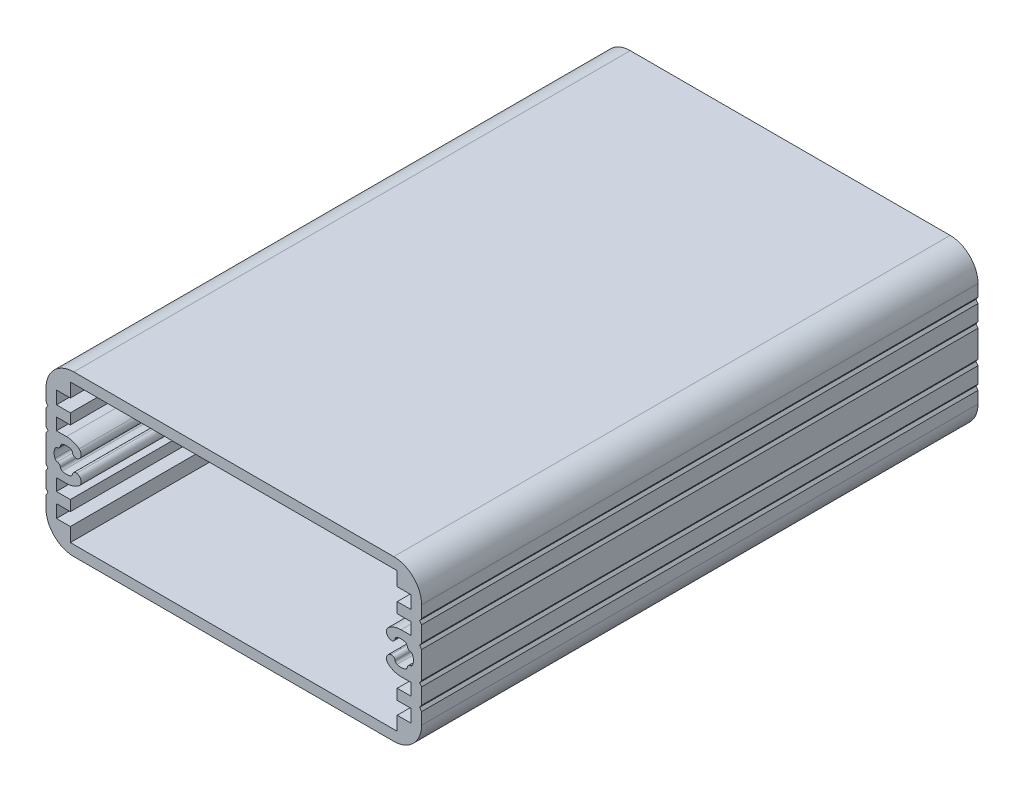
ISO-10303-21;
HEADER;
FILE_DESCRIPTION(('STEP AP214'),'2;1');
FILE_NAME('part.step','',(''),(''),'','','');
FILE_SCHEMA(('AUTOMOTIVE_DESIGN { 1 0 10303 214 1 1 1 1 }'));
ENDSEC;
DATA;
#1=APPLICATION_CONTEXT('core data for automotive mechanical design processes');
#2=APPLICATION_PROTOCOL_DEFINITION('international standard','automotive_design',2000,#1);
#3=PRODUCT_CONTEXT('',#1,'mechanical');
#4=PRODUCT('Part','Part','',(#3));
#5=PRODUCT_RELATED_PRODUCT_CATEGORY('part','',(#4));
#6=PRODUCT_DEFINITION_FORMATION('','',#4);
#7=PRODUCT_DEFINITION_CONTEXT('part definition',#1,'design');
#8=PRODUCT_DEFINITION('design','',#6,#7);
#9=PRODUCT_DEFINITION_SHAPE('','',#8);
#10=(LENGTH_UNIT() NAMED_UNIT(*) SI_UNIT(.MILLI.,.METRE.));
#11=(NAMED_UNIT(*) PLANE_ANGLE_UNIT() SI_UNIT($,.RADIAN.));
#12=(NAMED_UNIT(*) SI_UNIT($,.STERADIAN.) SOLID_ANGLE_UNIT());
#13=UNCERTAINTY_MEASURE_WITH_UNIT(LENGTH_MEASURE(1.E-05),#10,'distance_accuracy_value','');
#14=(GEOMETRIC_REPRESENTATION_CONTEXT(3) GLOBAL_UNCERTAINTY_ASSIGNED_CONTEXT((#13)) GLOBAL_UNIT_ASSIGNED_CONTEXT((#10,
#11,#12)) REPRESENTATION_CONTEXT('',''));
#15=CARTESIAN_POINT('',(0.,0.,0.));
#16=DIRECTION('',(0.,0.,1.));
#17=DIRECTION('',(1.,0.,0.));
#18=AXIS2_PLACEMENT_3D('',#15,#16,#17);
#19=CARTESIAN_POINT('',(26.7206,5.40400000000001,-40.));
#20=DIRECTION('',(0.815507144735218,-0.578747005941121,0.));
#21=DIRECTION('',(0.578747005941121,0.815507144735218,0.));
#22=AXIS2_PLACEMENT_3D('',#19,#20,#21);
#23=PLANE('',#22);
#24=DIRECTION('',(0.578747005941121,0.815507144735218,0.));
#25=VECTOR('',#24,1.);
#26=CARTESIAN_POINT('',(26.7206,5.40400000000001,40.));
#27=LINE('',#26,#25);
#28=CARTESIAN_POINT('',(26.7206,5.40400000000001,40.));
#29=VERTEX_POINT('',#28);
#30=CARTESIAN_POINT('',(27.,5.7977,40.));
#31=VERTEX_POINT('',#30);
#32=EDGE_CURVE('E1083',#29,#31,#27,.T.);
#33=ORIENTED_EDGE('',*,*,#32,.F.);
#34=DIRECTION('',(0.,0.,1.));
#35=VECTOR('',#34,1.);
#36=CARTESIAN_POINT('',(26.7206,5.40400000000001,-40.));
#37=LINE('',#36,#35);
#38=CARTESIAN_POINT('',(26.7206,5.40400000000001,-40.));
#39=VERTEX_POINT('',#38);
#40=EDGE_CURVE('E13',#39,#29,#37,.T.);
#41=ORIENTED_EDGE('',*,*,#40,.F.);
#42=DIRECTION('',(0.578747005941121,0.815507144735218,0.));
#43=VECTOR('',#42,1.);
#44=CARTESIAN_POINT('',(26.7206,5.40400000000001,-40.));
#45=LINE('',#44,#43);
#46=CARTESIAN_POINT('',(27.,5.7977,-40.));
#47=VERTEX_POINT('',#46);
#48=EDGE_CURVE('E1268',#39,#47,#45,.T.);
#49=ORIENTED_EDGE('',*,*,#48,.T.);
#50=DIRECTION('',(0.,0.,1.));
#51=VECTOR('',#50,1.);
#52=CARTESIAN_POINT('',(27.,5.7977,-40.));
#53=LINE('',#52,#51);
#54=EDGE_CURVE('E49',#47,#31,#53,.T.);
#55=ORIENTED_EDGE('',*,*,#54,.T.);
#56=EDGE_LOOP('',(#33,#41,#49,#55));
#57=FACE_BOUND('',#56,.T.);
#58=ADVANCED_FACE('F46',(#57),#23,.T.);
#59=CARTESIAN_POINT('',(27.,5.01030000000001,-40.));
#60=DIRECTION('',(0.815507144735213,0.578747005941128,0.));
#61=DIRECTION('',(-0.578747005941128,0.815507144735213,0.));
#62=AXIS2_PLACEMENT_3D('',#59,#60,#61);
#63=PLANE('',#62);
#64=DIRECTION('',(-0.578747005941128,0.815507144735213,0.));
#65=VECTOR('',#64,1.);
#66=CARTESIAN_POINT('',(27.,5.01030000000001,40.));
#67=LINE('',#66,#65);
#68=CARTESIAN_POINT('',(27.,5.01030000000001,40.));
#69=VERTEX_POINT('',#68);
#70=EDGE_CURVE('E1272',#69,#29,#67,.T.);
#71=ORIENTED_EDGE('',*,*,#70,.F.);
#72=DIRECTION('',(0.,0.,1.));
#73=VECTOR('',#72,1.);
#74=CARTESIAN_POINT('',(27.,5.01030000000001,-40.));
#75=LINE('',#74,#73);
#76=CARTESIAN_POINT('',(27.,5.01030000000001,-40.));
#77=VERTEX_POINT('',#76);
#78=EDGE_CURVE('E55',#77,#69,#75,.T.);
#79=ORIENTED_EDGE('',*,*,#78,.F.);
#80=DIRECTION('',(-0.578747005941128,0.815507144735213,0.));
#81=VECTOR('',#80,1.);
#82=CARTESIAN_POINT('',(27.,5.01030000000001,-40.));
#83=LINE('',#82,#81);
#84=EDGE_CURVE('E1362',#77,#39,#83,.T.);
#85=ORIENTED_EDGE('',*,*,#84,.T.);
#86=ORIENTED_EDGE('',*,*,#40,.T.);
#87=EDGE_LOOP('',(#71,#79,#85,#86));
#88=FACE_BOUND('',#87,.T.);
#89=ADVANCED_FACE('F1551',(#88),#63,.T.);
#90=CARTESIAN_POINT('',(27.,2.7243,-40.));
#91=DIRECTION('',(1.,0.,0.));
#92=DIRECTION('',(0.,0.,-1.));
#93=AXIS2_PLACEMENT_3D('',#90,#91,#92);
#94=PLANE('',#93);
#95=DIRECTION('',(0.,1.,0.));
#96=VECTOR('',#95,1.);
#97=CARTESIAN_POINT('',(27.,2.7243,40.));
#98=LINE('',#97,#96);
#99=CARTESIAN_POINT('',(27.,2.7243,40.));
#100=VERTEX_POINT('',#99);
#101=EDGE_CURVE('E1454',#100,#69,#98,.T.);
#102=ORIENTED_EDGE('',*,*,#101,.F.);
#103=DIRECTION('',(0.,0.,1.));
#104=VECTOR('',#103,1.);
#105=CARTESIAN_POINT('',(27.,2.7243,-40.));
#106=LINE('',#105,#104);
#107=CARTESIAN_POINT('',(27.,2.7243,-40.));
#108=VERTEX_POINT('',#107);
#109=EDGE_CURVE('E1461',#108,#100,#106,.T.);
#110=ORIENTED_EDGE('',*,*,#109,.F.);
#111=DIRECTION('',(0.,1.,0.));
#112=VECTOR('',#111,1.);
#113=CARTESIAN_POINT('',(27.,2.7243,-40.));
#114=LINE('',#113,#112);
#115=EDGE_CURVE('E1359',#108,#77,#114,.T.);
#116=ORIENTED_EDGE('',*,*,#115,.T.);
#117=ORIENTED_EDGE('',*,*,#78,.T.);
#118=EDGE_LOOP('',(#102,#110,#116,#117));
#119=FACE_BOUND('',#118,.T.);
#120=ADVANCED_FACE('F1666',(#119),#94,.T.);
#121=CARTESIAN_POINT('',(26.7206,2.3306,-40.));
#122=DIRECTION('',(0.815507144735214,-0.578747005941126,0.));
#123=DIRECTION('',(0.578747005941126,0.815507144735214,0.));
#124=AXIS2_PLACEMENT_3D('',#121,#122,#123);
#125=PLANE('',#124);
#126=DIRECTION('',(0.578747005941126,0.815507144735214,0.));
#127=VECTOR('',#126,1.);
#128=CARTESIAN_POINT('',(26.7206,2.3306,40.));
#129=LINE('',#128,#127);
#130=CARTESIAN_POINT('',(26.7206,2.3306,40.));
#131=VERTEX_POINT('',#130);
#132=EDGE_CURVE('E1451',#131,#100,#129,.T.);
#133=ORIENTED_EDGE('',*,*,#132,.F.);
#134=DIRECTION('',(0.,0.,1.));
#135=VECTOR('',#134,1.);
#136=CARTESIAN_POINT('',(26.7206,2.3306,-40.));
#137=LINE('',#136,#135);
#138=CARTESIAN_POINT('',(26.7206,2.3306,-40.));
#139=VERTEX_POINT('',#138);
#140=EDGE_CURVE('E1464',#139,#131,#137,.T.);
#141=ORIENTED_EDGE('',*,*,#140,.F.);
#142=DIRECTION('',(0.578747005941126,0.815507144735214,0.));
#143=VECTOR('',#142,1.);
#144=CARTESIAN_POINT('',(26.7206,2.3306,-40.));
#145=LINE('',#144,#143);
#146=EDGE_CURVE('E1356',#139,#108,#145,.T.);
#147=ORIENTED_EDGE('',*,*,#146,.T.);
#148=ORIENTED_EDGE('',*,*,#109,.T.);
#149=EDGE_LOOP('',(#133,#141,#147,#148));
#150=FACE_BOUND('',#149,.T.);
#151=ADVANCED_FACE('F1664',(#150),#125,.T.);
#152=CARTESIAN_POINT('',(27.,1.93690000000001,-40.));
#153=DIRECTION('',(0.815507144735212,0.57874700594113,0.));
#154=DIRECTION('',(-0.57874700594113,0.815507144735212,0.));
#155=AXIS2_PLACEMENT_3D('',#152,#153,#154);
#156=PLANE('',#155);
#157=DIRECTION('',(-0.57874700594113,0.815507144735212,0.));
#158=VECTOR('',#157,1.);
#159=CARTESIAN_POINT('',(27.,1.93690000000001,40.));
#160=LINE('',#159,#158);
#161=CARTESIAN_POINT('',(27.,1.93690000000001,40.));
#162=VERTEX_POINT('',#161);
#163=EDGE_CURVE('E1448',#162,#131,#160,.T.);
#164=ORIENTED_EDGE('',*,*,#163,.F.);
#165=DIRECTION('',(0.,0.,1.));
#166=VECTOR('',#165,1.);
#167=CARTESIAN_POINT('',(27.,1.93690000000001,-40.));
#168=LINE('',#167,#166);
#169=CARTESIAN_POINT('',(27.,1.93690000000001,-40.));
#170=VERTEX_POINT('',#169);
#171=EDGE_CURVE('E1467',#170,#162,#168,.T.);
#172=ORIENTED_EDGE('',*,*,#171,.F.);
#173=DIRECTION('',(-0.57874700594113,0.815507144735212,0.));
#174=VECTOR('',#173,1.);
#175=CARTESIAN_POINT('',(27.,1.93690000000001,-40.));
#176=LINE('',#175,#174);
#177=EDGE_CURVE('E1353',#170,#139,#176,.T.);
#178=ORIENTED_EDGE('',*,*,#177,.T.);
#179=ORIENTED_EDGE('',*,*,#140,.T.);
#180=EDGE_LOOP('',(#164,#172,#178,#179));
#181=FACE_BOUND('',#180,.T.);
#182=ADVANCED_FACE('F1660',(#181),#156,.T.);
#183=CARTESIAN_POINT('',(27.,-1.93690000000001,-40.));
#184=DIRECTION('',(1.,0.,0.));
#185=DIRECTION('',(0.,0.,-1.));
#186=AXIS2_PLACEMENT_3D('',#183,#184,#185);
#187=PLANE('',#186);
#188=DIRECTION('',(0.,1.,0.));
#189=VECTOR('',#188,1.);
#190=CARTESIAN_POINT('',(27.,-1.93690000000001,40.));
#191=LINE('',#190,#189);
#192=CARTESIAN_POINT('',(27.,-1.93690000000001,40.));
#193=VERTEX_POINT('',#192);
#194=EDGE_CURVE('E1445',#193,#162,#191,.T.);
#195=ORIENTED_EDGE('',*,*,#194,.F.);
#196=DIRECTION('',(0.,0.,1.));
#197=VECTOR('',#196,1.);
#198=CARTESIAN_POINT('',(27.,-1.93690000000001,-40.));
#199=LINE('',#198,#197);
#200=CARTESIAN_POINT('',(27.,-1.93690000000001,-40.));
#201=VERTEX_POINT('',#200);
#202=EDGE_CURVE('E1470',#201,#193,#199,.T.);
#203=ORIENTED_EDGE('',*,*,#202,.F.);
#204=DIRECTION('',(0.,1.,0.));
#205=VECTOR('',#204,1.);
#206=CARTESIAN_POINT('',(27.,-1.93690000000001,-40.));
#207=LINE('',#206,#205);
#208=EDGE_CURVE('E1350',#201,#170,#207,.T.);
#209=ORIENTED_EDGE('',*,*,#208,.T.);
#210=ORIENTED_EDGE('',*,*,#171,.T.);
#211=EDGE_LOOP('',(#195,#203,#209,#210));
#212=FACE_BOUND('',#211,.T.);
#213=ADVANCED_FACE('F1656',(#212),#187,.T.);
#214=CARTESIAN_POINT('',(26.7206,-2.3306,-40.));
#215=DIRECTION('',(0.815507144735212,-0.57874700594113,0.));
#216=DIRECTION('',(0.57874700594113,0.815507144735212,0.));
#217=AXIS2_PLACEMENT_3D('',#214,#215,#216);
#218=PLANE('',#217);
#219=DIRECTION('',(0.57874700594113,0.815507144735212,0.));
#220=VECTOR('',#219,1.);
#221=CARTESIAN_POINT('',(26.7206,-2.3306,40.));
#222=LINE('',#221,#220);
#223=CARTESIAN_POINT('',(26.7206,-2.3306,40.));
#224=VERTEX_POINT('',#223);
#225=EDGE_CURVE('E1442',#224,#193,#222,.T.);
#226=ORIENTED_EDGE('',*,*,#225,.F.);
#227=DIRECTION('',(0.,0.,1.));
#228=VECTOR('',#227,1.);
#229=CARTESIAN_POINT('',(26.7206,-2.3306,-40.));
#230=LINE('',#229,#228);
#231=CARTESIAN_POINT('',(26.7206,-2.3306,-40.));
#232=VERTEX_POINT('',#231);
#233=EDGE_CURVE('E1473',#232,#224,#230,.T.);
#234=ORIENTED_EDGE('',*,*,#233,.F.);
#235=DIRECTION('',(0.57874700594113,0.815507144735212,0.));
#236=VECTOR('',#235,1.);
#237=CARTESIAN_POINT('',(26.7206,-2.3306,-40.));
#238=LINE('',#237,#236);
#239=EDGE_CURVE('E1347',#232,#201,#238,.T.);
#240=ORIENTED_EDGE('',*,*,#239,.T.);
#241=ORIENTED_EDGE('',*,*,#202,.T.);
#242=EDGE_LOOP('',(#226,#234,#240,#241));
#243=FACE_BOUND('',#242,.T.);
#244=ADVANCED_FACE('F1652',(#243),#218,.T.);
#245=CARTESIAN_POINT('',(27.,-2.7243,-40.));
#246=DIRECTION('',(0.815507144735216,0.578747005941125,0.));
#247=DIRECTION('',(-0.578747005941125,0.815507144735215,0.));
#248=AXIS2_PLACEMENT_3D('',#245,#246,#247);
#249=PLANE('',#248);
#250=DIRECTION('',(-0.578747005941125,0.815507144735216,0.));
#251=VECTOR('',#250,1.);
#252=CARTESIAN_POINT('',(27.,-2.7243,40.));
#253=LINE('',#252,#251);
#254=CARTESIAN_POINT('',(27.,-2.7243,40.));
#255=VERTEX_POINT('',#254);
#256=EDGE_CURVE('E1439',#255,#224,#253,.T.);
#257=ORIENTED_EDGE('',*,*,#256,.F.);
#258=DIRECTION('',(0.,0.,1.));
#259=VECTOR('',#258,1.);
#260=CARTESIAN_POINT('',(27.,-2.7243,-40.));
#261=LINE('',#260,#259);
#262=CARTESIAN_POINT('',(27.,-2.7243,-40.));
#263=VERTEX_POINT('',#262);
#264=EDGE_CURVE('E1476',#263,#255,#261,.T.);
#265=ORIENTED_EDGE('',*,*,#264,.F.);
#266=DIRECTION('',(-0.578747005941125,0.815507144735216,0.));
#267=VECTOR('',#266,1.);
#268=CARTESIAN_POINT('',(27.,-2.7243,-40.));
#269=LINE('',#268,#267);
#270=EDGE_CURVE('E1344',#263,#232,#269,.T.);
#271=ORIENTED_EDGE('',*,*,#270,.T.);
#272=ORIENTED_EDGE('',*,*,#233,.T.);
#273=EDGE_LOOP('',(#257,#265,#271,#272));
#274=FACE_BOUND('',#273,.T.);
#275=ADVANCED_FACE('F1648',(#274),#249,.T.);
#276=CARTESIAN_POINT('',(27.,-5.01030000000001,-40.));
#277=DIRECTION('',(1.,0.,0.));
#278=DIRECTION('',(0.,1.,0.));
#279=AXIS2_PLACEMENT_3D('',#276,#277,#278);
#280=PLANE('',#279);
#281=DIRECTION('',(0.,1.,0.));
#282=VECTOR('',#281,1.);
#283=CARTESIAN_POINT('',(27.,-5.01030000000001,40.));
#284=LINE('',#283,#282);
#285=CARTESIAN_POINT('',(27.,-5.01030000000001,40.));
#286=VERTEX_POINT('',#285);
#287=EDGE_CURVE('E1436',#286,#255,#284,.T.);
#288=ORIENTED_EDGE('',*,*,#287,.F.);
#289=DIRECTION('',(0.,0.,1.));
#290=VECTOR('',#289,1.);
#291=CARTESIAN_POINT('',(27.,-5.01030000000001,-40.));
#292=LINE('',#291,#290);
#293=CARTESIAN_POINT('',(27.,-5.01030000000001,-40.));
#294=VERTEX_POINT('',#293);
#295=EDGE_CURVE('E1479',#294,#286,#292,.T.);
#296=ORIENTED_EDGE('',*,*,#295,.F.);
#297=DIRECTION('',(0.,1.,0.));
#298=VECTOR('',#297,1.);
#299=CARTESIAN_POINT('',(27.,-5.01030000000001,-40.));
#300=LINE('',#299,#298);
#301=EDGE_CURVE('E1341',#294,#263,#300,.T.);
#302=ORIENTED_EDGE('',*,*,#301,.T.);
#303=ORIENTED_EDGE('',*,*,#264,.T.);
#304=EDGE_LOOP('',(#288,#296,#302,#303));
#305=FACE_BOUND('',#304,.T.);
#306=ADVANCED_FACE('F1644',(#305),#280,.T.);
#307=CARTESIAN_POINT('',(26.7206,-5.40400000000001,-40.));
#308=DIRECTION('',(0.81550714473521,-0.578747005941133,0.));
#309=DIRECTION('',(0.578747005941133,0.81550714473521,0.));
#310=AXIS2_PLACEMENT_3D('',#307,#308,#309);
#311=PLANE('',#310);
#312=DIRECTION('',(0.578747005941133,0.81550714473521,0.));
#313=VECTOR('',#312,1.);
#314=CARTESIAN_POINT('',(26.7206,-5.40400000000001,40.));
#315=LINE('',#314,#313);
#316=CARTESIAN_POINT('',(26.7206,-5.40400000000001,40.));
#317=VERTEX_POINT('',#316);
#318=EDGE_CURVE('E1433',#317,#286,#315,.T.);
#319=ORIENTED_EDGE('',*,*,#318,.F.);
#320=DIRECTION('',(0.,0.,1.));
#321=VECTOR('',#320,1.);
#322=CARTESIAN_POINT('',(26.7206,-5.40400000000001,-40.));
#323=LINE('',#322,#321);
#324=CARTESIAN_POINT('',(26.7206,-5.40400000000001,-40.));
#325=VERTEX_POINT('',#324);
#326=EDGE_CURVE('E1482',#325,#317,#323,.T.);
#327=ORIENTED_EDGE('',*,*,#326,.F.);
#328=DIRECTION('',(0.578747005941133,0.81550714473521,0.));
#329=VECTOR('',#328,1.);
#330=CARTESIAN_POINT('',(26.7206,-5.40400000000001,-40.));
#331=LINE('',#330,#329);
#332=EDGE_CURVE('E1338',#325,#294,#331,.T.);
#333=ORIENTED_EDGE('',*,*,#332,.T.);
#334=ORIENTED_EDGE('',*,*,#295,.T.);
#335=EDGE_LOOP('',(#319,#327,#333,#334));
#336=FACE_BOUND('',#335,.T.);
#337=ADVANCED_FACE('F1640',(#336),#311,.T.);
#338=CARTESIAN_POINT('',(27.,-5.7977,-40.));
#339=DIRECTION('',(0.815507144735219,0.57874700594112,0.));
#340=DIRECTION('',(-0.57874700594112,0.815507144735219,0.));
#341=AXIS2_PLACEMENT_3D('',#338,#339,#340);
#342=PLANE('',#341);
#343=DIRECTION('',(-0.578747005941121,0.815507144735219,0.));
#344=VECTOR('',#343,1.);
#345=CARTESIAN_POINT('',(27.,-5.7977,40.));
#346=LINE('',#345,#344);
#347=CARTESIAN_POINT('',(27.,-5.7977,40.));
#348=VERTEX_POINT('',#347);
#349=EDGE_CURVE('E1430',#348,#317,#346,.T.);
#350=ORIENTED_EDGE('',*,*,#349,.F.);
#351=DIRECTION('',(0.,0.,1.));
#352=VECTOR('',#351,1.);
#353=CARTESIAN_POINT('',(27.,-5.7977,-40.));
#354=LINE('',#353,#352);
#355=CARTESIAN_POINT('',(27.,-5.7977,-40.));
#356=VERTEX_POINT('',#355);
#357=EDGE_CURVE('E1485',#356,#348,#354,.T.);
#358=ORIENTED_EDGE('',*,*,#357,.F.);
#359=DIRECTION('',(-0.578747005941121,0.815507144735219,0.));
#360=VECTOR('',#359,1.);
#361=CARTESIAN_POINT('',(27.,-5.7977,-40.));
#362=LINE('',#361,#360);
#363=EDGE_CURVE('E1335',#356,#325,#362,.T.);
#364=ORIENTED_EDGE('',*,*,#363,.T.);
#365=ORIENTED_EDGE('',*,*,#326,.T.);
#366=EDGE_LOOP('',(#350,#358,#364,#365));
#367=FACE_BOUND('',#366,.T.);
#368=ADVANCED_FACE('F1636',(#367),#342,.T.);
#369=CARTESIAN_POINT('',(27.,-7.49999999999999,-40.));
#370=DIRECTION('',(1.,0.,0.));
#371=DIRECTION('',(0.,1.,0.));
#372=AXIS2_PLACEMENT_3D('',#369,#370,#371);
#373=PLANE('',#372);
#374=DIRECTION('',(0.,1.,0.));
#375=VECTOR('',#374,1.);
#376=CARTESIAN_POINT('',(27.,-7.49999999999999,40.));
#377=LINE('',#376,#375);
#378=CARTESIAN_POINT('',(27.,-7.49999999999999,40.));
#379=VERTEX_POINT('',#378);
#380=EDGE_CURVE('E1427',#379,#348,#377,.T.);
#381=ORIENTED_EDGE('',*,*,#380,.F.);
#382=DIRECTION('',(0.,0.,1.));
#383=VECTOR('',#382,1.);
#384=CARTESIAN_POINT('',(27.,-7.49999999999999,-40.));
#385=LINE('',#384,#383);
#386=CARTESIAN_POINT('',(27.,-7.49999999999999,-40.));
#387=VERTEX_POINT('',#386);
#388=EDGE_CURVE('E1488',#387,#379,#385,.T.);
#389=ORIENTED_EDGE('',*,*,#388,.F.);
#390=DIRECTION('',(0.,1.,0.));
#391=VECTOR('',#390,1.);
#392=CARTESIAN_POINT('',(27.,-7.49999999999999,-40.));
#393=LINE('',#392,#391);
#394=EDGE_CURVE('E1332',#387,#356,#393,.T.);
#395=ORIENTED_EDGE('',*,*,#394,.T.);
#396=ORIENTED_EDGE('',*,*,#357,.T.);
#397=EDGE_LOOP('',(#381,#389,#395,#396));
#398=FACE_BOUND('',#397,.T.);
#399=ADVANCED_FACE('F1632',(#398),#373,.T.);
#400=CARTESIAN_POINT('',(23.,-7.49999999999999,-40.));
#401=DIRECTION('',(0.,0.,1.));
#402=DIRECTION('',(1.,0.,0.));
#403=AXIS2_PLACEMENT_3D('',#400,#401,#402);
#404=CYLINDRICAL_SURFACE('',#403,4.);
#405=CARTESIAN_POINT('',(23.,-7.49999999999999,40.));
#406=DIRECTION('',(0.,0.,1.));
#407=DIRECTION('',(1.,0.,0.));
#408=AXIS2_PLACEMENT_3D('',#405,#406,#407);
#409=CIRCLE('',#408,4.);
#410=CARTESIAN_POINT('',(23.,-11.5,40.));
#411=VERTEX_POINT('',#410);
#412=EDGE_CURVE('E1424',#411,#379,#409,.T.);
#413=ORIENTED_EDGE('',*,*,#412,.F.);
#414=DIRECTION('',(0.,0.,1.));
#415=VECTOR('',#414,1.);
#416=CARTESIAN_POINT('',(23.,-11.5,-40.));
#417=LINE('',#416,#415);
#418=CARTESIAN_POINT('',(23.,-11.5,-40.));
#419=VERTEX_POINT('',#418);
#420=EDGE_CURVE('E1491',#419,#411,#417,.T.);
#421=ORIENTED_EDGE('',*,*,#420,.F.);
#422=CARTESIAN_POINT('',(23.,-7.49999999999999,-40.));
#423=DIRECTION('',(0.,0.,1.));
#424=DIRECTION('',(1.,0.,0.));
#425=AXIS2_PLACEMENT_3D('',#422,#423,#424);
#426=CIRCLE('',#425,4.);
#427=EDGE_CURVE('E1329',#419,#387,#426,.T.);
#428=ORIENTED_EDGE('',*,*,#427,.T.);
#429=ORIENTED_EDGE('',*,*,#388,.T.);
#430=EDGE_LOOP('',(#413,#421,#428,#429));
#431=FACE_BOUND('',#430,.T.);
#432=ADVANCED_FACE('F1628',(#431),#404,.T.);
#433=CARTESIAN_POINT('',(-23.,-11.5,-40.));
#434=DIRECTION('',(0.,-1.,0.));
#435=DIRECTION('',(1.,0.,0.));
#436=AXIS2_PLACEMENT_3D('',#433,#434,#435);
#437=PLANE('',#436);
#438=DIRECTION('',(1.,0.,0.));
#439=VECTOR('',#438,1.);
#440=CARTESIAN_POINT('',(-23.,-11.5,40.));
#441=LINE('',#440,#439);
#442=CARTESIAN_POINT('',(-23.,-11.5,40.));
#443=VERTEX_POINT('',#442);
#444=EDGE_CURVE('E1421',#443,#411,#441,.T.);
#445=ORIENTED_EDGE('',*,*,#444,.F.);
#446=DIRECTION('',(0.,0.,1.));
#447=VECTOR('',#446,1.);
#448=CARTESIAN_POINT('',(-23.,-11.5,-40.));
#449=LINE('',#448,#447);
#450=CARTESIAN_POINT('',(-23.,-11.5,-40.));
#451=VERTEX_POINT('',#450);
#452=EDGE_CURVE('E1494',#451,#443,#449,.T.);
#453=ORIENTED_EDGE('',*,*,#452,.F.);
#454=DIRECTION('',(1.,0.,0.));
#455=VECTOR('',#454,1.);
#456=CARTESIAN_POINT('',(-23.,-11.5,-40.));
#457=LINE('',#456,#455);
#458=EDGE_CURVE('E1326',#451,#419,#457,.T.);
#459=ORIENTED_EDGE('',*,*,#458,.T.);
#460=ORIENTED_EDGE('',*,*,#420,.T.);
#461=EDGE_LOOP('',(#445,#453,#459,#460));
#462=FACE_BOUND('',#461,.T.);
#463=ADVANCED_FACE('F1624',(#462),#437,.T.);
#464=CARTESIAN_POINT('',(-23.,-7.50000000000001,-40.));
#465=DIRECTION('',(0.,0.,1.));
#466=DIRECTION('',(1.,0.,0.));
#467=AXIS2_PLACEMENT_3D('',#464,#465,#466);
#468=CYLINDRICAL_SURFACE('',#467,4.);
#469=CARTESIAN_POINT('',(-23.,-7.50000000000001,40.));
#470=DIRECTION('',(0.,0.,1.));
#471=DIRECTION('',(1.,0.,0.));
#472=AXIS2_PLACEMENT_3D('',#469,#470,#471);
#473=CIRCLE('',#472,4.);
#474=CARTESIAN_POINT('',(-27.,-7.50000000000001,40.));
#475=VERTEX_POINT('',#474);
#476=EDGE_CURVE('E1418',#475,#443,#473,.T.);
#477=ORIENTED_EDGE('',*,*,#476,.F.);
#478=DIRECTION('',(0.,0.,1.));
#479=VECTOR('',#478,1.);
#480=CARTESIAN_POINT('',(-27.,-7.50000000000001,-40.));
#481=LINE('',#480,#479);
#482=CARTESIAN_POINT('',(-27.,-7.50000000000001,-40.));
#483=VERTEX_POINT('',#482);
#484=EDGE_CURVE('E1496',#483,#475,#481,.T.);
#485=ORIENTED_EDGE('',*,*,#484,.F.);
#486=CARTESIAN_POINT('',(-23.,-7.50000000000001,-40.));
#487=DIRECTION('',(0.,0.,1.));
#488=DIRECTION('',(1.,0.,0.));
#489=AXIS2_PLACEMENT_3D('',#486,#487,#488);
#490=CIRCLE('',#489,4.);
#491=EDGE_CURVE('E1323',#483,#451,#490,.T.);
#492=ORIENTED_EDGE('',*,*,#491,.T.);
#493=ORIENTED_EDGE('',*,*,#452,.T.);
#494=EDGE_LOOP('',(#477,#485,#492,#493));
#495=FACE_BOUND('',#494,.T.);
#496=ADVANCED_FACE('F1620',(#495),#468,.T.);
#497=CARTESIAN_POINT('',(-27.,-5.7977,-40.));
#498=DIRECTION('',(-1.,0.,0.));
#499=DIRECTION('',(0.,-1.,0.));
#500=AXIS2_PLACEMENT_3D('',#497,#498,#499);
#501=PLANE('',#500);
#502=DIRECTION('',(0.,-1.,0.));
#503=VECTOR('',#502,1.);
#504=CARTESIAN_POINT('',(-27.,-5.7977,40.));
#505=LINE('',#504,#503);
#506=CARTESIAN_POINT('',(-27.,-5.7977,40.));
#507=VERTEX_POINT('',#506);
#508=EDGE_CURVE('E1415',#507,#475,#505,.T.);
#509=ORIENTED_EDGE('',*,*,#508,.F.);
#510=DIRECTION('',(0.,0.,1.));
#511=VECTOR('',#510,1.);
#512=CARTESIAN_POINT('',(-27.,-5.7977,-40.));
#513=LINE('',#512,#511);
#514=CARTESIAN_POINT('',(-27.,-5.7977,-40.));
#515=VERTEX_POINT('',#514);
#516=EDGE_CURVE('E1498',#515,#507,#513,.T.);
#517=ORIENTED_EDGE('',*,*,#516,.F.);
#518=DIRECTION('',(0.,-1.,0.));
#519=VECTOR('',#518,1.);
#520=CARTESIAN_POINT('',(-27.,-5.7977,-40.));
#521=LINE('',#520,#519);
#522=EDGE_CURVE('E1320',#515,#483,#521,.T.);
#523=ORIENTED_EDGE('',*,*,#522,.T.);
#524=ORIENTED_EDGE('',*,*,#484,.T.);
#525=EDGE_LOOP('',(#509,#517,#523,#524));
#526=FACE_BOUND('',#525,.T.);
#527=ADVANCED_FACE('F1616',(#526),#501,.T.);
#528=CARTESIAN_POINT('',(-26.7206,-5.40400000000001,-40.));
#529=DIRECTION('',(-0.815507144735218,0.578747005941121,0.));
#530=DIRECTION('',(-0.578747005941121,-0.815507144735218,0.));
#531=AXIS2_PLACEMENT_3D('',#528,#529,#530);
#532=PLANE('',#531);
#533=DIRECTION('',(-0.578747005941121,-0.815507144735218,0.));
#534=VECTOR('',#533,1.);
#535=CARTESIAN_POINT('',(-26.7206,-5.40400000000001,40.));
#536=LINE('',#535,#534);
#537=CARTESIAN_POINT('',(-26.7206,-5.40400000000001,40.));
#538=VERTEX_POINT('',#537);
#539=EDGE_CURVE('E1412',#538,#507,#536,.T.);
#540=ORIENTED_EDGE('',*,*,#539,.F.);
#541=DIRECTION('',(0.,0.,1.));
#542=VECTOR('',#541,1.);
#543=CARTESIAN_POINT('',(-26.7206,-5.40400000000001,-40.));
#544=LINE('',#543,#542);
#545=CARTESIAN_POINT('',(-26.7206,-5.40400000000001,-40.));
#546=VERTEX_POINT('',#545);
#547=EDGE_CURVE('E1500',#546,#538,#544,.T.);
#548=ORIENTED_EDGE('',*,*,#547,.F.);
#549=DIRECTION('',(-0.578747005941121,-0.815507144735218,0.));
#550=VECTOR('',#549,1.);
#551=CARTESIAN_POINT('',(-26.7206,-5.40400000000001,-40.));
#552=LINE('',#551,#550);
#553=EDGE_CURVE('E1317',#546,#515,#552,.T.);
#554=ORIENTED_EDGE('',*,*,#553,.T.);
#555=ORIENTED_EDGE('',*,*,#516,.T.);
#556=EDGE_LOOP('',(#540,#548,#554,#555));
#557=FACE_BOUND('',#556,.T.);
#558=ADVANCED_FACE('F1612',(#557),#532,.T.);
#559=CARTESIAN_POINT('',(-27.,-5.01030000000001,-40.));
#560=DIRECTION('',(-0.815507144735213,-0.578747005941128,0.));
#561=DIRECTION('',(0.578747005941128,-0.815507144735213,0.));
#562=AXIS2_PLACEMENT_3D('',#559,#560,#561);
#563=PLANE('',#562);
#564=DIRECTION('',(0.578747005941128,-0.815507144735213,0.));
#565=VECTOR('',#564,1.);
#566=CARTESIAN_POINT('',(-27.,-5.01030000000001,40.));
#567=LINE('',#566,#565);
#568=CARTESIAN_POINT('',(-27.,-5.01030000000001,40.));
#569=VERTEX_POINT('',#568);
#570=EDGE_CURVE('E1409',#569,#538,#567,.T.);
#571=ORIENTED_EDGE('',*,*,#570,.F.);
#572=DIRECTION('',(0.,0.,1.));
#573=VECTOR('',#572,1.);
#574=CARTESIAN_POINT('',(-27.,-5.01030000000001,-40.));
#575=LINE('',#574,#573);
#576=CARTESIAN_POINT('',(-27.,-5.01030000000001,-40.));
#577=VERTEX_POINT('',#576);
#578=EDGE_CURVE('E1502',#577,#569,#575,.T.);
#579=ORIENTED_EDGE('',*,*,#578,.F.);
#580=DIRECTION('',(0.578747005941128,-0.815507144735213,0.));
#581=VECTOR('',#580,1.);
#582=CARTESIAN_POINT('',(-27.,-5.01030000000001,-40.));
#583=LINE('',#582,#581);
#584=EDGE_CURVE('E1314',#577,#546,#583,.T.);
#585=ORIENTED_EDGE('',*,*,#584,.T.);
#586=ORIENTED_EDGE('',*,*,#547,.T.);
#587=EDGE_LOOP('',(#571,#579,#585,#586));
#588=FACE_BOUND('',#587,.T.);
#589=ADVANCED_FACE('F1608',(#588),#563,.T.);
#590=CARTESIAN_POINT('',(-27.,-2.7243,-40.));
#591=DIRECTION('',(-1.,0.,0.));
#592=DIRECTION('',(0.,0.,1.));
#593=AXIS2_PLACEMENT_3D('',#590,#591,#592);
#594=PLANE('',#593);
#595=DIRECTION('',(0.,-1.,0.));
#596=VECTOR('',#595,1.);
#597=CARTESIAN_POINT('',(-27.,-2.7243,40.));
#598=LINE('',#597,#596);
#599=CARTESIAN_POINT('',(-27.,-2.7243,40.));
#600=VERTEX_POINT('',#599);
#601=EDGE_CURVE('E1406',#600,#569,#598,.T.);
#602=ORIENTED_EDGE('',*,*,#601,.F.);
#603=DIRECTION('',(0.,0.,1.));
#604=VECTOR('',#603,1.);
#605=CARTESIAN_POINT('',(-27.,-2.7243,-40.));
#606=LINE('',#605,#604);
#607=CARTESIAN_POINT('',(-27.,-2.7243,-40.));
#608=VERTEX_POINT('',#607);
#609=EDGE_CURVE('E1505',#608,#600,#606,.T.);
#610=ORIENTED_EDGE('',*,*,#609,.F.);
#611=DIRECTION('',(0.,-1.,0.));
#612=VECTOR('',#611,1.);
#613=CARTESIAN_POINT('',(-27.,-2.7243,-40.));
#614=LINE('',#613,#612);
#615=EDGE_CURVE('E1311',#608,#577,#614,.T.);
#616=ORIENTED_EDGE('',*,*,#615,.T.);
#617=ORIENTED_EDGE('',*,*,#578,.T.);
#618=EDGE_LOOP('',(#602,#610,#616,#617));
#619=FACE_BOUND('',#618,.T.);
#620=ADVANCED_FACE('F1604',(#619),#594,.T.);
#621=CARTESIAN_POINT('',(-26.7206,-2.3306,-40.));
#622=DIRECTION('',(-0.815507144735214,0.578747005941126,0.));
#623=DIRECTION('',(-0.578747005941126,-0.815507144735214,0.));
#624=AXIS2_PLACEMENT_3D('',#621,#622,#623);
#625=PLANE('',#624);
#626=DIRECTION('',(-0.578747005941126,-0.815507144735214,0.));
#627=VECTOR('',#626,1.);
#628=CARTESIAN_POINT('',(-26.7206,-2.3306,40.));
#629=LINE('',#628,#627);
#630=CARTESIAN_POINT('',(-26.7206,-2.3306,40.));
#631=VERTEX_POINT('',#630);
#632=EDGE_CURVE('E1403',#631,#600,#629,.T.);
#633=ORIENTED_EDGE('',*,*,#632,.F.);
#634=DIRECTION('',(0.,0.,1.));
#635=VECTOR('',#634,1.);
#636=CARTESIAN_POINT('',(-26.7206,-2.3306,-40.));
#637=LINE('',#636,#635);
#638=CARTESIAN_POINT('',(-26.7206,-2.3306,-40.));
#639=VERTEX_POINT('',#638);
#640=EDGE_CURVE('E1508',#639,#631,#637,.T.);
#641=ORIENTED_EDGE('',*,*,#640,.F.);
#642=DIRECTION('',(-0.578747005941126,-0.815507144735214,0.));
#643=VECTOR('',#642,1.);
#644=CARTESIAN_POINT('',(-26.7206,-2.3306,-40.));
#645=LINE('',#644,#643);
#646=EDGE_CURVE('E1308',#639,#608,#645,.T.);
#647=ORIENTED_EDGE('',*,*,#646,.T.);
#648=ORIENTED_EDGE('',*,*,#609,.T.);
#649=EDGE_LOOP('',(#633,#641,#647,#648));
#650=FACE_BOUND('',#649,.T.);
#651=ADVANCED_FACE('F1600',(#650),#625,.T.);
#652=CARTESIAN_POINT('',(-27.,-1.93690000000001,-40.));
#653=DIRECTION('',(-0.815507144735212,-0.57874700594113,0.));
#654=DIRECTION('',(0.57874700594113,-0.815507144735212,0.));
#655=AXIS2_PLACEMENT_3D('',#652,#653,#654);
#656=PLANE('',#655);
#657=DIRECTION('',(0.57874700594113,-0.815507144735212,0.));
#658=VECTOR('',#657,1.);
#659=CARTESIAN_POINT('',(-27.,-1.93690000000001,40.));
#660=LINE('',#659,#658);
#661=CARTESIAN_POINT('',(-27.,-1.93690000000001,40.));
#662=VERTEX_POINT('',#661);
#663=EDGE_CURVE('E1400',#662,#631,#660,.T.);
#664=ORIENTED_EDGE('',*,*,#663,.F.);
#665=DIRECTION('',(0.,0.,1.));
#666=VECTOR('',#665,1.);
#667=CARTESIAN_POINT('',(-27.,-1.93690000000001,-40.));
#668=LINE('',#667,#666);
#669=CARTESIAN_POINT('',(-27.,-1.93690000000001,-40.));
#670=VERTEX_POINT('',#669);
#671=EDGE_CURVE('E1511',#670,#662,#668,.T.);
#672=ORIENTED_EDGE('',*,*,#671,.F.);
#673=DIRECTION('',(0.57874700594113,-0.815507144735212,0.));
#674=VECTOR('',#673,1.);
#675=CARTESIAN_POINT('',(-27.,-1.93690000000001,-40.));
#676=LINE('',#675,#674);
#677=EDGE_CURVE('E1305',#670,#639,#676,.T.);
#678=ORIENTED_EDGE('',*,*,#677,.T.);
#679=ORIENTED_EDGE('',*,*,#640,.T.);
#680=EDGE_LOOP('',(#664,#672,#678,#679));
#681=FACE_BOUND('',#680,.T.);
#682=ADVANCED_FACE('F1596',(#681),#656,.T.);
#683=CARTESIAN_POINT('',(-27.,1.93690000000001,-40.));
#684=DIRECTION('',(-1.,0.,0.));
#685=DIRECTION('',(0.,0.,1.));
#686=AXIS2_PLACEMENT_3D('',#683,#684,#685);
#687=PLANE('',#686);
#688=DIRECTION('',(0.,-1.,0.));
#689=VECTOR('',#688,1.);
#690=CARTESIAN_POINT('',(-27.,1.93690000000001,40.));
#691=LINE('',#690,#689);
#692=CARTESIAN_POINT('',(-27.,1.93690000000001,40.));
#693=VERTEX_POINT('',#692);
#694=EDGE_CURVE('E1397',#693,#662,#691,.T.);
#695=ORIENTED_EDGE('',*,*,#694,.F.);
#696=DIRECTION('',(0.,0.,1.));
#697=VECTOR('',#696,1.);
#698=CARTESIAN_POINT('',(-27.,1.93690000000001,-40.));
#699=LINE('',#698,#697);
#700=CARTESIAN_POINT('',(-27.,1.93690000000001,-40.));
#701=VERTEX_POINT('',#700);
#702=EDGE_CURVE('E1514',#701,#693,#699,.T.);
#703=ORIENTED_EDGE('',*,*,#702,.F.);
#704=DIRECTION('',(0.,-1.,0.));
#705=VECTOR('',#704,1.);
#706=CARTESIAN_POINT('',(-27.,1.93690000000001,-40.));
#707=LINE('',#706,#705);
#708=EDGE_CURVE('E1302',#701,#670,#707,.T.);
#709=ORIENTED_EDGE('',*,*,#708,.T.);
#710=ORIENTED_EDGE('',*,*,#671,.T.);
#711=EDGE_LOOP('',(#695,#703,#709,#710));
#712=FACE_BOUND('',#711,.T.);
#713=ADVANCED_FACE('F1592',(#712),#687,.T.);
#714=CARTESIAN_POINT('',(-26.7206,2.3306,-40.));
#715=DIRECTION('',(-0.815507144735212,0.57874700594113,0.));
#716=DIRECTION('',(-0.57874700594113,-0.815507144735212,0.));
#717=AXIS2_PLACEMENT_3D('',#714,#715,#716);
#718=PLANE('',#717);
#719=DIRECTION('',(-0.57874700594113,-0.815507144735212,0.));
#720=VECTOR('',#719,1.);
#721=CARTESIAN_POINT('',(-26.7206,2.3306,40.));
#722=LINE('',#721,#720);
#723=CARTESIAN_POINT('',(-26.7206,2.3306,40.));
#724=VERTEX_POINT('',#723);
#725=EDGE_CURVE('E1394',#724,#693,#722,.T.);
#726=ORIENTED_EDGE('',*,*,#725,.F.);
#727=DIRECTION('',(0.,0.,1.));
#728=VECTOR('',#727,1.);
#729=CARTESIAN_POINT('',(-26.7206,2.3306,-40.));
#730=LINE('',#729,#728);
#731=CARTESIAN_POINT('',(-26.7206,2.3306,-40.));
#732=VERTEX_POINT('',#731);
#733=EDGE_CURVE('E1517',#732,#724,#730,.T.);
#734=ORIENTED_EDGE('',*,*,#733,.F.);
#735=DIRECTION('',(-0.57874700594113,-0.815507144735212,0.));
#736=VECTOR('',#735,1.);
#737=CARTESIAN_POINT('',(-26.7206,2.3306,-40.));
#738=LINE('',#737,#736);
#739=EDGE_CURVE('E1299',#732,#701,#738,.T.);
#740=ORIENTED_EDGE('',*,*,#739,.T.);
#741=ORIENTED_EDGE('',*,*,#702,.T.);
#742=EDGE_LOOP('',(#726,#734,#740,#741));
#743=FACE_BOUND('',#742,.T.);
#744=ADVANCED_FACE('F1588',(#743),#718,.T.);
#745=CARTESIAN_POINT('',(-27.,2.7243,-40.));
#746=DIRECTION('',(-0.815507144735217,-0.578747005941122,0.));
#747=DIRECTION('',(0.578747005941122,-0.815507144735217,0.));
#748=AXIS2_PLACEMENT_3D('',#745,#746,#747);
#749=PLANE('',#748);
#750=DIRECTION('',(0.578747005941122,-0.815507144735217,0.));
#751=VECTOR('',#750,1.);
#752=CARTESIAN_POINT('',(-27.,2.7243,40.));
#753=LINE('',#752,#751);
#754=CARTESIAN_POINT('',(-27.,2.7243,40.));
#755=VERTEX_POINT('',#754);
#756=EDGE_CURVE('E1391',#755,#724,#753,.T.);
#757=ORIENTED_EDGE('',*,*,#756,.F.);
#758=DIRECTION('',(0.,0.,1.));
#759=VECTOR('',#758,1.);
#760=CARTESIAN_POINT('',(-27.,2.7243,-40.));
#761=LINE('',#760,#759);
#762=CARTESIAN_POINT('',(-27.,2.7243,-40.));
#763=VERTEX_POINT('',#762);
#764=EDGE_CURVE('E1520',#763,#755,#761,.T.);
#765=ORIENTED_EDGE('',*,*,#764,.F.);
#766=DIRECTION('',(0.578747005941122,-0.815507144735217,0.));
#767=VECTOR('',#766,1.);
#768=CARTESIAN_POINT('',(-27.,2.7243,-40.));
#769=LINE('',#768,#767);
#770=EDGE_CURVE('E1296',#763,#732,#769,.T.);
#771=ORIENTED_EDGE('',*,*,#770,.T.);
#772=ORIENTED_EDGE('',*,*,#733,.T.);
#773=EDGE_LOOP('',(#757,#765,#771,#772));
#774=FACE_BOUND('',#773,.T.);
#775=ADVANCED_FACE('F1584',(#774),#749,.T.);
#776=CARTESIAN_POINT('',(-27.,5.01030000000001,-40.));
#777=DIRECTION('',(-1.,0.,0.));
#778=DIRECTION('',(0.,0.,1.));
#779=AXIS2_PLACEMENT_3D('',#776,#777,#778);
#780=PLANE('',#779);
#781=DIRECTION('',(0.,-1.,0.));
#782=VECTOR('',#781,1.);
#783=CARTESIAN_POINT('',(-27.,5.01030000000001,40.));
#784=LINE('',#783,#782);
#785=CARTESIAN_POINT('',(-27.,5.01030000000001,40.));
#786=VERTEX_POINT('',#785);
#787=EDGE_CURVE('E1388',#786,#755,#784,.T.);
#788=ORIENTED_EDGE('',*,*,#787,.F.);
#789=DIRECTION('',(0.,0.,1.));
#790=VECTOR('',#789,1.);
#791=CARTESIAN_POINT('',(-27.,5.01030000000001,-40.));
#792=LINE('',#791,#790);
#793=CARTESIAN_POINT('',(-27.,5.01030000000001,-40.));
#794=VERTEX_POINT('',#793);
#795=EDGE_CURVE('E1523',#794,#786,#792,.T.);
#796=ORIENTED_EDGE('',*,*,#795,.F.);
#797=DIRECTION('',(0.,-1.,0.));
#798=VECTOR('',#797,1.);
#799=CARTESIAN_POINT('',(-27.,5.01030000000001,-40.));
#800=LINE('',#799,#798);
#801=EDGE_CURVE('E1293',#794,#763,#800,.T.);
#802=ORIENTED_EDGE('',*,*,#801,.T.);
#803=ORIENTED_EDGE('',*,*,#764,.T.);
#804=EDGE_LOOP('',(#788,#796,#802,#803));
#805=FACE_BOUND('',#804,.T.);
#806=ADVANCED_FACE('F1580',(#805),#780,.T.);
#807=CARTESIAN_POINT('',(-26.7206,5.40400000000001,-40.));
#808=DIRECTION('',(-0.815507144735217,0.578747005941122,0.));
#809=DIRECTION('',(-0.578747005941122,-0.815507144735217,0.));
#810=AXIS2_PLACEMENT_3D('',#807,#808,#809);
#811=PLANE('',#810);
#812=DIRECTION('',(-0.578747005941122,-0.815507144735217,0.));
#813=VECTOR('',#812,1.);
#814=CARTESIAN_POINT('',(-26.7206,5.40400000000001,40.));
#815=LINE('',#814,#813);
#816=CARTESIAN_POINT('',(-26.7206,5.40400000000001,40.));
#817=VERTEX_POINT('',#816);
#818=EDGE_CURVE('E1385',#817,#786,#815,.T.);
#819=ORIENTED_EDGE('',*,*,#818,.F.);
#820=DIRECTION('',(0.,0.,1.));
#821=VECTOR('',#820,1.);
#822=CARTESIAN_POINT('',(-26.7206,5.40400000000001,-40.));
#823=LINE('',#822,#821);
#824=CARTESIAN_POINT('',(-26.7206,5.40400000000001,-40.));
#825=VERTEX_POINT('',#824);
#826=EDGE_CURVE('E1525',#825,#817,#823,.T.);
#827=ORIENTED_EDGE('',*,*,#826,.F.);
#828=DIRECTION('',(-0.578747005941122,-0.815507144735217,0.));
#829=VECTOR('',#828,1.);
#830=CARTESIAN_POINT('',(-26.7206,5.40400000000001,-40.));
#831=LINE('',#830,#829);
#832=EDGE_CURVE('E1290',#825,#794,#831,.T.);
#833=ORIENTED_EDGE('',*,*,#832,.T.);
#834=ORIENTED_EDGE('',*,*,#795,.T.);
#835=EDGE_LOOP('',(#819,#827,#833,#834));
#836=FACE_BOUND('',#835,.T.);
#837=ADVANCED_FACE('F1576',(#836),#811,.T.);
#838=CARTESIAN_POINT('',(-27.,5.7977,-40.));
#839=DIRECTION('',(-0.815507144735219,-0.57874700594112,0.));
#840=DIRECTION('',(0.57874700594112,-0.815507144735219,0.));
#841=AXIS2_PLACEMENT_3D('',#838,#839,#840);
#842=PLANE('',#841);
#843=DIRECTION('',(0.578747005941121,-0.815507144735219,0.));
#844=VECTOR('',#843,1.);
#845=CARTESIAN_POINT('',(-27.,5.7977,40.));
#846=LINE('',#845,#844);
#847=CARTESIAN_POINT('',(-27.,5.7977,40.));
#848=VERTEX_POINT('',#847);
#849=EDGE_CURVE('E1382',#848,#817,#846,.T.);
#850=ORIENTED_EDGE('',*,*,#849,.F.);
#851=DIRECTION('',(0.,0.,1.));
#852=VECTOR('',#851,1.);
#853=CARTESIAN_POINT('',(-27.,5.7977,-40.));
#854=LINE('',#853,#852);
#855=CARTESIAN_POINT('',(-27.,5.7977,-40.));
#856=VERTEX_POINT('',#855);
#857=EDGE_CURVE('E1527',#856,#848,#854,.T.);
#858=ORIENTED_EDGE('',*,*,#857,.F.);
#859=DIRECTION('',(0.578747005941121,-0.815507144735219,0.));
#860=VECTOR('',#859,1.);
#861=CARTESIAN_POINT('',(-27.,5.7977,-40.));
#862=LINE('',#861,#860);
#863=EDGE_CURVE('E1287',#856,#825,#862,.T.);
#864=ORIENTED_EDGE('',*,*,#863,.T.);
#865=ORIENTED_EDGE('',*,*,#826,.T.);
#866=EDGE_LOOP('',(#850,#858,#864,#865));
#867=FACE_BOUND('',#866,.T.);
#868=ADVANCED_FACE('F1572',(#867),#842,.T.);
#869=CARTESIAN_POINT('',(-27.,7.50000000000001,-40.));
#870=DIRECTION('',(-1.,0.,0.));
#871=DIRECTION('',(0.,-1.,0.));
#872=AXIS2_PLACEMENT_3D('',#869,#870,#871);
#873=PLANE('',#872);
#874=DIRECTION('',(0.,-1.,0.));
#875=VECTOR('',#874,1.);
#876=CARTESIAN_POINT('',(-27.,7.50000000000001,40.));
#877=LINE('',#876,#875);
#878=CARTESIAN_POINT('',(-27.,7.50000000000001,40.));
#879=VERTEX_POINT('',#878);
#880=EDGE_CURVE('E1379',#879,#848,#877,.T.);
#881=ORIENTED_EDGE('',*,*,#880,.F.);
#882=DIRECTION('',(0.,0.,1.));
#883=VECTOR('',#882,1.);
#884=CARTESIAN_POINT('',(-27.,7.50000000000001,-40.));
#885=LINE('',#884,#883);
#886=CARTESIAN_POINT('',(-27.,7.50000000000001,-40.));
#887=VERTEX_POINT('',#886);
#888=EDGE_CURVE('E1529',#887,#879,#885,.T.);
#889=ORIENTED_EDGE('',*,*,#888,.F.);
#890=DIRECTION('',(0.,-1.,0.));
#891=VECTOR('',#890,1.);
#892=CARTESIAN_POINT('',(-27.,7.50000000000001,-40.));
#893=LINE('',#892,#891);
#894=EDGE_CURVE('E1284',#887,#856,#893,.T.);
#895=ORIENTED_EDGE('',*,*,#894,.T.);
#896=ORIENTED_EDGE('',*,*,#857,.T.);
#897=EDGE_LOOP('',(#881,#889,#895,#896));
#898=FACE_BOUND('',#897,.T.);
#899=ADVANCED_FACE('F1568',(#898),#873,.T.);
#900=CARTESIAN_POINT('',(-23.,7.50000000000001,-40.));
#901=DIRECTION('',(0.,0.,1.));
#902=DIRECTION('',(1.,0.,0.));
#903=AXIS2_PLACEMENT_3D('',#900,#901,#902);
#904=CYLINDRICAL_SURFACE('',#903,4.);
#905=CARTESIAN_POINT('',(-23.,7.50000000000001,40.));
#906=DIRECTION('',(0.,0.,1.));
#907=DIRECTION('',(1.,0.,0.));
#908=AXIS2_PLACEMENT_3D('',#905,#906,#907);
#909=CIRCLE('',#908,4.);
#910=CARTESIAN_POINT('',(-23.,11.5,40.));
#911=VERTEX_POINT('',#910);
#912=EDGE_CURVE('E1376',#911,#879,#909,.T.);
#913=ORIENTED_EDGE('',*,*,#912,.F.);
#914=DIRECTION('',(0.,0.,1.));
#915=VECTOR('',#914,1.);
#916=CARTESIAN_POINT('',(-23.,11.5,-40.));
#917=LINE('',#916,#915);
#918=CARTESIAN_POINT('',(-23.,11.5,-40.));
#919=VERTEX_POINT('',#918);
#920=EDGE_CURVE('E1531',#919,#911,#917,.T.);
#921=ORIENTED_EDGE('',*,*,#920,.F.);
#922=CARTESIAN_POINT('',(-23.,7.50000000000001,-40.));
#923=DIRECTION('',(0.,0.,1.));
#924=DIRECTION('',(1.,0.,0.));
#925=AXIS2_PLACEMENT_3D('',#922,#923,#924);
#926=CIRCLE('',#925,4.);
#927=EDGE_CURVE('E1281',#919,#887,#926,.T.);
#928=ORIENTED_EDGE('',*,*,#927,.T.);
#929=ORIENTED_EDGE('',*,*,#888,.T.);
#930=EDGE_LOOP('',(#913,#921,#928,#929));
#931=FACE_BOUND('',#930,.T.);
#932=ADVANCED_FACE('F1564',(#931),#904,.T.);
#933=CARTESIAN_POINT('',(23.,11.5,-40.));
#934=DIRECTION('',(0.,1.,0.));
#935=DIRECTION('',(0.,0.,1.));
#936=AXIS2_PLACEMENT_3D('',#933,#934,#935);
#937=PLANE('',#936);
#938=DIRECTION('',(-1.,0.,0.));
#939=VECTOR('',#938,1.);
#940=CARTESIAN_POINT('',(23.,11.5,40.));
#941=LINE('',#940,#939);
#942=CARTESIAN_POINT('',(23.,11.5,40.));
#943=VERTEX_POINT('',#942);
#944=EDGE_CURVE('E1373',#943,#911,#941,.T.);
#945=ORIENTED_EDGE('',*,*,#944,.F.);
#946=DIRECTION('',(0.,0.,1.));
#947=VECTOR('',#946,1.);
#948=CARTESIAN_POINT('',(23.,11.5,-40.));
#949=LINE('',#948,#947);
#950=CARTESIAN_POINT('',(23.,11.5,-40.));
#951=VERTEX_POINT('',#950);
#952=EDGE_CURVE('E1533',#951,#943,#949,.T.);
#953=ORIENTED_EDGE('',*,*,#952,.F.);
#954=DIRECTION('',(-1.,0.,0.));
#955=VECTOR('',#954,1.);
#956=CARTESIAN_POINT('',(23.,11.5,-40.));
#957=LINE('',#956,#955);
#958=EDGE_CURVE('E1278',#951,#919,#957,.T.);
#959=ORIENTED_EDGE('',*,*,#958,.T.);
#960=ORIENTED_EDGE('',*,*,#920,.T.);
#961=EDGE_LOOP('',(#945,#953,#959,#960));
#962=FACE_BOUND('',#961,.T.);
#963=ADVANCED_FACE('F1562',(#962),#937,.T.);
#964=CARTESIAN_POINT('',(23.,7.50000000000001,-40.));
#965=DIRECTION('',(0.,0.,1.));
#966=DIRECTION('',(1.,0.,0.));
#967=AXIS2_PLACEMENT_3D('',#964,#965,#966);
#968=CYLINDRICAL_SURFACE('',#967,4.);
#969=CARTESIAN_POINT('',(23.,7.50000000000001,40.));
#970=DIRECTION('',(0.,0.,1.));
#971=DIRECTION('',(1.,0.,0.));
#972=AXIS2_PLACEMENT_3D('',#969,#970,#971);
#973=CIRCLE('',#972,4.);
#974=CARTESIAN_POINT('',(27.,7.50000000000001,40.));
#975=VERTEX_POINT('',#974);
#976=EDGE_CURVE('E1370',#975,#943,#973,.T.);
#977=ORIENTED_EDGE('',*,*,#976,.F.);
#978=DIRECTION('',(0.,0.,1.));
#979=VECTOR('',#978,1.);
#980=CARTESIAN_POINT('',(27.,7.50000000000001,-40.));
#981=LINE('',#980,#979);
#982=CARTESIAN_POINT('',(27.,7.50000000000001,-40.));
#983=VERTEX_POINT('',#982);
#984=EDGE_CURVE('E1535',#983,#975,#981,.T.);
#985=ORIENTED_EDGE('',*,*,#984,.F.);
#986=CARTESIAN_POINT('',(23.,7.50000000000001,-40.));
#987=DIRECTION('',(0.,0.,1.));
#988=DIRECTION('',(1.,0.,0.));
#989=AXIS2_PLACEMENT_3D('',#986,#987,#988);
#990=CIRCLE('',#989,4.);
#991=EDGE_CURVE('E1275',#983,#951,#990,.T.);
#992=ORIENTED_EDGE('',*,*,#991,.T.);
#993=ORIENTED_EDGE('',*,*,#952,.T.);
#994=EDGE_LOOP('',(#977,#985,#992,#993));
#995=FACE_BOUND('',#994,.T.);
#996=ADVANCED_FACE('F1558',(#995),#968,.T.);
#997=CARTESIAN_POINT('',(27.,5.7977,-40.));
#998=DIRECTION('',(1.,0.,0.));
#999=DIRECTION('',(0.,1.,0.));
#1000=AXIS2_PLACEMENT_3D('',#997,#998,#999);
#1001=PLANE('',#1000);
#1002=DIRECTION('',(0.,1.,0.));
#1003=VECTOR('',#1002,1.);
#1004=CARTESIAN_POINT('',(27.,5.7977,40.));
#1005=LINE('',#1004,#1003);
#1006=EDGE_CURVE('E1367',#31,#975,#1005,.T.);
#1007=ORIENTED_EDGE('',*,*,#1006,.F.);
#1008=ORIENTED_EDGE('',*,*,#54,.F.);
#1009=DIRECTION('',(0.,1.,0.));
#1010=VECTOR('',#1009,1.);
#1011=CARTESIAN_POINT('',(27.,5.7977,-40.));
#1012=LINE('',#1011,#1010);
#1013=EDGE_CURVE('E1271',#47,#983,#1012,.T.);
#1014=ORIENTED_EDGE('',*,*,#1013,.T.);
#1015=ORIENTED_EDGE('',*,*,#984,.T.);
#1016=EDGE_LOOP('',(#1007,#1008,#1014,#1015));
#1017=FACE_BOUND('',#1016,.T.);
#1018=ADVANCED_FACE('F1545',(#1017),#1001,.T.);
#1019=CARTESIAN_POINT('',(23.,7.50000000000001,-40.));
#1020=DIRECTION('',(0.,0.,1.));
#1021=DIRECTION('',(1.,0.,0.));
#1022=AXIS2_PLACEMENT_3D('',#1019,#1020,#1021);
#1023=PLANE('',#1022);
#1024=CARTESIAN_POINT('',(-24.05,0.,-40.));
#1025=DIRECTION('',(0.,0.,1.));
#1026=DIRECTION('',(-1.,0.,0.));
#1027=AXIS2_PLACEMENT_3D('',#1024,#1025,#1026);
#1028=CIRCLE('',#1027,1.78);
#1029=CARTESIAN_POINT('',(-23.4685461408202,1.6823529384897,-40.));
#1030=VERTEX_POINT('',#1029);
#1031=CARTESIAN_POINT('',(-24.6581627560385,1.67288315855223,-40.));
#1032=VERTEX_POINT('',#1031);
#1033=EDGE_CURVE('E673',#1030,#1032,#1028,.T.);
#1034=ORIENTED_EDGE('',*,*,#1033,.T.);
#1035=CARTESIAN_POINT('',(-24.5112470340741,1.26875969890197,-40.));
#1036=DIRECTION('',(0.,0.,1.));
#1037=DIRECTION('',(-1.,0.,0.));
#1038=AXIS2_PLACEMENT_3D('',#1035,#1036,#1037);
#1039=CIRCLE('',#1038,0.430000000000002);
#1040=CARTESIAN_POINT('',(-24.9374746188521,1.32559319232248,-40.));
#1041=VERTEX_POINT('',#1040);
#1042=EDGE_CURVE('E666',#1032,#1041,#1039,.T.);
#1043=ORIENTED_EDGE('',*,*,#1042,.T.);
#1044=CARTESIAN_POINT('',(-25.4430003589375,1.3930003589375,-40.));
#1045=DIRECTION('',(0.,0.,-1.));
#1046=DIRECTION('',(1.,0.,0.));
#1047=AXIS2_PLACEMENT_3D('',#1044,#1045,#1046);
#1048=CIRCLE('',#1047,0.509999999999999);
#1049=CARTESIAN_POINT('',(-25.3755931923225,0.887474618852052,-40.));
#1050=VERTEX_POINT('',#1049);
#1051=EDGE_CURVE('E676',#1041,#1050,#1048,.T.);
#1052=ORIENTED_EDGE('',*,*,#1051,.T.);
#1053=CARTESIAN_POINT('',(-25.318759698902,0.46124703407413,-40.));
#1054=DIRECTION('',(0.,0.,1.));
#1055=DIRECTION('',(-1.,0.,0.));
#1056=AXIS2_PLACEMENT_3D('',#1053,#1054,#1055);
#1057=CIRCLE('',#1056,0.43);
#1058=CARTESIAN_POINT('',(-25.7228831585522,0.608162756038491,-40.));
#1059=VERTEX_POINT('',#1058);
#1060=EDGE_CURVE('E63',#1050,#1059,#1057,.T.);
#1061=ORIENTED_EDGE('',*,*,#1060,.T.);
#1062=CARTESIAN_POINT('',(-24.05,0.,-40.));
#1063=DIRECTION('',(0.,0.,1.));
#1064=DIRECTION('',(-1.,0.,0.));
#1065=AXIS2_PLACEMENT_3D('',#1062,#1063,#1064);
#1066=CIRCLE('',#1065,1.78);
#1067=CARTESIAN_POINT('',(-25.7228831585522,-0.608162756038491,-40.));
#1068=VERTEX_POINT('',#1067);
#1069=EDGE_CURVE('E691',#1059,#1068,#1066,.T.);
#1070=ORIENTED_EDGE('',*,*,#1069,.T.);
#1071=CARTESIAN_POINT('',(-25.318759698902,-0.46124703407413,-40.));
#1072=DIRECTION('',(0.,0.,1.));
#1073=DIRECTION('',(-1.,0.,0.));
#1074=AXIS2_PLACEMENT_3D('',#1071,#1072,#1073);
#1075=CIRCLE('',#1074,0.430000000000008);
#1076=CARTESIAN_POINT('',(-25.3755931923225,-0.887474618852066,-40.));
#1077=VERTEX_POINT('',#1076);
#1078=EDGE_CURVE('E694',#1068,#1077,#1075,.T.);
#1079=ORIENTED_EDGE('',*,*,#1078,.T.);
#1080=CARTESIAN_POINT('',(-25.4430003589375,-1.3930003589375,-40.));
#1081=DIRECTION('',(0.,0.,-1.));
#1082=DIRECTION('',(1.,0.,0.));
#1083=AXIS2_PLACEMENT_3D('',#1080,#1081,#1082);
#1084=CIRCLE('',#1083,0.509999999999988);
#1085=CARTESIAN_POINT('',(-24.9374746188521,-1.32559319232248,-40.));
#1086=VERTEX_POINT('',#1085);
#1087=EDGE_CURVE('E697',#1077,#1086,#1084,.T.);
#1088=ORIENTED_EDGE('',*,*,#1087,.T.);
#1089=CARTESIAN_POINT('',(-24.5112470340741,-1.26875969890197,-40.));
#1090=DIRECTION('',(0.,0.,1.));
#1091=DIRECTION('',(-1.,0.,0.));
#1092=AXIS2_PLACEMENT_3D('',#1089,#1090,#1091);
#1093=CIRCLE('',#1092,0.430000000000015);
#1094=CARTESIAN_POINT('',(-24.6581627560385,-1.67288315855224,-40.));
#1095=VERTEX_POINT('',#1094);
#1096=EDGE_CURVE('E700',#1086,#1095,#1093,.T.);
#1097=ORIENTED_EDGE('',*,*,#1096,.T.);
#1098=CARTESIAN_POINT('',(-24.05,0.,-40.));
#1099=DIRECTION('',(0.,0.,1.));
#1100=DIRECTION('',(-1.,0.,0.));
#1101=AXIS2_PLACEMENT_3D('',#1098,#1099,#1100);
#1102=CIRCLE('',#1101,1.78000000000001);
#1103=CARTESIAN_POINT('',(-23.4685461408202,-1.6823529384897,-40.));
#1104=VERTEX_POINT('',#1103);
#1105=EDGE_CURVE('E703',#1095,#1104,#1102,.T.);
#1106=ORIENTED_EDGE('',*,*,#1105,.T.);
#1107=CARTESIAN_POINT('',(-23.6090097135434,-1.2759418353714,-40.));
#1108=DIRECTION('',(0.,0.,1.));
#1109=DIRECTION('',(-1.,0.,0.));
#1110=AXIS2_PLACEMENT_3D('',#1107,#1108,#1109);
#1111=CIRCLE('',#1110,0.430000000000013);
#1112=CARTESIAN_POINT('',(-23.1837409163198,-1.33955354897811,-40.));
#1113=VERTEX_POINT('',#1112);
#1114=EDGE_CURVE('E706',#1104,#1113,#1111,.T.);
#1115=ORIENTED_EDGE('',*,*,#1114,.T.);
#1116=CARTESIAN_POINT('',(-22.6793523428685,-1.415,-40.));
#1117=DIRECTION('',(0.,0.,-1.));
#1118=DIRECTION('',(1.,0.,0.));
#1119=AXIS2_PLACEMENT_3D('',#1116,#1117,#1118);
#1120=CIRCLE('',#1119,0.509999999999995);
#1121=CARTESIAN_POINT('',(-22.5918619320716,-0.912560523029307,-40.));
#1122=VERTEX_POINT('',#1121);
#1123=EDGE_CURVE('E709',#1113,#1122,#1120,.T.);
#1124=ORIENTED_EDGE('',*,*,#1123,.T.);
#1125=CARTESIAN_POINT('',(-22.7256707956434,-1.68099737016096,-40.));
#1126=DIRECTION('',(0.,0.,-1.));
#1127=DIRECTION('',(1.,0.,0.));
#1128=AXIS2_PLACEMENT_3D('',#1125,#1126,#1127);
#1129=CIRCLE('',#1128,0.78);
#1130=CARTESIAN_POINT('',(-22.242971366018,-2.29369734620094,-40.));
#1131=VERTEX_POINT('',#1130);
#1132=EDGE_CURVE('E712',#1122,#1131,#1129,.T.);
#1133=ORIENTED_EDGE('',*,*,#1132,.T.);
#1134=CARTESIAN_POINT('',(-24.05,0.,-40.));
#1135=DIRECTION('',(0.,0.,-1.));
#1136=DIRECTION('',(1.,0.,0.));
#1137=AXIS2_PLACEMENT_3D('',#1134,#1135,#1136);
#1138=CIRCLE('',#1137,2.92);
#1139=CARTESIAN_POINT('',(-24.05,-2.92000000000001,-40.));
#1140=VERTEX_POINT('',#1139);
#1141=EDGE_CURVE('E715',#1131,#1140,#1138,.T.);
#1142=ORIENTED_EDGE('',*,*,#1141,.T.);
#1143=DIRECTION('',(-1.,0.,0.));
#1144=VECTOR('',#1143,1.);
#1145=CARTESIAN_POINT('',(-25.5,-2.92000000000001,-40.));
#1146=LINE('',#1145,#1144);
#1147=CARTESIAN_POINT('',(-25.5,-2.92000000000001,-40.));
#1148=VERTEX_POINT('',#1147);
#1149=EDGE_CURVE('E718',#1140,#1148,#1146,.T.);
#1150=ORIENTED_EDGE('',*,*,#1149,.T.);
#1151=DIRECTION('',(0.,-1.,0.));
#1152=VECTOR('',#1151,1.);
#1153=CARTESIAN_POINT('',(-25.5,-4.64000000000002,-40.));
#1154=LINE('',#1153,#1152);
#1155=CARTESIAN_POINT('',(-25.5,-4.64000000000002,-40.));
#1156=VERTEX_POINT('',#1155);
#1157=EDGE_CURVE('E721',#1148,#1156,#1154,.T.);
#1158=ORIENTED_EDGE('',*,*,#1157,.T.);
#1159=DIRECTION('',(1.,0.,0.));
#1160=VECTOR('',#1159,1.);
#1161=CARTESIAN_POINT('',(-23.5,-4.64000000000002,-40.));
#1162=LINE('',#1161,#1160);
#1163=CARTESIAN_POINT('',(-23.5,-4.64000000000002,-40.));
#1164=VERTEX_POINT('',#1163);
#1165=EDGE_CURVE('E724',#1156,#1164,#1162,.T.);
#1166=ORIENTED_EDGE('',*,*,#1165,.T.);
#1167=DIRECTION('',(0.,-1.,0.));
#1168=VECTOR('',#1167,1.);
#1169=CARTESIAN_POINT('',(-23.5,-6.15,-40.));
#1170=LINE('',#1169,#1168);
#1171=CARTESIAN_POINT('',(-23.5,-6.15,-40.));
#1172=VERTEX_POINT('',#1171);
#1173=EDGE_CURVE('E727',#1164,#1172,#1170,.T.);
#1174=ORIENTED_EDGE('',*,*,#1173,.T.);
#1175=DIRECTION('',(-1.,0.,0.));
#1176=VECTOR('',#1175,1.);
#1177=CARTESIAN_POINT('',(-25.5,-6.15,-40.));
#1178=LINE('',#1177,#1176);
#1179=CARTESIAN_POINT('',(-25.5,-6.15,-40.));
#1180=VERTEX_POINT('',#1179);
#1181=EDGE_CURVE('E730',#1172,#1180,#1178,.T.);
#1182=ORIENTED_EDGE('',*,*,#1181,.T.);
#1183=DIRECTION('',(0.,-1.,0.));
#1184=VECTOR('',#1183,1.);
#1185=CARTESIAN_POINT('',(-25.5,-7.99999999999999,-40.));
#1186=LINE('',#1185,#1184);
#1187=CARTESIAN_POINT('',(-25.5,-7.99999999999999,-40.));
#1188=VERTEX_POINT('',#1187);
#1189=EDGE_CURVE('E733',#1180,#1188,#1186,.T.);
#1190=ORIENTED_EDGE('',*,*,#1189,.T.);
#1191=DIRECTION('',(1.,0.,0.));
#1192=VECTOR('',#1191,1.);
#1193=CARTESIAN_POINT('',(-23.5,-7.99999999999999,-40.));
#1194=LINE('',#1193,#1192);
#1195=CARTESIAN_POINT('',(-23.5,-7.99999999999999,-40.));
#1196=VERTEX_POINT('',#1195);
#1197=EDGE_CURVE('E736',#1188,#1196,#1194,.T.);
#1198=ORIENTED_EDGE('',*,*,#1197,.T.);
#1199=DIRECTION('',(0.,-1.,0.));
#1200=VECTOR('',#1199,1.);
#1201=CARTESIAN_POINT('',(-23.5,-9.99999999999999,-40.));
#1202=LINE('',#1201,#1200);
#1203=CARTESIAN_POINT('',(-23.5,-9.99999999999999,-40.));
#1204=VERTEX_POINT('',#1203);
#1205=EDGE_CURVE('E739',#1196,#1204,#1202,.T.);
#1206=ORIENTED_EDGE('',*,*,#1205,.T.);
#1207=DIRECTION('',(1.,0.,0.));
#1208=VECTOR('',#1207,1.);
#1209=CARTESIAN_POINT('',(23.5,-9.99999999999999,-40.));
#1210=LINE('',#1209,#1208);
#1211=CARTESIAN_POINT('',(23.5,-9.99999999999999,-40.));
#1212=VERTEX_POINT('',#1211);
#1213=EDGE_CURVE('E742',#1204,#1212,#1210,.T.);
#1214=ORIENTED_EDGE('',*,*,#1213,.T.);
#1215=DIRECTION('',(0.,1.,0.));
#1216=VECTOR('',#1215,1.);
#1217=CARTESIAN_POINT('',(23.5,-7.99999999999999,-40.));
#1218=LINE('',#1217,#1216);
#1219=CARTESIAN_POINT('',(23.5,-7.99999999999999,-40.));
#1220=VERTEX_POINT('',#1219);
#1221=EDGE_CURVE('E745',#1212,#1220,#1218,.T.);
#1222=ORIENTED_EDGE('',*,*,#1221,.T.);
#1223=DIRECTION('',(1.,0.,0.));
#1224=VECTOR('',#1223,1.);
#1225=CARTESIAN_POINT('',(25.5,-7.99999999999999,-40.));
#1226=LINE('',#1225,#1224);
#1227=CARTESIAN_POINT('',(25.5,-7.99999999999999,-40.));
#1228=VERTEX_POINT('',#1227);
#1229=EDGE_CURVE('E748',#1220,#1228,#1226,.T.);
#1230=ORIENTED_EDGE('',*,*,#1229,.T.);
#1231=DIRECTION('',(0.,1.,0.));
#1232=VECTOR('',#1231,1.);
#1233=CARTESIAN_POINT('',(25.5,-6.15,-40.));
#1234=LINE('',#1233,#1232);
#1235=CARTESIAN_POINT('',(25.5,-6.15,-40.));
#1236=VERTEX_POINT('',#1235);
#1237=EDGE_CURVE('E751',#1228,#1236,#1234,.T.);
#1238=ORIENTED_EDGE('',*,*,#1237,.T.);
#1239=DIRECTION('',(-1.,0.,0.));
#1240=VECTOR('',#1239,1.);
#1241=CARTESIAN_POINT('',(23.5,-6.15,-40.));
#1242=LINE('',#1241,#1240);
#1243=CARTESIAN_POINT('',(23.5,-6.15,-40.));
#1244=VERTEX_POINT('',#1243);
#1245=EDGE_CURVE('E754',#1236,#1244,#1242,.T.);
#1246=ORIENTED_EDGE('',*,*,#1245,.T.);
#1247=DIRECTION('',(0.,1.,0.));
#1248=VECTOR('',#1247,1.);
#1249=CARTESIAN_POINT('',(23.5,-4.64000000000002,-40.));
#1250=LINE('',#1249,#1248);
#1251=CARTESIAN_POINT('',(23.5,-4.64000000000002,-40.));
#1252=VERTEX_POINT('',#1251);
#1253=EDGE_CURVE('E757',#1244,#1252,#1250,.T.);
#1254=ORIENTED_EDGE('',*,*,#1253,.T.);
#1255=DIRECTION('',(1.,0.,0.));
#1256=VECTOR('',#1255,1.);
#1257=CARTESIAN_POINT('',(25.5,-4.64000000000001,-40.));
#1258=LINE('',#1257,#1256);
#1259=CARTESIAN_POINT('',(25.5,-4.64000000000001,-40.));
#1260=VERTEX_POINT('',#1259);
#1261=EDGE_CURVE('E760',#1252,#1260,#1258,.T.);
#1262=ORIENTED_EDGE('',*,*,#1261,.T.);
#1263=DIRECTION('',(0.,1.,0.));
#1264=VECTOR('',#1263,1.);
#1265=CARTESIAN_POINT('',(25.5,-2.92000000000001,-40.));
#1266=LINE('',#1265,#1264);
#1267=CARTESIAN_POINT('',(25.5,-2.92000000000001,-40.));
#1268=VERTEX_POINT('',#1267);
#1269=EDGE_CURVE('E763',#1260,#1268,#1266,.T.);
#1270=ORIENTED_EDGE('',*,*,#1269,.T.);
#1271=DIRECTION('',(-1.,0.,0.));
#1272=VECTOR('',#1271,1.);
#1273=CARTESIAN_POINT('',(24.05,-2.91999999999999,-40.));
#1274=LINE('',#1273,#1272);
#1275=CARTESIAN_POINT('',(24.05,-2.91999999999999,-40.));
#1276=VERTEX_POINT('',#1275);
#1277=EDGE_CURVE('E766',#1268,#1276,#1274,.T.);
#1278=ORIENTED_EDGE('',*,*,#1277,.T.);
#1279=CARTESIAN_POINT('',(24.05,0.,-40.));
#1280=DIRECTION('',(0.,0.,-1.));
#1281=DIRECTION('',(1.,0.,0.));
#1282=AXIS2_PLACEMENT_3D('',#1279,#1280,#1281);
#1283=CIRCLE('',#1282,2.92);
#1284=CARTESIAN_POINT('',(22.242971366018,-2.29369734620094,-40.));
#1285=VERTEX_POINT('',#1284);
#1286=EDGE_CURVE('E769',#1276,#1285,#1283,.T.);
#1287=ORIENTED_EDGE('',*,*,#1286,.T.);
#1288=CARTESIAN_POINT('',(22.7256707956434,-1.68099737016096,-40.));
#1289=DIRECTION('',(0.,0.,-1.));
#1290=DIRECTION('',(1.,0.,0.));
#1291=AXIS2_PLACEMENT_3D('',#1288,#1289,#1290);
#1292=CIRCLE('',#1291,0.78);
#1293=CARTESIAN_POINT('',(22.5918619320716,-0.912560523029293,-40.));
#1294=VERTEX_POINT('',#1293);
#1295=EDGE_CURVE('E772',#1285,#1294,#1292,.T.);
#1296=ORIENTED_EDGE('',*,*,#1295,.T.);
#1297=CARTESIAN_POINT('',(22.6793523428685,-1.415,-40.));
#1298=DIRECTION('',(0.,0.,-1.));
#1299=DIRECTION('',(1.,0.,0.));
#1300=AXIS2_PLACEMENT_3D('',#1297,#1298,#1299);
#1301=CIRCLE('',#1300,0.51);
#1302=CARTESIAN_POINT('',(23.1837409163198,-1.33955354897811,-40.));
#1303=VERTEX_POINT('',#1302);
#1304=EDGE_CURVE('E775',#1294,#1303,#1301,.T.);
#1305=ORIENTED_EDGE('',*,*,#1304,.T.);
#1306=CARTESIAN_POINT('',(23.6090097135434,-1.2759418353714,-40.));
#1307=DIRECTION('',(0.,0.,1.));
#1308=DIRECTION('',(-1.,0.,0.));
#1309=AXIS2_PLACEMENT_3D('',#1306,#1307,#1308);
#1310=CIRCLE('',#1309,0.430000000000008);
#1311=CARTESIAN_POINT('',(23.4685461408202,-1.6823529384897,-40.));
#1312=VERTEX_POINT('',#1311);
#1313=EDGE_CURVE('E778',#1303,#1312,#1310,.T.);
#1314=ORIENTED_EDGE('',*,*,#1313,.T.);
#1315=CARTESIAN_POINT('',(24.05,0.,-40.));
#1316=DIRECTION('',(0.,0.,1.));
#1317=DIRECTION('',(-1.,0.,0.));
#1318=AXIS2_PLACEMENT_3D('',#1315,#1316,#1317);
#1319=CIRCLE('',#1318,1.78000000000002);
#1320=CARTESIAN_POINT('',(24.6581627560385,-1.67288315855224,-40.));
#1321=VERTEX_POINT('',#1320);
#1322=EDGE_CURVE('E781',#1312,#1321,#1319,.T.);
#1323=ORIENTED_EDGE('',*,*,#1322,.T.);
#1324=CARTESIAN_POINT('',(24.5112470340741,-1.26875969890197,-40.));
#1325=DIRECTION('',(0.,0.,1.));
#1326=DIRECTION('',(-1.,0.,0.));
#1327=AXIS2_PLACEMENT_3D('',#1324,#1325,#1326);
#1328=CIRCLE('',#1327,0.430000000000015);
#1329=CARTESIAN_POINT('',(24.9374746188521,-1.32559319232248,-40.));
#1330=VERTEX_POINT('',#1329);
#1331=EDGE_CURVE('E784',#1321,#1330,#1328,.T.);
#1332=ORIENTED_EDGE('',*,*,#1331,.T.);
#1333=CARTESIAN_POINT('',(25.4430003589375,-1.3930003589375,-40.));
#1334=DIRECTION('',(0.,0.,-1.));
#1335=DIRECTION('',(1.,0.,0.));
#1336=AXIS2_PLACEMENT_3D('',#1333,#1334,#1335);
#1337=CIRCLE('',#1336,0.509999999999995);
#1338=CARTESIAN_POINT('',(25.3755931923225,-0.887474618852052,-40.));
#1339=VERTEX_POINT('',#1338);
#1340=EDGE_CURVE('E787',#1330,#1339,#1337,.T.);
#1341=ORIENTED_EDGE('',*,*,#1340,.T.);
#1342=CARTESIAN_POINT('',(25.318759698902,-0.46124703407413,-40.));
#1343=DIRECTION('',(0.,0.,1.));
#1344=DIRECTION('',(-1.,0.,0.));
#1345=AXIS2_PLACEMENT_3D('',#1342,#1343,#1344);
#1346=CIRCLE('',#1345,0.430000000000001);
#1347=CARTESIAN_POINT('',(25.7228831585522,-0.608162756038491,-40.));
#1348=VERTEX_POINT('',#1347);
#1349=EDGE_CURVE('E790',#1339,#1348,#1346,.T.);
#1350=ORIENTED_EDGE('',*,*,#1349,.T.);
#1351=CARTESIAN_POINT('',(24.05,0.,-40.));
#1352=DIRECTION('',(0.,0.,1.));
#1353=DIRECTION('',(-1.,0.,0.));
#1354=AXIS2_PLACEMENT_3D('',#1351,#1352,#1353);
#1355=CIRCLE('',#1354,1.78);
#1356=CARTESIAN_POINT('',(25.7228831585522,0.608162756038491,-40.));
#1357=VERTEX_POINT('',#1356);
#1358=EDGE_CURVE('E793',#1348,#1357,#1355,.T.);
#1359=ORIENTED_EDGE('',*,*,#1358,.T.);
#1360=CARTESIAN_POINT('',(25.318759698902,0.46124703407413,-40.));
#1361=DIRECTION('',(0.,0.,1.));
#1362=DIRECTION('',(-1.,0.,0.));
#1363=AXIS2_PLACEMENT_3D('',#1360,#1361,#1362);
#1364=CIRCLE('',#1363,0.430000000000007);
#1365=CARTESIAN_POINT('',(25.3755931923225,0.887474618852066,-40.));
#1366=VERTEX_POINT('',#1365);
#1367=EDGE_CURVE('E796',#1357,#1366,#1364,.T.);
#1368=ORIENTED_EDGE('',*,*,#1367,.T.);
#1369=CARTESIAN_POINT('',(25.4430003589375,1.3930003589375,-40.));
#1370=DIRECTION('',(0.,0.,-1.));
#1371=DIRECTION('',(1.,0.,0.));
#1372=AXIS2_PLACEMENT_3D('',#1369,#1370,#1371);
#1373=CIRCLE('',#1372,0.509999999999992);
#1374=CARTESIAN_POINT('',(24.9374746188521,1.32559319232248,-40.));
#1375=VERTEX_POINT('',#1374);
#1376=EDGE_CURVE('E799',#1366,#1375,#1373,.T.);
#1377=ORIENTED_EDGE('',*,*,#1376,.T.);
#1378=CARTESIAN_POINT('',(24.5112470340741,1.26875969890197,-40.));
#1379=DIRECTION('',(0.,0.,1.));
#1380=DIRECTION('',(-1.,0.,0.));
#1381=AXIS2_PLACEMENT_3D('',#1378,#1379,#1380);
#1382=CIRCLE('',#1381,0.430000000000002);
#1383=CARTESIAN_POINT('',(24.6581627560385,1.67288315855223,-40.));
#1384=VERTEX_POINT('',#1383);
#1385=EDGE_CURVE('E802',#1375,#1384,#1382,.T.);
#1386=ORIENTED_EDGE('',*,*,#1385,.T.);
#1387=CARTESIAN_POINT('',(24.05,0.,-40.));
#1388=DIRECTION('',(0.,0.,1.));
#1389=DIRECTION('',(-1.,0.,0.));
#1390=AXIS2_PLACEMENT_3D('',#1387,#1388,#1389);
#1391=CIRCLE('',#1390,1.78);
#1392=CARTESIAN_POINT('',(23.4685461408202,1.6823529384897,-40.));
#1393=VERTEX_POINT('',#1392);
#1394=EDGE_CURVE('E805',#1384,#1393,#1391,.T.);
#1395=ORIENTED_EDGE('',*,*,#1394,.T.);
#1396=CARTESIAN_POINT('',(23.6090097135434,1.2759418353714,-40.));
#1397=DIRECTION('',(0.,0.,1.));
#1398=DIRECTION('',(-1.,0.,0.));
#1399=AXIS2_PLACEMENT_3D('',#1396,#1397,#1398);
#1400=CIRCLE('',#1399,0.430000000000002);
#1401=CARTESIAN_POINT('',(23.1837409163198,1.33955354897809,-40.));
#1402=VERTEX_POINT('',#1401);
#1403=EDGE_CURVE('E808',#1393,#1402,#1400,.T.);
#1404=ORIENTED_EDGE('',*,*,#1403,.T.);
#1405=CARTESIAN_POINT('',(22.6793523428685,1.415,-40.));
#1406=DIRECTION('',(0.,0.,-1.));
#1407=DIRECTION('',(1.,0.,0.));
#1408=AXIS2_PLACEMENT_3D('',#1405,#1406,#1407);
#1409=CIRCLE('',#1408,0.510000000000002);
#1410=CARTESIAN_POINT('',(22.5918619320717,0.912560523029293,-40.));
#1411=VERTEX_POINT('',#1410);
#1412=EDGE_CURVE('E811',#1402,#1411,#1409,.T.);
#1413=ORIENTED_EDGE('',*,*,#1412,.T.);
#1414=CARTESIAN_POINT('',(22.7256707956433,1.68099737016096,-40.));
#1415=DIRECTION('',(0.,0.,-1.));
#1416=DIRECTION('',(1.,0.,0.));
#1417=AXIS2_PLACEMENT_3D('',#1414,#1415,#1416);
#1418=CIRCLE('',#1417,0.78);
#1419=CARTESIAN_POINT('',(22.242971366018,2.29369734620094,-40.));
#1420=VERTEX_POINT('',#1419);
#1421=EDGE_CURVE('E814',#1411,#1420,#1418,.T.);
#1422=ORIENTED_EDGE('',*,*,#1421,.T.);
#1423=CARTESIAN_POINT('',(24.05,0.,-40.));
#1424=DIRECTION('',(0.,0.,-1.));
#1425=DIRECTION('',(1.,0.,0.));
#1426=AXIS2_PLACEMENT_3D('',#1423,#1424,#1425);
#1427=CIRCLE('',#1426,2.92);
#1428=CARTESIAN_POINT('',(24.05,2.92000000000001,-40.));
#1429=VERTEX_POINT('',#1428);
#1430=EDGE_CURVE('E817',#1420,#1429,#1427,.T.);
#1431=ORIENTED_EDGE('',*,*,#1430,.T.);
#1432=DIRECTION('',(1.,0.,0.));
#1433=VECTOR('',#1432,1.);
#1434=CARTESIAN_POINT('',(25.5,2.92000000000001,-40.));
#1435=LINE('',#1434,#1433);
#1436=CARTESIAN_POINT('',(25.5,2.92000000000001,-40.));
#1437=VERTEX_POINT('',#1436);
#1438=EDGE_CURVE('E820',#1429,#1437,#1435,.T.);
#1439=ORIENTED_EDGE('',*,*,#1438,.T.);
#1440=DIRECTION('',(0.,1.,0.));
#1441=VECTOR('',#1440,1.);
#1442=CARTESIAN_POINT('',(25.5,4.64000000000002,-40.));
#1443=LINE('',#1442,#1441);
#1444=CARTESIAN_POINT('',(25.5,4.64000000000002,-40.));
#1445=VERTEX_POINT('',#1444);
#1446=EDGE_CURVE('E823',#1437,#1445,#1443,.T.);
#1447=ORIENTED_EDGE('',*,*,#1446,.T.);
#1448=DIRECTION('',(-1.,0.,0.));
#1449=VECTOR('',#1448,1.);
#1450=CARTESIAN_POINT('',(23.5,4.64000000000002,-40.));
#1451=LINE('',#1450,#1449);
#1452=CARTESIAN_POINT('',(23.5,4.64000000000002,-40.));
#1453=VERTEX_POINT('',#1452);
#1454=EDGE_CURVE('E826',#1445,#1453,#1451,.T.);
#1455=ORIENTED_EDGE('',*,*,#1454,.T.);
#1456=DIRECTION('',(0.,1.,0.));
#1457=VECTOR('',#1456,1.);
#1458=CARTESIAN_POINT('',(23.5,6.15,-40.));
#1459=LINE('',#1458,#1457);
#1460=CARTESIAN_POINT('',(23.5,6.15,-40.));
#1461=VERTEX_POINT('',#1460);
#1462=EDGE_CURVE('E829',#1453,#1461,#1459,.T.);
#1463=ORIENTED_EDGE('',*,*,#1462,.T.);
#1464=DIRECTION('',(1.,0.,0.));
#1465=VECTOR('',#1464,1.);
#1466=CARTESIAN_POINT('',(25.5,6.15,-40.));
#1467=LINE('',#1466,#1465);
#1468=CARTESIAN_POINT('',(25.5,6.15,-40.));
#1469=VERTEX_POINT('',#1468);
#1470=EDGE_CURVE('E832',#1461,#1469,#1467,.T.);
#1471=ORIENTED_EDGE('',*,*,#1470,.T.);
#1472=DIRECTION('',(0.,1.,0.));
#1473=VECTOR('',#1472,1.);
#1474=CARTESIAN_POINT('',(25.5,7.99999999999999,-40.));
#1475=LINE('',#1474,#1473);
#1476=CARTESIAN_POINT('',(25.5,7.99999999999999,-40.));
#1477=VERTEX_POINT('',#1476);
#1478=EDGE_CURVE('E835',#1469,#1477,#1475,.T.);
#1479=ORIENTED_EDGE('',*,*,#1478,.T.);
#1480=DIRECTION('',(-1.,0.,0.));
#1481=VECTOR('',#1480,1.);
#1482=CARTESIAN_POINT('',(23.5,7.99999999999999,-40.));
#1483=LINE('',#1482,#1481);
#1484=CARTESIAN_POINT('',(23.5,7.99999999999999,-40.));
#1485=VERTEX_POINT('',#1484);
#1486=EDGE_CURVE('E838',#1477,#1485,#1483,.T.);
#1487=ORIENTED_EDGE('',*,*,#1486,.T.);
#1488=DIRECTION('',(0.,1.,0.));
#1489=VECTOR('',#1488,1.);
#1490=CARTESIAN_POINT('',(23.5,9.99999999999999,-40.));
#1491=LINE('',#1490,#1489);
#1492=CARTESIAN_POINT('',(23.5,9.99999999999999,-40.));
#1493=VERTEX_POINT('',#1492);
#1494=EDGE_CURVE('E841',#1485,#1493,#1491,.T.);
#1495=ORIENTED_EDGE('',*,*,#1494,.T.);
#1496=DIRECTION('',(-1.,0.,0.));
#1497=VECTOR('',#1496,1.);
#1498=CARTESIAN_POINT('',(-23.5,9.99999999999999,-40.));
#1499=LINE('',#1498,#1497);
#1500=CARTESIAN_POINT('',(-23.5,9.99999999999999,-40.));
#1501=VERTEX_POINT('',#1500);
#1502=EDGE_CURVE('E844',#1493,#1501,#1499,.T.);
#1503=ORIENTED_EDGE('',*,*,#1502,.T.);
#1504=DIRECTION('',(0.,-1.,0.));
#1505=VECTOR('',#1504,1.);
#1506=CARTESIAN_POINT('',(-23.5,7.99999999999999,-40.));
#1507=LINE('',#1506,#1505);
#1508=CARTESIAN_POINT('',(-23.5,7.99999999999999,-40.));
#1509=VERTEX_POINT('',#1508);
#1510=EDGE_CURVE('E847',#1501,#1509,#1507,.T.);
#1511=ORIENTED_EDGE('',*,*,#1510,.T.);
#1512=DIRECTION('',(-1.,0.,0.));
#1513=VECTOR('',#1512,1.);
#1514=CARTESIAN_POINT('',(-25.5,7.99999999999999,-40.));
#1515=LINE('',#1514,#1513);
#1516=CARTESIAN_POINT('',(-25.5,7.99999999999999,-40.));
#1517=VERTEX_POINT('',#1516);
#1518=EDGE_CURVE('E850',#1509,#1517,#1515,.T.);
#1519=ORIENTED_EDGE('',*,*,#1518,.T.);
#1520=DIRECTION('',(0.,-1.,0.));
#1521=VECTOR('',#1520,1.);
#1522=CARTESIAN_POINT('',(-25.5,6.15,-40.));
#1523=LINE('',#1522,#1521);
#1524=CARTESIAN_POINT('',(-25.5,6.15,-40.));
#1525=VERTEX_POINT('',#1524);
#1526=EDGE_CURVE('E853',#1517,#1525,#1523,.T.);
#1527=ORIENTED_EDGE('',*,*,#1526,.T.);
#1528=DIRECTION('',(1.,0.,0.));
#1529=VECTOR('',#1528,1.);
#1530=CARTESIAN_POINT('',(-23.5,6.15,-40.));
#1531=LINE('',#1530,#1529);
#1532=CARTESIAN_POINT('',(-23.5,6.15,-40.));
#1533=VERTEX_POINT('',#1532);
#1534=EDGE_CURVE('E856',#1525,#1533,#1531,.T.);
#1535=ORIENTED_EDGE('',*,*,#1534,.T.);
#1536=DIRECTION('',(0.,-1.,0.));
#1537=VECTOR('',#1536,1.);
#1538=CARTESIAN_POINT('',(-23.5,4.64000000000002,-40.));
#1539=LINE('',#1538,#1537);
#1540=CARTESIAN_POINT('',(-23.5,4.64000000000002,-40.));
#1541=VERTEX_POINT('',#1540);
#1542=EDGE_CURVE('E859',#1533,#1541,#1539,.T.);
#1543=ORIENTED_EDGE('',*,*,#1542,.T.);
#1544=DIRECTION('',(-1.,0.,0.));
#1545=VECTOR('',#1544,1.);
#1546=CARTESIAN_POINT('',(-25.5,4.64000000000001,-40.));
#1547=LINE('',#1546,#1545);
#1548=CARTESIAN_POINT('',(-25.5,4.64000000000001,-40.));
#1549=VERTEX_POINT('',#1548);
#1550=EDGE_CURVE('E862',#1541,#1549,#1547,.T.);
#1551=ORIENTED_EDGE('',*,*,#1550,.T.);
#1552=DIRECTION('',(0.,-1.,0.));
#1553=VECTOR('',#1552,1.);
#1554=CARTESIAN_POINT('',(-25.5,2.92000000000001,-40.));
#1555=LINE('',#1554,#1553);
#1556=CARTESIAN_POINT('',(-25.5,2.92000000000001,-40.));
#1557=VERTEX_POINT('',#1556);
#1558=EDGE_CURVE('E865',#1549,#1557,#1555,.T.);
#1559=ORIENTED_EDGE('',*,*,#1558,.T.);
#1560=DIRECTION('',(1.,0.,0.));
#1561=VECTOR('',#1560,1.);
#1562=CARTESIAN_POINT('',(-24.05,2.92000000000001,-40.));
#1563=LINE('',#1562,#1561);
#1564=CARTESIAN_POINT('',(-24.05,2.92000000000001,-40.));
#1565=VERTEX_POINT('',#1564);
#1566=EDGE_CURVE('E868',#1557,#1565,#1563,.T.);
#1567=ORIENTED_EDGE('',*,*,#1566,.T.);
#1568=CARTESIAN_POINT('',(-24.05,0.,-40.));
#1569=DIRECTION('',(0.,0.,-1.));
#1570=DIRECTION('',(1.,0.,0.));
#1571=AXIS2_PLACEMENT_3D('',#1568,#1569,#1570);
#1572=CIRCLE('',#1571,2.92);
#1573=CARTESIAN_POINT('',(-22.242971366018,2.29369734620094,-40.));
#1574=VERTEX_POINT('',#1573);
#1575=EDGE_CURVE('E871',#1565,#1574,#1572,.T.);
#1576=ORIENTED_EDGE('',*,*,#1575,.T.);
#1577=CARTESIAN_POINT('',(-22.7256707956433,1.68099737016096,-40.));
#1578=DIRECTION('',(0.,0.,-1.));
#1579=DIRECTION('',(1.,0.,0.));
#1580=AXIS2_PLACEMENT_3D('',#1577,#1578,#1579);
#1581=CIRCLE('',#1580,0.78);
#1582=CARTESIAN_POINT('',(-22.5918619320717,0.912560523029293,-40.));
#1583=VERTEX_POINT('',#1582);
#1584=EDGE_CURVE('E874',#1574,#1583,#1581,.T.);
#1585=ORIENTED_EDGE('',*,*,#1584,.T.);
#1586=CARTESIAN_POINT('',(-22.6793523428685,1.415,-40.));
#1587=DIRECTION('',(0.,0.,-1.));
#1588=DIRECTION('',(1.,0.,0.));
#1589=AXIS2_PLACEMENT_3D('',#1586,#1587,#1588);
#1590=CIRCLE('',#1589,0.51);
#1591=CARTESIAN_POINT('',(-23.1837409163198,1.33955354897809,-40.));
#1592=VERTEX_POINT('',#1591);
#1593=EDGE_CURVE('E877',#1583,#1592,#1590,.T.);
#1594=ORIENTED_EDGE('',*,*,#1593,.T.);
#1595=CARTESIAN_POINT('',(-23.6090097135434,1.2759418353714,-40.));
#1596=DIRECTION('',(0.,0.,1.));
#1597=DIRECTION('',(-1.,0.,0.));
#1598=AXIS2_PLACEMENT_3D('',#1595,#1596,#1597);
#1599=CIRCLE('',#1598,0.430000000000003);
#1600=EDGE_CURVE('E880',#1592,#1030,#1599,.T.);
#1601=ORIENTED_EDGE('',*,*,#1600,.T.);
#1602=EDGE_LOOP('',(#1034,#1043,#1052,#1061,#1070,#1079,#1088,#1097,#1106,#1115,#1124,#1133,
#1142,#1150,#1158,#1166,#1174,#1182,#1190,#1198,#1206,#1214,#1222,#1230,#1238,#1246,#1254,#1262,
#1270,#1278,#1287,#1296,#1305,#1314,#1323,#1332,#1341,#1350,#1359,#1368,#1377,#1386,#1395,#1404,
#1413,#1422,#1431,#1439,#1447,#1455,#1463,#1471,#1479,#1487,#1495,#1503,#1511,#1519,#1527,#1535,
#1543,#1551,#1559,#1567,#1576,#1585,#1594,#1601));
#1603=FACE_BOUND('',#1602,.T.);
#1604=ORIENTED_EDGE('',*,*,#48,.F.);
#1605=ORIENTED_EDGE('',*,*,#84,.F.);
#1606=ORIENTED_EDGE('',*,*,#115,.F.);
#1607=ORIENTED_EDGE('',*,*,#146,.F.);
#1608=ORIENTED_EDGE('',*,*,#177,.F.);
#1609=ORIENTED_EDGE('',*,*,#208,.F.);
#1610=ORIENTED_EDGE('',*,*,#239,.F.);
#1611=ORIENTED_EDGE('',*,*,#270,.F.);
#1612=ORIENTED_EDGE('',*,*,#301,.F.);
#1613=ORIENTED_EDGE('',*,*,#332,.F.);
#1614=ORIENTED_EDGE('',*,*,#363,.F.);
#1615=ORIENTED_EDGE('',*,*,#394,.F.);
#1616=ORIENTED_EDGE('',*,*,#427,.F.);
#1617=ORIENTED_EDGE('',*,*,#458,.F.);
#1618=ORIENTED_EDGE('',*,*,#491,.F.);
#1619=ORIENTED_EDGE('',*,*,#522,.F.);
#1620=ORIENTED_EDGE('',*,*,#553,.F.);
#1621=ORIENTED_EDGE('',*,*,#584,.F.);
#1622=ORIENTED_EDGE('',*,*,#615,.F.);
#1623=ORIENTED_EDGE('',*,*,#646,.F.);
#1624=ORIENTED_EDGE('',*,*,#677,.F.);
#1625=ORIENTED_EDGE('',*,*,#708,.F.);
#1626=ORIENTED_EDGE('',*,*,#739,.F.);
#1627=ORIENTED_EDGE('',*,*,#770,.F.);
#1628=ORIENTED_EDGE('',*,*,#801,.F.);
#1629=ORIENTED_EDGE('',*,*,#832,.F.);
#1630=ORIENTED_EDGE('',*,*,#863,.F.);
#1631=ORIENTED_EDGE('',*,*,#894,.F.);
#1632=ORIENTED_EDGE('',*,*,#927,.F.);
#1633=ORIENTED_EDGE('',*,*,#958,.F.);
#1634=ORIENTED_EDGE('',*,*,#991,.F.);
#1635=ORIENTED_EDGE('',*,*,#1013,.F.);
#1636=EDGE_LOOP('',(#1604,#1605,#1606,#1607,#1608,#1609,#1610,#1611,#1612,#1613,#1614,#1615,
#1616,#1617,#1618,#1619,#1620,#1621,#1622,#1623,#1624,#1625,#1626,#1627,#1628,#1629,#1630,#1631,
#1632,#1633,#1634,#1635));
#1637=FACE_BOUND('',#1636,.T.);
#1638=ADVANCED_FACE('F680',(#1603,#1637),#1023,.F.);
#1639=CARTESIAN_POINT('',(23.,7.50000000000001,40.));
#1640=DIRECTION('',(0.,0.,1.));
#1641=DIRECTION('',(1.,0.,0.));
#1642=AXIS2_PLACEMENT_3D('',#1639,#1640,#1641);
#1643=PLANE('',#1642);
#1644=CARTESIAN_POINT('',(-24.5112470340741,1.26875969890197,40.));
#1645=DIRECTION('',(0.,0.,1.));
#1646=DIRECTION('',(-1.,0.,0.));
#1647=AXIS2_PLACEMENT_3D('',#1644,#1645,#1646);
#1648=CIRCLE('',#1647,0.430000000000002);
#1649=CARTESIAN_POINT('',(-24.6581627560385,1.67288315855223,40.));
#1650=VERTEX_POINT('',#1649);
#1651=CARTESIAN_POINT('',(-24.9374746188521,1.32559319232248,40.));
#1652=VERTEX_POINT('',#1651);
#1653=EDGE_CURVE('E71',#1650,#1652,#1648,.T.);
#1654=ORIENTED_EDGE('',*,*,#1653,.F.);
#1655=CARTESIAN_POINT('',(-24.05,0.,40.));
#1656=DIRECTION('',(0.,0.,1.));
#1657=DIRECTION('',(-1.,0.,0.));
#1658=AXIS2_PLACEMENT_3D('',#1655,#1656,#1657);
#1659=CIRCLE('',#1658,1.78);
#1660=CARTESIAN_POINT('',(-23.4685461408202,1.6823529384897,40.));
#1661=VERTEX_POINT('',#1660);
#1662=EDGE_CURVE('E684',#1661,#1650,#1659,.T.);
#1663=ORIENTED_EDGE('',*,*,#1662,.F.);
#1664=CARTESIAN_POINT('',(-23.6090097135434,1.2759418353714,40.));
#1665=DIRECTION('',(0.,0.,1.));
#1666=DIRECTION('',(-1.,0.,0.));
#1667=AXIS2_PLACEMENT_3D('',#1664,#1665,#1666);
#1668=CIRCLE('',#1667,0.430000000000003);
#1669=CARTESIAN_POINT('',(-23.1837409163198,1.33955354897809,40.));
#1670=VERTEX_POINT('',#1669);
#1671=EDGE_CURVE('E687',#1670,#1661,#1668,.T.);
#1672=ORIENTED_EDGE('',*,*,#1671,.F.);
#1673=CARTESIAN_POINT('',(-22.6793523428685,1.415,40.));
#1674=DIRECTION('',(0.,0.,-1.));
#1675=DIRECTION('',(1.,0.,0.));
#1676=AXIS2_PLACEMENT_3D('',#1673,#1674,#1675);
#1677=CIRCLE('',#1676,0.51);
#1678=CARTESIAN_POINT('',(-22.5918619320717,0.912560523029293,40.));
#1679=VERTEX_POINT('',#1678);
#1680=EDGE_CURVE('E1075',#1679,#1670,#1677,.T.);
#1681=ORIENTED_EDGE('',*,*,#1680,.F.);
#1682=CARTESIAN_POINT('',(-22.7256707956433,1.68099737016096,40.));
#1683=DIRECTION('',(0.,0.,-1.));
#1684=DIRECTION('',(1.,0.,0.));
#1685=AXIS2_PLACEMENT_3D('',#1682,#1683,#1684);
#1686=CIRCLE('',#1685,0.78);
#1687=CARTESIAN_POINT('',(-22.242971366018,2.29369734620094,40.));
#1688=VERTEX_POINT('',#1687);
#1689=EDGE_CURVE('E1072',#1688,#1679,#1686,.T.);
#1690=ORIENTED_EDGE('',*,*,#1689,.F.);
#1691=CARTESIAN_POINT('',(-24.05,0.,40.));
#1692=DIRECTION('',(0.,0.,-1.));
#1693=DIRECTION('',(1.,0.,0.));
#1694=AXIS2_PLACEMENT_3D('',#1691,#1692,#1693);
#1695=CIRCLE('',#1694,2.92);
#1696=CARTESIAN_POINT('',(-24.05,2.92000000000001,40.));
#1697=VERTEX_POINT('',#1696);
#1698=EDGE_CURVE('E1069',#1697,#1688,#1695,.T.);
#1699=ORIENTED_EDGE('',*,*,#1698,.F.);
#1700=DIRECTION('',(1.,0.,0.));
#1701=VECTOR('',#1700,1.);
#1702=CARTESIAN_POINT('',(-24.05,2.92000000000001,40.));
#1703=LINE('',#1702,#1701);
#1704=CARTESIAN_POINT('',(-25.5,2.92000000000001,40.));
#1705=VERTEX_POINT('',#1704);
#1706=EDGE_CURVE('E1066',#1705,#1697,#1703,.T.);
#1707=ORIENTED_EDGE('',*,*,#1706,.F.);
#1708=DIRECTION('',(0.,-1.,0.));
#1709=VECTOR('',#1708,1.);
#1710=CARTESIAN_POINT('',(-25.5,2.92000000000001,40.));
#1711=LINE('',#1710,#1709);
#1712=CARTESIAN_POINT('',(-25.5,4.64000000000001,40.));
#1713=VERTEX_POINT('',#1712);
#1714=EDGE_CURVE('E1063',#1713,#1705,#1711,.T.);
#1715=ORIENTED_EDGE('',*,*,#1714,.F.);
#1716=DIRECTION('',(-1.,0.,0.));
#1717=VECTOR('',#1716,1.);
#1718=CARTESIAN_POINT('',(-25.5,4.64000000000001,40.));
#1719=LINE('',#1718,#1717);
#1720=CARTESIAN_POINT('',(-23.5,4.64000000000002,40.));
#1721=VERTEX_POINT('',#1720);
#1722=EDGE_CURVE('E1060',#1721,#1713,#1719,.T.);
#1723=ORIENTED_EDGE('',*,*,#1722,.F.);
#1724=DIRECTION('',(0.,-1.,0.));
#1725=VECTOR('',#1724,1.);
#1726=CARTESIAN_POINT('',(-23.5,4.64000000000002,40.));
#1727=LINE('',#1726,#1725);
#1728=CARTESIAN_POINT('',(-23.5,6.15,40.));
#1729=VERTEX_POINT('',#1728);
#1730=EDGE_CURVE('E1057',#1729,#1721,#1727,.T.);
#1731=ORIENTED_EDGE('',*,*,#1730,.F.);
#1732=DIRECTION('',(1.,0.,0.));
#1733=VECTOR('',#1732,1.);
#1734=CARTESIAN_POINT('',(-23.5,6.15,40.));
#1735=LINE('',#1734,#1733);
#1736=CARTESIAN_POINT('',(-25.5,6.15,40.));
#1737=VERTEX_POINT('',#1736);
#1738=EDGE_CURVE('E1054',#1737,#1729,#1735,.T.);
#1739=ORIENTED_EDGE('',*,*,#1738,.F.);
#1740=DIRECTION('',(0.,-1.,0.));
#1741=VECTOR('',#1740,1.);
#1742=CARTESIAN_POINT('',(-25.5,6.15,40.));
#1743=LINE('',#1742,#1741);
#1744=CARTESIAN_POINT('',(-25.5,7.99999999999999,40.));
#1745=VERTEX_POINT('',#1744);
#1746=EDGE_CURVE('E1051',#1745,#1737,#1743,.T.);
#1747=ORIENTED_EDGE('',*,*,#1746,.F.);
#1748=DIRECTION('',(-1.,0.,0.));
#1749=VECTOR('',#1748,1.);
#1750=CARTESIAN_POINT('',(-25.5,7.99999999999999,40.));
#1751=LINE('',#1750,#1749);
#1752=CARTESIAN_POINT('',(-23.5,7.99999999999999,40.));
#1753=VERTEX_POINT('',#1752);
#1754=EDGE_CURVE('E1048',#1753,#1745,#1751,.T.);
#1755=ORIENTED_EDGE('',*,*,#1754,.F.);
#1756=DIRECTION('',(0.,-1.,0.));
#1757=VECTOR('',#1756,1.);
#1758=CARTESIAN_POINT('',(-23.5,7.99999999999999,40.));
#1759=LINE('',#1758,#1757);
#1760=CARTESIAN_POINT('',(-23.5,9.99999999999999,40.));
#1761=VERTEX_POINT('',#1760);
#1762=EDGE_CURVE('E1045',#1761,#1753,#1759,.T.);
#1763=ORIENTED_EDGE('',*,*,#1762,.F.);
#1764=DIRECTION('',(-1.,0.,0.));
#1765=VECTOR('',#1764,1.);
#1766=CARTESIAN_POINT('',(-23.5,9.99999999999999,40.));
#1767=LINE('',#1766,#1765);
#1768=CARTESIAN_POINT('',(23.5,9.99999999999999,40.));
#1769=VERTEX_POINT('',#1768);
#1770=EDGE_CURVE('E1042',#1769,#1761,#1767,.T.);
#1771=ORIENTED_EDGE('',*,*,#1770,.F.);
#1772=DIRECTION('',(0.,1.,0.));
#1773=VECTOR('',#1772,1.);
#1774=CARTESIAN_POINT('',(23.5,9.99999999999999,40.));
#1775=LINE('',#1774,#1773);
#1776=CARTESIAN_POINT('',(23.5,7.99999999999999,40.));
#1777=VERTEX_POINT('',#1776);
#1778=EDGE_CURVE('E1039',#1777,#1769,#1775,.T.);
#1779=ORIENTED_EDGE('',*,*,#1778,.F.);
#1780=DIRECTION('',(-1.,0.,0.));
#1781=VECTOR('',#1780,1.);
#1782=CARTESIAN_POINT('',(23.5,7.99999999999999,40.));
#1783=LINE('',#1782,#1781);
#1784=CARTESIAN_POINT('',(25.5,7.99999999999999,40.));
#1785=VERTEX_POINT('',#1784);
#1786=EDGE_CURVE('E1036',#1785,#1777,#1783,.T.);
#1787=ORIENTED_EDGE('',*,*,#1786,.F.);
#1788=DIRECTION('',(0.,1.,0.));
#1789=VECTOR('',#1788,1.);
#1790=CARTESIAN_POINT('',(25.5,7.99999999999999,40.));
#1791=LINE('',#1790,#1789);
#1792=CARTESIAN_POINT('',(25.5,6.15,40.));
#1793=VERTEX_POINT('',#1792);
#1794=EDGE_CURVE('E1033',#1793,#1785,#1791,.T.);
#1795=ORIENTED_EDGE('',*,*,#1794,.F.);
#1796=DIRECTION('',(1.,0.,0.));
#1797=VECTOR('',#1796,1.);
#1798=CARTESIAN_POINT('',(25.5,6.15,40.));
#1799=LINE('',#1798,#1797);
#1800=CARTESIAN_POINT('',(23.5,6.15,40.));
#1801=VERTEX_POINT('',#1800);
#1802=EDGE_CURVE('E1030',#1801,#1793,#1799,.T.);
#1803=ORIENTED_EDGE('',*,*,#1802,.F.);
#1804=DIRECTION('',(0.,1.,0.));
#1805=VECTOR('',#1804,1.);
#1806=CARTESIAN_POINT('',(23.5,6.15,40.));
#1807=LINE('',#1806,#1805);
#1808=CARTESIAN_POINT('',(23.5,4.64000000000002,40.));
#1809=VERTEX_POINT('',#1808);
#1810=EDGE_CURVE('E1027',#1809,#1801,#1807,.T.);
#1811=ORIENTED_EDGE('',*,*,#1810,.F.);
#1812=DIRECTION('',(-1.,0.,0.));
#1813=VECTOR('',#1812,1.);
#1814=CARTESIAN_POINT('',(23.5,4.64000000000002,40.));
#1815=LINE('',#1814,#1813);
#1816=CARTESIAN_POINT('',(25.5,4.64000000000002,40.));
#1817=VERTEX_POINT('',#1816);
#1818=EDGE_CURVE('E1024',#1817,#1809,#1815,.T.);
#1819=ORIENTED_EDGE('',*,*,#1818,.F.);
#1820=DIRECTION('',(0.,1.,0.));
#1821=VECTOR('',#1820,1.);
#1822=CARTESIAN_POINT('',(25.5,4.64000000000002,40.));
#1823=LINE('',#1822,#1821);
#1824=CARTESIAN_POINT('',(25.5,2.92000000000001,40.));
#1825=VERTEX_POINT('',#1824);
#1826=EDGE_CURVE('E1021',#1825,#1817,#1823,.T.);
#1827=ORIENTED_EDGE('',*,*,#1826,.F.);
#1828=DIRECTION('',(1.,0.,0.));
#1829=VECTOR('',#1828,1.);
#1830=CARTESIAN_POINT('',(25.5,2.92000000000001,40.));
#1831=LINE('',#1830,#1829);
#1832=CARTESIAN_POINT('',(24.05,2.92000000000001,40.));
#1833=VERTEX_POINT('',#1832);
#1834=EDGE_CURVE('E1018',#1833,#1825,#1831,.T.);
#1835=ORIENTED_EDGE('',*,*,#1834,.F.);
#1836=CARTESIAN_POINT('',(24.05,0.,40.));
#1837=DIRECTION('',(0.,0.,-1.));
#1838=DIRECTION('',(1.,0.,0.));
#1839=AXIS2_PLACEMENT_3D('',#1836,#1837,#1838);
#1840=CIRCLE('',#1839,2.92);
#1841=CARTESIAN_POINT('',(22.242971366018,2.29369734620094,40.));
#1842=VERTEX_POINT('',#1841);
#1843=EDGE_CURVE('E1015',#1842,#1833,#1840,.T.);
#1844=ORIENTED_EDGE('',*,*,#1843,.F.);
#1845=CARTESIAN_POINT('',(22.7256707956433,1.68099737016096,40.));
#1846=DIRECTION('',(0.,0.,-1.));
#1847=DIRECTION('',(1.,0.,0.));
#1848=AXIS2_PLACEMENT_3D('',#1845,#1846,#1847);
#1849=CIRCLE('',#1848,0.78);
#1850=CARTESIAN_POINT('',(22.5918619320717,0.912560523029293,40.));
#1851=VERTEX_POINT('',#1850);
#1852=EDGE_CURVE('E1012',#1851,#1842,#1849,.T.);
#1853=ORIENTED_EDGE('',*,*,#1852,.F.);
#1854=CARTESIAN_POINT('',(22.6793523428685,1.415,40.));
#1855=DIRECTION('',(0.,0.,-1.));
#1856=DIRECTION('',(1.,0.,0.));
#1857=AXIS2_PLACEMENT_3D('',#1854,#1855,#1856);
#1858=CIRCLE('',#1857,0.510000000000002);
#1859=CARTESIAN_POINT('',(23.1837409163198,1.33955354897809,40.));
#1860=VERTEX_POINT('',#1859);
#1861=EDGE_CURVE('E1009',#1860,#1851,#1858,.T.);
#1862=ORIENTED_EDGE('',*,*,#1861,.F.);
#1863=CARTESIAN_POINT('',(23.6090097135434,1.2759418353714,40.));
#1864=DIRECTION('',(0.,0.,1.));
#1865=DIRECTION('',(-1.,0.,0.));
#1866=AXIS2_PLACEMENT_3D('',#1863,#1864,#1865);
#1867=CIRCLE('',#1866,0.430000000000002);
#1868=CARTESIAN_POINT('',(23.4685461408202,1.6823529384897,40.));
#1869=VERTEX_POINT('',#1868);
#1870=EDGE_CURVE('E1006',#1869,#1860,#1867,.T.);
#1871=ORIENTED_EDGE('',*,*,#1870,.F.);
#1872=CARTESIAN_POINT('',(24.05,0.,40.));
#1873=DIRECTION('',(0.,0.,1.));
#1874=DIRECTION('',(-1.,0.,0.));
#1875=AXIS2_PLACEMENT_3D('',#1872,#1873,#1874);
#1876=CIRCLE('',#1875,1.78);
#1877=CARTESIAN_POINT('',(24.6581627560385,1.67288315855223,40.));
#1878=VERTEX_POINT('',#1877);
#1879=EDGE_CURVE('E1003',#1878,#1869,#1876,.T.);
#1880=ORIENTED_EDGE('',*,*,#1879,.F.);
#1881=CARTESIAN_POINT('',(24.5112470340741,1.26875969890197,40.));
#1882=DIRECTION('',(0.,0.,1.));
#1883=DIRECTION('',(-1.,0.,0.));
#1884=AXIS2_PLACEMENT_3D('',#1881,#1882,#1883);
#1885=CIRCLE('',#1884,0.430000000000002);
#1886=CARTESIAN_POINT('',(24.9374746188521,1.32559319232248,40.));
#1887=VERTEX_POINT('',#1886);
#1888=EDGE_CURVE('E1000',#1887,#1878,#1885,.T.);
#1889=ORIENTED_EDGE('',*,*,#1888,.F.);
#1890=CARTESIAN_POINT('',(25.4430003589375,1.3930003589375,40.));
#1891=DIRECTION('',(0.,0.,-1.));
#1892=DIRECTION('',(1.,0.,0.));
#1893=AXIS2_PLACEMENT_3D('',#1890,#1891,#1892);
#1894=CIRCLE('',#1893,0.509999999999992);
#1895=CARTESIAN_POINT('',(25.3755931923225,0.887474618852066,40.));
#1896=VERTEX_POINT('',#1895);
#1897=EDGE_CURVE('E997',#1896,#1887,#1894,.T.);
#1898=ORIENTED_EDGE('',*,*,#1897,.F.);
#1899=CARTESIAN_POINT('',(25.318759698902,0.46124703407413,40.));
#1900=DIRECTION('',(0.,0.,1.));
#1901=DIRECTION('',(-1.,0.,0.));
#1902=AXIS2_PLACEMENT_3D('',#1899,#1900,#1901);
#1903=CIRCLE('',#1902,0.430000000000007);
#1904=CARTESIAN_POINT('',(25.7228831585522,0.608162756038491,40.));
#1905=VERTEX_POINT('',#1904);
#1906=EDGE_CURVE('E994',#1905,#1896,#1903,.T.);
#1907=ORIENTED_EDGE('',*,*,#1906,.F.);
#1908=CARTESIAN_POINT('',(24.05,0.,40.));
#1909=DIRECTION('',(0.,0.,1.));
#1910=DIRECTION('',(-1.,0.,0.));
#1911=AXIS2_PLACEMENT_3D('',#1908,#1909,#1910);
#1912=CIRCLE('',#1911,1.78);
#1913=CARTESIAN_POINT('',(25.7228831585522,-0.608162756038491,40.));
#1914=VERTEX_POINT('',#1913);
#1915=EDGE_CURVE('E991',#1914,#1905,#1912,.T.);
#1916=ORIENTED_EDGE('',*,*,#1915,.F.);
#1917=CARTESIAN_POINT('',(25.318759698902,-0.46124703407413,40.));
#1918=DIRECTION('',(0.,0.,1.));
#1919=DIRECTION('',(-1.,0.,0.));
#1920=AXIS2_PLACEMENT_3D('',#1917,#1918,#1919);
#1921=CIRCLE('',#1920,0.430000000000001);
#1922=CARTESIAN_POINT('',(25.3755931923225,-0.887474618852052,40.));
#1923=VERTEX_POINT('',#1922);
#1924=EDGE_CURVE('E988',#1923,#1914,#1921,.T.);
#1925=ORIENTED_EDGE('',*,*,#1924,.F.);
#1926=CARTESIAN_POINT('',(25.4430003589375,-1.3930003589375,40.));
#1927=DIRECTION('',(0.,0.,-1.));
#1928=DIRECTION('',(1.,0.,0.));
#1929=AXIS2_PLACEMENT_3D('',#1926,#1927,#1928);
#1930=CIRCLE('',#1929,0.509999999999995);
#1931=CARTESIAN_POINT('',(24.9374746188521,-1.32559319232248,40.));
#1932=VERTEX_POINT('',#1931);
#1933=EDGE_CURVE('E985',#1932,#1923,#1930,.T.);
#1934=ORIENTED_EDGE('',*,*,#1933,.F.);
#1935=CARTESIAN_POINT('',(24.5112470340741,-1.26875969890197,40.));
#1936=DIRECTION('',(0.,0.,1.));
#1937=DIRECTION('',(-1.,0.,0.));
#1938=AXIS2_PLACEMENT_3D('',#1935,#1936,#1937);
#1939=CIRCLE('',#1938,0.430000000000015);
#1940=CARTESIAN_POINT('',(24.6581627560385,-1.67288315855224,40.));
#1941=VERTEX_POINT('',#1940);
#1942=EDGE_CURVE('E982',#1941,#1932,#1939,.T.);
#1943=ORIENTED_EDGE('',*,*,#1942,.F.);
#1944=CARTESIAN_POINT('',(24.05,0.,40.));
#1945=DIRECTION('',(0.,0.,1.));
#1946=DIRECTION('',(-1.,0.,0.));
#1947=AXIS2_PLACEMENT_3D('',#1944,#1945,#1946);
#1948=CIRCLE('',#1947,1.78000000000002);
#1949=CARTESIAN_POINT('',(23.4685461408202,-1.6823529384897,40.));
#1950=VERTEX_POINT('',#1949);
#1951=EDGE_CURVE('E979',#1950,#1941,#1948,.T.);
#1952=ORIENTED_EDGE('',*,*,#1951,.F.);
#1953=CARTESIAN_POINT('',(23.6090097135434,-1.2759418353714,40.));
#1954=DIRECTION('',(0.,0.,1.));
#1955=DIRECTION('',(-1.,0.,0.));
#1956=AXIS2_PLACEMENT_3D('',#1953,#1954,#1955);
#1957=CIRCLE('',#1956,0.430000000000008);
#1958=CARTESIAN_POINT('',(23.1837409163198,-1.33955354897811,40.));
#1959=VERTEX_POINT('',#1958);
#1960=EDGE_CURVE('E976',#1959,#1950,#1957,.T.);
#1961=ORIENTED_EDGE('',*,*,#1960,.F.);
#1962=CARTESIAN_POINT('',(22.6793523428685,-1.415,40.));
#1963=DIRECTION('',(0.,0.,-1.));
#1964=DIRECTION('',(1.,0.,0.));
#1965=AXIS2_PLACEMENT_3D('',#1962,#1963,#1964);
#1966=CIRCLE('',#1965,0.51);
#1967=CARTESIAN_POINT('',(22.5918619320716,-0.912560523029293,40.));
#1968=VERTEX_POINT('',#1967);
#1969=EDGE_CURVE('E973',#1968,#1959,#1966,.T.);
#1970=ORIENTED_EDGE('',*,*,#1969,.F.);
#1971=CARTESIAN_POINT('',(22.7256707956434,-1.68099737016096,40.));
#1972=DIRECTION('',(0.,0.,-1.));
#1973=DIRECTION('',(1.,0.,0.));
#1974=AXIS2_PLACEMENT_3D('',#1971,#1972,#1973);
#1975=CIRCLE('',#1974,0.78);
#1976=CARTESIAN_POINT('',(22.242971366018,-2.29369734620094,40.));
#1977=VERTEX_POINT('',#1976);
#1978=EDGE_CURVE('E970',#1977,#1968,#1975,.T.);
#1979=ORIENTED_EDGE('',*,*,#1978,.F.);
#1980=CARTESIAN_POINT('',(24.05,0.,40.));
#1981=DIRECTION('',(0.,0.,-1.));
#1982=DIRECTION('',(1.,0.,0.));
#1983=AXIS2_PLACEMENT_3D('',#1980,#1981,#1982);
#1984=CIRCLE('',#1983,2.92);
#1985=CARTESIAN_POINT('',(24.05,-2.91999999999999,40.));
#1986=VERTEX_POINT('',#1985);
#1987=EDGE_CURVE('E967',#1986,#1977,#1984,.T.);
#1988=ORIENTED_EDGE('',*,*,#1987,.F.);
#1989=DIRECTION('',(-1.,0.,0.));
#1990=VECTOR('',#1989,1.);
#1991=CARTESIAN_POINT('',(24.05,-2.91999999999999,40.));
#1992=LINE('',#1991,#1990);
#1993=CARTESIAN_POINT('',(25.5,-2.92000000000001,40.));
#1994=VERTEX_POINT('',#1993);
#1995=EDGE_CURVE('E964',#1994,#1986,#1992,.T.);
#1996=ORIENTED_EDGE('',*,*,#1995,.F.);
#1997=DIRECTION('',(0.,1.,0.));
#1998=VECTOR('',#1997,1.);
#1999=CARTESIAN_POINT('',(25.5,-2.92000000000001,40.));
#2000=LINE('',#1999,#1998);
#2001=CARTESIAN_POINT('',(25.5,-4.64000000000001,40.));
#2002=VERTEX_POINT('',#2001);
#2003=EDGE_CURVE('E961',#2002,#1994,#2000,.T.);
#2004=ORIENTED_EDGE('',*,*,#2003,.F.);
#2005=DIRECTION('',(1.,0.,0.));
#2006=VECTOR('',#2005,1.);
#2007=CARTESIAN_POINT('',(25.5,-4.64000000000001,40.));
#2008=LINE('',#2007,#2006);
#2009=CARTESIAN_POINT('',(23.5,-4.64000000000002,40.));
#2010=VERTEX_POINT('',#2009);
#2011=EDGE_CURVE('E958',#2010,#2002,#2008,.T.);
#2012=ORIENTED_EDGE('',*,*,#2011,.F.);
#2013=DIRECTION('',(0.,1.,0.));
#2014=VECTOR('',#2013,1.);
#2015=CARTESIAN_POINT('',(23.5,-4.64000000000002,40.));
#2016=LINE('',#2015,#2014);
#2017=CARTESIAN_POINT('',(23.5,-6.15,40.));
#2018=VERTEX_POINT('',#2017);
#2019=EDGE_CURVE('E955',#2018,#2010,#2016,.T.);
#2020=ORIENTED_EDGE('',*,*,#2019,.F.);
#2021=DIRECTION('',(-1.,0.,0.));
#2022=VECTOR('',#2021,1.);
#2023=CARTESIAN_POINT('',(23.5,-6.15,40.));
#2024=LINE('',#2023,#2022);
#2025=CARTESIAN_POINT('',(25.5,-6.15,40.));
#2026=VERTEX_POINT('',#2025);
#2027=EDGE_CURVE('E952',#2026,#2018,#2024,.T.);
#2028=ORIENTED_EDGE('',*,*,#2027,.F.);
#2029=DIRECTION('',(0.,1.,0.));
#2030=VECTOR('',#2029,1.);
#2031=CARTESIAN_POINT('',(25.5,-6.15,40.));
#2032=LINE('',#2031,#2030);
#2033=CARTESIAN_POINT('',(25.5,-7.99999999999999,40.));
#2034=VERTEX_POINT('',#2033);
#2035=EDGE_CURVE('E949',#2034,#2026,#2032,.T.);
#2036=ORIENTED_EDGE('',*,*,#2035,.F.);
#2037=DIRECTION('',(1.,0.,0.));
#2038=VECTOR('',#2037,1.);
#2039=CARTESIAN_POINT('',(25.5,-7.99999999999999,40.));
#2040=LINE('',#2039,#2038);
#2041=CARTESIAN_POINT('',(23.5,-7.99999999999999,40.));
#2042=VERTEX_POINT('',#2041);
#2043=EDGE_CURVE('E946',#2042,#2034,#2040,.T.);
#2044=ORIENTED_EDGE('',*,*,#2043,.F.);
#2045=DIRECTION('',(0.,1.,0.));
#2046=VECTOR('',#2045,1.);
#2047=CARTESIAN_POINT('',(23.5,-7.99999999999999,40.));
#2048=LINE('',#2047,#2046);
#2049=CARTESIAN_POINT('',(23.5,-9.99999999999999,40.));
#2050=VERTEX_POINT('',#2049);
#2051=EDGE_CURVE('E943',#2050,#2042,#2048,.T.);
#2052=ORIENTED_EDGE('',*,*,#2051,.F.);
#2053=DIRECTION('',(1.,0.,0.));
#2054=VECTOR('',#2053,1.);
#2055=CARTESIAN_POINT('',(23.5,-9.99999999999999,40.));
#2056=LINE('',#2055,#2054);
#2057=CARTESIAN_POINT('',(-23.5,-9.99999999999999,40.));
#2058=VERTEX_POINT('',#2057);
#2059=EDGE_CURVE('E940',#2058,#2050,#2056,.T.);
#2060=ORIENTED_EDGE('',*,*,#2059,.F.);
#2061=DIRECTION('',(0.,-1.,0.));
#2062=VECTOR('',#2061,1.);
#2063=CARTESIAN_POINT('',(-23.5,-9.99999999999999,40.));
#2064=LINE('',#2063,#2062);
#2065=CARTESIAN_POINT('',(-23.5,-7.99999999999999,40.));
#2066=VERTEX_POINT('',#2065);
#2067=EDGE_CURVE('E937',#2066,#2058,#2064,.T.);
#2068=ORIENTED_EDGE('',*,*,#2067,.F.);
#2069=DIRECTION('',(1.,0.,0.));
#2070=VECTOR('',#2069,1.);
#2071=CARTESIAN_POINT('',(-23.5,-7.99999999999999,40.));
#2072=LINE('',#2071,#2070);
#2073=CARTESIAN_POINT('',(-25.5,-7.99999999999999,40.));
#2074=VERTEX_POINT('',#2073);
#2075=EDGE_CURVE('E934',#2074,#2066,#2072,.T.);
#2076=ORIENTED_EDGE('',*,*,#2075,.F.);
#2077=DIRECTION('',(0.,-1.,0.));
#2078=VECTOR('',#2077,1.);
#2079=CARTESIAN_POINT('',(-25.5,-7.99999999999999,40.));
#2080=LINE('',#2079,#2078);
#2081=CARTESIAN_POINT('',(-25.5,-6.15,40.));
#2082=VERTEX_POINT('',#2081);
#2083=EDGE_CURVE('E931',#2082,#2074,#2080,.T.);
#2084=ORIENTED_EDGE('',*,*,#2083,.F.);
#2085=DIRECTION('',(-1.,0.,0.));
#2086=VECTOR('',#2085,1.);
#2087=CARTESIAN_POINT('',(-25.5,-6.15,40.));
#2088=LINE('',#2087,#2086);
#2089=CARTESIAN_POINT('',(-23.5,-6.15,40.));
#2090=VERTEX_POINT('',#2089);
#2091=EDGE_CURVE('E928',#2090,#2082,#2088,.T.);
#2092=ORIENTED_EDGE('',*,*,#2091,.F.);
#2093=DIRECTION('',(0.,-1.,0.));
#2094=VECTOR('',#2093,1.);
#2095=CARTESIAN_POINT('',(-23.5,-6.15,40.));
#2096=LINE('',#2095,#2094);
#2097=CARTESIAN_POINT('',(-23.5,-4.64000000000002,40.));
#2098=VERTEX_POINT('',#2097);
#2099=EDGE_CURVE('E925',#2098,#2090,#2096,.T.);
#2100=ORIENTED_EDGE('',*,*,#2099,.F.);
#2101=DIRECTION('',(1.,0.,0.));
#2102=VECTOR('',#2101,1.);
#2103=CARTESIAN_POINT('',(-23.5,-4.64000000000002,40.));
#2104=LINE('',#2103,#2102);
#2105=CARTESIAN_POINT('',(-25.5,-4.64000000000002,40.));
#2106=VERTEX_POINT('',#2105);
#2107=EDGE_CURVE('E922',#2106,#2098,#2104,.T.);
#2108=ORIENTED_EDGE('',*,*,#2107,.F.);
#2109=DIRECTION('',(0.,-1.,0.));
#2110=VECTOR('',#2109,1.);
#2111=CARTESIAN_POINT('',(-25.5,-4.64000000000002,40.));
#2112=LINE('',#2111,#2110);
#2113=CARTESIAN_POINT('',(-25.5,-2.92000000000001,40.));
#2114=VERTEX_POINT('',#2113);
#2115=EDGE_CURVE('E919',#2114,#2106,#2112,.T.);
#2116=ORIENTED_EDGE('',*,*,#2115,.F.);
#2117=DIRECTION('',(-1.,0.,0.));
#2118=VECTOR('',#2117,1.);
#2119=CARTESIAN_POINT('',(-25.5,-2.92000000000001,40.));
#2120=LINE('',#2119,#2118);
#2121=CARTESIAN_POINT('',(-24.05,-2.92000000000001,40.));
#2122=VERTEX_POINT('',#2121);
#2123=EDGE_CURVE('E916',#2122,#2114,#2120,.T.);
#2124=ORIENTED_EDGE('',*,*,#2123,.F.);
#2125=CARTESIAN_POINT('',(-24.05,0.,40.));
#2126=DIRECTION('',(0.,0.,-1.));
#2127=DIRECTION('',(1.,0.,0.));
#2128=AXIS2_PLACEMENT_3D('',#2125,#2126,#2127);
#2129=CIRCLE('',#2128,2.92);
#2130=CARTESIAN_POINT('',(-22.242971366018,-2.29369734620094,40.));
#2131=VERTEX_POINT('',#2130);
#2132=EDGE_CURVE('E913',#2131,#2122,#2129,.T.);
#2133=ORIENTED_EDGE('',*,*,#2132,.F.);
#2134=CARTESIAN_POINT('',(-22.7256707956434,-1.68099737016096,40.));
#2135=DIRECTION('',(0.,0.,-1.));
#2136=DIRECTION('',(1.,0.,0.));
#2137=AXIS2_PLACEMENT_3D('',#2134,#2135,#2136);
#2138=CIRCLE('',#2137,0.78);
#2139=CARTESIAN_POINT('',(-22.5918619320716,-0.912560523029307,40.));
#2140=VERTEX_POINT('',#2139);
#2141=EDGE_CURVE('E910',#2140,#2131,#2138,.T.);
#2142=ORIENTED_EDGE('',*,*,#2141,.F.);
#2143=CARTESIAN_POINT('',(-22.6793523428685,-1.415,40.));
#2144=DIRECTION('',(0.,0.,-1.));
#2145=DIRECTION('',(1.,0.,0.));
#2146=AXIS2_PLACEMENT_3D('',#2143,#2144,#2145);
#2147=CIRCLE('',#2146,0.509999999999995);
#2148=CARTESIAN_POINT('',(-23.1837409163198,-1.33955354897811,40.));
#2149=VERTEX_POINT('',#2148);
#2150=EDGE_CURVE('E907',#2149,#2140,#2147,.T.);
#2151=ORIENTED_EDGE('',*,*,#2150,.F.);
#2152=CARTESIAN_POINT('',(-23.6090097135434,-1.2759418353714,40.));
#2153=DIRECTION('',(0.,0.,1.));
#2154=DIRECTION('',(-1.,0.,0.));
#2155=AXIS2_PLACEMENT_3D('',#2152,#2153,#2154);
#2156=CIRCLE('',#2155,0.430000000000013);
#2157=CARTESIAN_POINT('',(-23.4685461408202,-1.6823529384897,40.));
#2158=VERTEX_POINT('',#2157);
#2159=EDGE_CURVE('E904',#2158,#2149,#2156,.T.);
#2160=ORIENTED_EDGE('',*,*,#2159,.F.);
#2161=CARTESIAN_POINT('',(-24.05,0.,40.));
#2162=DIRECTION('',(0.,0.,1.));
#2163=DIRECTION('',(-1.,0.,0.));
#2164=AXIS2_PLACEMENT_3D('',#2161,#2162,#2163);
#2165=CIRCLE('',#2164,1.78000000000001);
#2166=CARTESIAN_POINT('',(-24.6581627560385,-1.67288315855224,40.));
#2167=VERTEX_POINT('',#2166);
#2168=EDGE_CURVE('E901',#2167,#2158,#2165,.T.);
#2169=ORIENTED_EDGE('',*,*,#2168,.F.);
#2170=CARTESIAN_POINT('',(-24.5112470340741,-1.26875969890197,40.));
#2171=DIRECTION('',(0.,0.,1.));
#2172=DIRECTION('',(-1.,0.,0.));
#2173=AXIS2_PLACEMENT_3D('',#2170,#2171,#2172);
#2174=CIRCLE('',#2173,0.430000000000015);
#2175=CARTESIAN_POINT('',(-24.9374746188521,-1.32559319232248,40.));
#2176=VERTEX_POINT('',#2175);
#2177=EDGE_CURVE('E898',#2176,#2167,#2174,.T.);
#2178=ORIENTED_EDGE('',*,*,#2177,.F.);
#2179=CARTESIAN_POINT('',(-25.4430003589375,-1.3930003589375,40.));
#2180=DIRECTION('',(0.,0.,-1.));
#2181=DIRECTION('',(1.,0.,0.));
#2182=AXIS2_PLACEMENT_3D('',#2179,#2180,#2181);
#2183=CIRCLE('',#2182,0.509999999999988);
#2184=CARTESIAN_POINT('',(-25.3755931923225,-0.887474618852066,40.));
#2185=VERTEX_POINT('',#2184);
#2186=EDGE_CURVE('E895',#2185,#2176,#2183,.T.);
#2187=ORIENTED_EDGE('',*,*,#2186,.F.);
#2188=CARTESIAN_POINT('',(-25.318759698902,-0.46124703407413,40.));
#2189=DIRECTION('',(0.,0.,1.));
#2190=DIRECTION('',(-1.,0.,0.));
#2191=AXIS2_PLACEMENT_3D('',#2188,#2189,#2190);
#2192=CIRCLE('',#2191,0.430000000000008);
#2193=CARTESIAN_POINT('',(-25.7228831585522,-0.608162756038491,40.));
#2194=VERTEX_POINT('',#2193);
#2195=EDGE_CURVE('E892',#2194,#2185,#2192,.T.);
#2196=ORIENTED_EDGE('',*,*,#2195,.F.);
#2197=CARTESIAN_POINT('',(-24.05,0.,40.));
#2198=DIRECTION('',(0.,0.,1.));
#2199=DIRECTION('',(-1.,0.,0.));
#2200=AXIS2_PLACEMENT_3D('',#2197,#2198,#2199);
#2201=CIRCLE('',#2200,1.78);
#2202=CARTESIAN_POINT('',(-25.7228831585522,0.608162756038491,40.));
#2203=VERTEX_POINT('',#2202);
#2204=EDGE_CURVE('E889',#2203,#2194,#2201,.T.);
#2205=ORIENTED_EDGE('',*,*,#2204,.F.);
#2206=CARTESIAN_POINT('',(-25.318759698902,0.46124703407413,40.));
#2207=DIRECTION('',(0.,0.,1.));
#2208=DIRECTION('',(-1.,0.,0.));
#2209=AXIS2_PLACEMENT_3D('',#2206,#2207,#2208);
#2210=CIRCLE('',#2209,0.43);
#2211=CARTESIAN_POINT('',(-25.3755931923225,0.887474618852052,40.));
#2212=VERTEX_POINT('',#2211);
#2213=EDGE_CURVE('E886',#2212,#2203,#2210,.T.);
#2214=ORIENTED_EDGE('',*,*,#2213,.F.);
#2215=CARTESIAN_POINT('',(-25.4430003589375,1.3930003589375,40.));
#2216=DIRECTION('',(0.,0.,-1.));
#2217=DIRECTION('',(1.,0.,0.));
#2218=AXIS2_PLACEMENT_3D('',#2215,#2216,#2217);
#2219=CIRCLE('',#2218,0.509999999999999);
#2220=EDGE_CURVE('E884',#1652,#2212,#2219,.T.);
#2221=ORIENTED_EDGE('',*,*,#2220,.F.);
#2222=EDGE_LOOP('',(#1654,#1663,#1672,#1681,#1690,#1699,#1707,#1715,#1723,#1731,#1739,#1747,
#1755,#1763,#1771,#1779,#1787,#1795,#1803,#1811,#1819,#1827,#1835,#1844,#1853,#1862,#1871,#1880,
#1889,#1898,#1907,#1916,#1925,#1934,#1943,#1952,#1961,#1970,#1979,#1988,#1996,#2004,#2012,#2020,
#2028,#2036,#2044,#2052,#2060,#2068,#2076,#2084,#2092,#2100,#2108,#2116,#2124,#2133,#2142,#2151,
#2160,#2169,#2178,#2187,#2196,#2205,#2214,#2221));
#2223=FACE_BOUND('',#2222,.T.);
#2224=ORIENTED_EDGE('',*,*,#32,.T.);
#2225=ORIENTED_EDGE('',*,*,#1006,.T.);
#2226=ORIENTED_EDGE('',*,*,#976,.T.);
#2227=ORIENTED_EDGE('',*,*,#944,.T.);
#2228=ORIENTED_EDGE('',*,*,#912,.T.);
#2229=ORIENTED_EDGE('',*,*,#880,.T.);
#2230=ORIENTED_EDGE('',*,*,#849,.T.);
#2231=ORIENTED_EDGE('',*,*,#818,.T.);
#2232=ORIENTED_EDGE('',*,*,#787,.T.);
#2233=ORIENTED_EDGE('',*,*,#756,.T.);
#2234=ORIENTED_EDGE('',*,*,#725,.T.);
#2235=ORIENTED_EDGE('',*,*,#694,.T.);
#2236=ORIENTED_EDGE('',*,*,#663,.T.);
#2237=ORIENTED_EDGE('',*,*,#632,.T.);
#2238=ORIENTED_EDGE('',*,*,#601,.T.);
#2239=ORIENTED_EDGE('',*,*,#570,.T.);
#2240=ORIENTED_EDGE('',*,*,#539,.T.);
#2241=ORIENTED_EDGE('',*,*,#508,.T.);
#2242=ORIENTED_EDGE('',*,*,#476,.T.);
#2243=ORIENTED_EDGE('',*,*,#444,.T.);
#2244=ORIENTED_EDGE('',*,*,#412,.T.);
#2245=ORIENTED_EDGE('',*,*,#380,.T.);
#2246=ORIENTED_EDGE('',*,*,#349,.T.);
#2247=ORIENTED_EDGE('',*,*,#318,.T.);
#2248=ORIENTED_EDGE('',*,*,#287,.T.);
#2249=ORIENTED_EDGE('',*,*,#256,.T.);
#2250=ORIENTED_EDGE('',*,*,#225,.T.);
#2251=ORIENTED_EDGE('',*,*,#194,.T.);
#2252=ORIENTED_EDGE('',*,*,#163,.T.);
#2253=ORIENTED_EDGE('',*,*,#132,.T.);
#2254=ORIENTED_EDGE('',*,*,#101,.T.);
#2255=ORIENTED_EDGE('',*,*,#70,.T.);
#2256=EDGE_LOOP('',(#2224,#2225,#2226,#2227,#2228,#2229,#2230,#2231,#2232,#2233,#2234,#2235,
#2236,#2237,#2238,#2239,#2240,#2241,#2242,#2243,#2244,#2245,#2246,#2247,#2248,#2249,#2250,#2251,
#2252,#2253,#2254,#2255));
#2257=FACE_BOUND('',#2256,.T.);
#2258=ADVANCED_FACE('F1547',(#2223,#2257),#1643,.T.);
#2259=CARTESIAN_POINT('',(-24.5112470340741,1.26875969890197,-40.));
#2260=DIRECTION('',(0.,0.,1.));
#2261=DIRECTION('',(1.,0.,0.));
#2262=AXIS2_PLACEMENT_3D('',#2259,#2260,#2261);
#2263=CYLINDRICAL_SURFACE('',#2262,0.430000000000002);
#2264=ORIENTED_EDGE('',*,*,#1653,.T.);
#2265=DIRECTION('',(0.,0.,1.));
#2266=VECTOR('',#2265,1.);
#2267=CARTESIAN_POINT('',(-24.9374746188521,1.32559319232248,-40.));
#2268=LINE('',#2267,#2266);
#2269=EDGE_CURVE('E662',#1041,#1652,#2268,.T.);
#2270=ORIENTED_EDGE('',*,*,#2269,.F.);
#2271=ORIENTED_EDGE('',*,*,#1042,.F.);
#2272=DIRECTION('',(0.,0.,1.));
#2273=VECTOR('',#2272,1.);
#2274=CARTESIAN_POINT('',(-24.6581627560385,1.67288315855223,-40.));
#2275=LINE('',#2274,#2273);
#2276=EDGE_CURVE('E1080',#1032,#1650,#2275,.T.);
#2277=ORIENTED_EDGE('',*,*,#2276,.T.);
#2278=EDGE_LOOP('',(#2264,#2270,#2271,#2277));
#2279=FACE_BOUND('',#2278,.T.);
#2280=ADVANCED_FACE('F664',(#2279),#2263,.F.);
#2281=CARTESIAN_POINT('',(-24.05,0.,-40.));
#2282=DIRECTION('',(0.,0.,1.));
#2283=DIRECTION('',(1.,0.,0.));
#2284=AXIS2_PLACEMENT_3D('',#2281,#2282,#2283);
#2285=CYLINDRICAL_SURFACE('',#2284,1.78);
#2286=ORIENTED_EDGE('',*,*,#1662,.T.);
#2287=ORIENTED_EDGE('',*,*,#2276,.F.);
#2288=ORIENTED_EDGE('',*,*,#1033,.F.);
#2289=DIRECTION('',(0.,0.,1.));
#2290=VECTOR('',#2289,1.);
#2291=CARTESIAN_POINT('',(-23.4685461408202,1.6823529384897,-40.));
#2292=LINE('',#2291,#2290);
#2293=EDGE_CURVE('E1084',#1030,#1661,#2292,.T.);
#2294=ORIENTED_EDGE('',*,*,#2293,.T.);
#2295=EDGE_LOOP('',(#2286,#2287,#2288,#2294));
#2296=FACE_BOUND('',#2295,.T.);
#2297=ADVANCED_FACE('F1948',(#2296),#2285,.F.);
#2298=CARTESIAN_POINT('',(-23.6090097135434,1.2759418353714,-40.));
#2299=DIRECTION('',(0.,0.,1.));
#2300=DIRECTION('',(1.,0.,0.));
#2301=AXIS2_PLACEMENT_3D('',#2298,#2299,#2300);
#2302=CYLINDRICAL_SURFACE('',#2301,0.430000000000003);
#2303=ORIENTED_EDGE('',*,*,#1671,.T.);
#2304=ORIENTED_EDGE('',*,*,#2293,.F.);
#2305=ORIENTED_EDGE('',*,*,#1600,.F.);
#2306=DIRECTION('',(0.,0.,1.));
#2307=VECTOR('',#2306,1.);
#2308=CARTESIAN_POINT('',(-23.1837409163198,1.33955354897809,-40.));
#2309=LINE('',#2308,#2307);
#2310=EDGE_CURVE('E1087',#1592,#1670,#2309,.T.);
#2311=ORIENTED_EDGE('',*,*,#2310,.T.);
#2312=EDGE_LOOP('',(#2303,#2304,#2305,#2311));
#2313=FACE_BOUND('',#2312,.T.);
#2314=ADVANCED_FACE('F1957',(#2313),#2302,.F.);
#2315=CARTESIAN_POINT('',(-22.6793523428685,1.415,-40.));
#2316=DIRECTION('',(0.,0.,1.));
#2317=DIRECTION('',(1.,0.,0.));
#2318=AXIS2_PLACEMENT_3D('',#2315,#2316,#2317);
#2319=CYLINDRICAL_SURFACE('',#2318,0.51);
#2320=ORIENTED_EDGE('',*,*,#1680,.T.);
#2321=ORIENTED_EDGE('',*,*,#2310,.F.);
#2322=ORIENTED_EDGE('',*,*,#1593,.F.);
#2323=DIRECTION('',(0.,0.,1.));
#2324=VECTOR('',#2323,1.);
#2325=CARTESIAN_POINT('',(-22.5918619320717,0.912560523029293,-40.));
#2326=LINE('',#2325,#2324);
#2327=EDGE_CURVE('E1090',#1583,#1679,#2326,.T.);
#2328=ORIENTED_EDGE('',*,*,#2327,.T.);
#2329=EDGE_LOOP('',(#2320,#2321,#2322,#2328));
#2330=FACE_BOUND('',#2329,.T.);
#2331=ADVANCED_FACE('F1967',(#2330),#2319,.T.);
#2332=CARTESIAN_POINT('',(-22.7256707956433,1.68099737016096,-40.));
#2333=DIRECTION('',(0.,0.,1.));
#2334=DIRECTION('',(1.,0.,0.));
#2335=AXIS2_PLACEMENT_3D('',#2332,#2333,#2334);
#2336=CYLINDRICAL_SURFACE('',#2335,0.78);
#2337=ORIENTED_EDGE('',*,*,#1689,.T.);
#2338=ORIENTED_EDGE('',*,*,#2327,.F.);
#2339=ORIENTED_EDGE('',*,*,#1584,.F.);
#2340=DIRECTION('',(0.,0.,1.));
#2341=VECTOR('',#2340,1.);
#2342=CARTESIAN_POINT('',(-22.242971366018,2.29369734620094,-40.));
#2343=LINE('',#2342,#2341);
#2344=EDGE_CURVE('E1093',#1574,#1688,#2343,.T.);
#2345=ORIENTED_EDGE('',*,*,#2344,.T.);
#2346=EDGE_LOOP('',(#2337,#2338,#2339,#2345));
#2347=FACE_BOUND('',#2346,.T.);
#2348=ADVANCED_FACE('F1977',(#2347),#2336,.T.);
#2349=CARTESIAN_POINT('',(-24.05,0.,-40.));
#2350=DIRECTION('',(0.,0.,1.));
#2351=DIRECTION('',(1.,0.,0.));
#2352=AXIS2_PLACEMENT_3D('',#2349,#2350,#2351);
#2353=CYLINDRICAL_SURFACE('',#2352,2.92);
#2354=ORIENTED_EDGE('',*,*,#1698,.T.);
#2355=ORIENTED_EDGE('',*,*,#2344,.F.);
#2356=ORIENTED_EDGE('',*,*,#1575,.F.);
#2357=DIRECTION('',(0.,0.,1.));
#2358=VECTOR('',#2357,1.);
#2359=CARTESIAN_POINT('',(-24.05,2.92000000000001,-40.));
#2360=LINE('',#2359,#2358);
#2361=EDGE_CURVE('E1096',#1565,#1697,#2360,.T.);
#2362=ORIENTED_EDGE('',*,*,#2361,.T.);
#2363=EDGE_LOOP('',(#2354,#2355,#2356,#2362));
#2364=FACE_BOUND('',#2363,.T.);
#2365=ADVANCED_FACE('F1987',(#2364),#2353,.T.);
#2366=CARTESIAN_POINT('',(-24.05,2.92000000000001,-40.));
#2367=DIRECTION('',(0.,-1.,0.));
#2368=DIRECTION('',(1.,0.,0.));
#2369=AXIS2_PLACEMENT_3D('',#2366,#2367,#2368);
#2370=PLANE('',#2369);
#2371=ORIENTED_EDGE('',*,*,#1706,.T.);
#2372=ORIENTED_EDGE('',*,*,#2361,.F.);
#2373=ORIENTED_EDGE('',*,*,#1566,.F.);
#2374=DIRECTION('',(0.,0.,1.));
#2375=VECTOR('',#2374,1.);
#2376=CARTESIAN_POINT('',(-25.5,2.92000000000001,-40.));
#2377=LINE('',#2376,#2375);
#2378=EDGE_CURVE('E1099',#1557,#1705,#2377,.T.);
#2379=ORIENTED_EDGE('',*,*,#2378,.T.);
#2380=EDGE_LOOP('',(#2371,#2372,#2373,#2379));
#2381=FACE_BOUND('',#2380,.T.);
#2382=ADVANCED_FACE('F1997',(#2381),#2370,.F.);
#2383=CARTESIAN_POINT('',(-25.5,2.92000000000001,-40.));
#2384=DIRECTION('',(-1.,0.,0.));
#2385=DIRECTION('',(0.,-1.,0.));
#2386=AXIS2_PLACEMENT_3D('',#2383,#2384,#2385);
#2387=PLANE('',#2386);
#2388=ORIENTED_EDGE('',*,*,#1714,.T.);
#2389=ORIENTED_EDGE('',*,*,#2378,.F.);
#2390=ORIENTED_EDGE('',*,*,#1558,.F.);
#2391=DIRECTION('',(0.,0.,1.));
#2392=VECTOR('',#2391,1.);
#2393=CARTESIAN_POINT('',(-25.5,4.64000000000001,-40.));
#2394=LINE('',#2393,#2392);
#2395=EDGE_CURVE('E1102',#1549,#1713,#2394,.T.);
#2396=ORIENTED_EDGE('',*,*,#2395,.T.);
#2397=EDGE_LOOP('',(#2388,#2389,#2390,#2396));
#2398=FACE_BOUND('',#2397,.T.);
#2399=ADVANCED_FACE('F2007',(#2398),#2387,.F.);
#2400=CARTESIAN_POINT('',(-25.5,4.64000000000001,-40.));
#2401=DIRECTION('',(0.,1.,0.));
#2402=DIRECTION('',(-1.,0.,0.));
#2403=AXIS2_PLACEMENT_3D('',#2400,#2401,#2402);
#2404=PLANE('',#2403);
#2405=ORIENTED_EDGE('',*,*,#1722,.T.);
#2406=ORIENTED_EDGE('',*,*,#2395,.F.);
#2407=ORIENTED_EDGE('',*,*,#1550,.F.);
#2408=DIRECTION('',(0.,0.,1.));
#2409=VECTOR('',#2408,1.);
#2410=CARTESIAN_POINT('',(-23.5,4.64000000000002,-40.));
#2411=LINE('',#2410,#2409);
#2412=EDGE_CURVE('E1104',#1541,#1721,#2411,.T.);
#2413=ORIENTED_EDGE('',*,*,#2412,.T.);
#2414=EDGE_LOOP('',(#2405,#2406,#2407,#2413));
#2415=FACE_BOUND('',#2414,.T.);
#2416=ADVANCED_FACE('F2017',(#2415),#2404,.F.);
#2417=CARTESIAN_POINT('',(-23.5,4.64000000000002,-40.));
#2418=DIRECTION('',(-1.,0.,0.));
#2419=DIRECTION('',(0.,0.,1.));
#2420=AXIS2_PLACEMENT_3D('',#2417,#2418,#2419);
#2421=PLANE('',#2420);
#2422=ORIENTED_EDGE('',*,*,#1730,.T.);
#2423=ORIENTED_EDGE('',*,*,#2412,.F.);
#2424=ORIENTED_EDGE('',*,*,#1542,.F.);
#2425=DIRECTION('',(0.,0.,1.));
#2426=VECTOR('',#2425,1.);
#2427=CARTESIAN_POINT('',(-23.5,6.15,-40.));
#2428=LINE('',#2427,#2426);
#2429=EDGE_CURVE('E1106',#1533,#1729,#2428,.T.);
#2430=ORIENTED_EDGE('',*,*,#2429,.T.);
#2431=EDGE_LOOP('',(#2422,#2423,#2424,#2430));
#2432=FACE_BOUND('',#2431,.T.);
#2433=ADVANCED_FACE('F2027',(#2432),#2421,.F.);
#2434=CARTESIAN_POINT('',(-23.5,6.15,-40.));
#2435=DIRECTION('',(0.,-1.,0.));
#2436=DIRECTION('',(0.,0.,-1.));
#2437=AXIS2_PLACEMENT_3D('',#2434,#2435,#2436);
#2438=PLANE('',#2437);
#2439=ORIENTED_EDGE('',*,*,#1738,.T.);
#2440=ORIENTED_EDGE('',*,*,#2429,.F.);
#2441=ORIENTED_EDGE('',*,*,#1534,.F.);
#2442=DIRECTION('',(0.,0.,1.));
#2443=VECTOR('',#2442,1.);
#2444=CARTESIAN_POINT('',(-25.5,6.15,-40.));
#2445=LINE('',#2444,#2443);
#2446=EDGE_CURVE('E1108',#1525,#1737,#2445,.T.);
#2447=ORIENTED_EDGE('',*,*,#2446,.T.);
#2448=EDGE_LOOP('',(#2439,#2440,#2441,#2447));
#2449=FACE_BOUND('',#2448,.T.);
#2450=ADVANCED_FACE('F2037',(#2449),#2438,.F.);
#2451=CARTESIAN_POINT('',(-25.5,6.15,-40.));
#2452=DIRECTION('',(-1.,0.,0.));
#2453=DIRECTION('',(0.,0.,1.));
#2454=AXIS2_PLACEMENT_3D('',#2451,#2452,#2453);
#2455=PLANE('',#2454);
#2456=ORIENTED_EDGE('',*,*,#1746,.T.);
#2457=ORIENTED_EDGE('',*,*,#2446,.F.);
#2458=ORIENTED_EDGE('',*,*,#1526,.F.);
#2459=DIRECTION('',(0.,0.,1.));
#2460=VECTOR('',#2459,1.);
#2461=CARTESIAN_POINT('',(-25.5,7.99999999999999,-40.));
#2462=LINE('',#2461,#2460);
#2463=EDGE_CURVE('E1110',#1517,#1745,#2462,.T.);
#2464=ORIENTED_EDGE('',*,*,#2463,.T.);
#2465=EDGE_LOOP('',(#2456,#2457,#2458,#2464));
#2466=FACE_BOUND('',#2465,.T.);
#2467=ADVANCED_FACE('F2047',(#2466),#2455,.F.);
#2468=CARTESIAN_POINT('',(-25.5,7.99999999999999,-40.));
#2469=DIRECTION('',(0.,1.,0.));
#2470=DIRECTION('',(0.,0.,1.));
#2471=AXIS2_PLACEMENT_3D('',#2468,#2469,#2470);
#2472=PLANE('',#2471);
#2473=ORIENTED_EDGE('',*,*,#1754,.T.);
#2474=ORIENTED_EDGE('',*,*,#2463,.F.);
#2475=ORIENTED_EDGE('',*,*,#1518,.F.);
#2476=DIRECTION('',(0.,0.,1.));
#2477=VECTOR('',#2476,1.);
#2478=CARTESIAN_POINT('',(-23.5,7.99999999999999,-40.));
#2479=LINE('',#2478,#2477);
#2480=EDGE_CURVE('E1112',#1509,#1753,#2479,.T.);
#2481=ORIENTED_EDGE('',*,*,#2480,.T.);
#2482=EDGE_LOOP('',(#2473,#2474,#2475,#2481));
#2483=FACE_BOUND('',#2482,.T.);
#2484=ADVANCED_FACE('F2057',(#2483),#2472,.F.);
#2485=CARTESIAN_POINT('',(-23.5,7.99999999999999,-40.));
#2486=DIRECTION('',(-1.,0.,0.));
#2487=DIRECTION('',(0.,0.,1.));
#2488=AXIS2_PLACEMENT_3D('',#2485,#2486,#2487);
#2489=PLANE('',#2488);
#2490=ORIENTED_EDGE('',*,*,#1762,.T.);
#2491=ORIENTED_EDGE('',*,*,#2480,.F.);
#2492=ORIENTED_EDGE('',*,*,#1510,.F.);
#2493=DIRECTION('',(0.,0.,1.));
#2494=VECTOR('',#2493,1.);
#2495=CARTESIAN_POINT('',(-23.5,9.99999999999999,-40.));
#2496=LINE('',#2495,#2494);
#2497=EDGE_CURVE('E1114',#1501,#1761,#2496,.T.);
#2498=ORIENTED_EDGE('',*,*,#2497,.T.);
#2499=EDGE_LOOP('',(#2490,#2491,#2492,#2498));
#2500=FACE_BOUND('',#2499,.T.);
#2501=ADVANCED_FACE('F2067',(#2500),#2489,.F.);
#2502=CARTESIAN_POINT('',(-23.5,9.99999999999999,-40.));
#2503=DIRECTION('',(0.,1.,0.));
#2504=DIRECTION('',(0.,0.,1.));
#2505=AXIS2_PLACEMENT_3D('',#2502,#2503,#2504);
#2506=PLANE('',#2505);
#2507=ORIENTED_EDGE('',*,*,#1770,.T.);
#2508=ORIENTED_EDGE('',*,*,#2497,.F.);
#2509=ORIENTED_EDGE('',*,*,#1502,.F.);
#2510=DIRECTION('',(0.,0.,1.));
#2511=VECTOR('',#2510,1.);
#2512=CARTESIAN_POINT('',(23.5,9.99999999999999,-40.));
#2513=LINE('',#2512,#2511);
#2514=EDGE_CURVE('E1116',#1493,#1769,#2513,.T.);
#2515=ORIENTED_EDGE('',*,*,#2514,.T.);
#2516=EDGE_LOOP('',(#2507,#2508,#2509,#2515));
#2517=FACE_BOUND('',#2516,.T.);
#2518=ADVANCED_FACE('F2077',(#2517),#2506,.F.);
#2519=CARTESIAN_POINT('',(23.5,9.99999999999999,-40.));
#2520=DIRECTION('',(1.,0.,0.));
#2521=DIRECTION('',(0.,0.,-1.));
#2522=AXIS2_PLACEMENT_3D('',#2519,#2520,#2521);
#2523=PLANE('',#2522);
#2524=ORIENTED_EDGE('',*,*,#1778,.T.);
#2525=ORIENTED_EDGE('',*,*,#2514,.F.);
#2526=ORIENTED_EDGE('',*,*,#1494,.F.);
#2527=DIRECTION('',(0.,0.,1.));
#2528=VECTOR('',#2527,1.);
#2529=CARTESIAN_POINT('',(23.5,7.99999999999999,-40.));
#2530=LINE('',#2529,#2528);
#2531=EDGE_CURVE('E1119',#1485,#1777,#2530,.T.);
#2532=ORIENTED_EDGE('',*,*,#2531,.T.);
#2533=EDGE_LOOP('',(#2524,#2525,#2526,#2532));
#2534=FACE_BOUND('',#2533,.T.);
#2535=ADVANCED_FACE('F2087',(#2534),#2523,.F.);
#2536=CARTESIAN_POINT('',(23.5,7.99999999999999,-40.));
#2537=DIRECTION('',(0.,1.,0.));
#2538=DIRECTION('',(0.,0.,1.));
#2539=AXIS2_PLACEMENT_3D('',#2536,#2537,#2538);
#2540=PLANE('',#2539);
#2541=ORIENTED_EDGE('',*,*,#1786,.T.);
#2542=ORIENTED_EDGE('',*,*,#2531,.F.);
#2543=ORIENTED_EDGE('',*,*,#1486,.F.);
#2544=DIRECTION('',(0.,0.,1.));
#2545=VECTOR('',#2544,1.);
#2546=CARTESIAN_POINT('',(25.5,7.99999999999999,-40.));
#2547=LINE('',#2546,#2545);
#2548=EDGE_CURVE('E1122',#1477,#1785,#2547,.T.);
#2549=ORIENTED_EDGE('',*,*,#2548,.T.);
#2550=EDGE_LOOP('',(#2541,#2542,#2543,#2549));
#2551=FACE_BOUND('',#2550,.T.);
#2552=ADVANCED_FACE('F2096',(#2551),#2540,.F.);
#2553=CARTESIAN_POINT('',(25.5,7.99999999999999,-40.));
#2554=DIRECTION('',(1.,0.,0.));
#2555=DIRECTION('',(0.,0.,-1.));
#2556=AXIS2_PLACEMENT_3D('',#2553,#2554,#2555);
#2557=PLANE('',#2556);
#2558=ORIENTED_EDGE('',*,*,#1794,.T.);
#2559=ORIENTED_EDGE('',*,*,#2548,.F.);
#2560=ORIENTED_EDGE('',*,*,#1478,.F.);
#2561=DIRECTION('',(0.,0.,1.));
#2562=VECTOR('',#2561,1.);
#2563=CARTESIAN_POINT('',(25.5,6.15,-40.));
#2564=LINE('',#2563,#2562);
#2565=EDGE_CURVE('E1125',#1469,#1793,#2564,.T.);
#2566=ORIENTED_EDGE('',*,*,#2565,.T.);
#2567=EDGE_LOOP('',(#2558,#2559,#2560,#2566));
#2568=FACE_BOUND('',#2567,.T.);
#2569=ADVANCED_FACE('F2106',(#2568),#2557,.F.);
#2570=CARTESIAN_POINT('',(25.5,6.15,-40.));
#2571=DIRECTION('',(0.,-1.,0.));
#2572=DIRECTION('',(0.,0.,-1.));
#2573=AXIS2_PLACEMENT_3D('',#2570,#2571,#2572);
#2574=PLANE('',#2573);
#2575=ORIENTED_EDGE('',*,*,#1802,.T.);
#2576=ORIENTED_EDGE('',*,*,#2565,.F.);
#2577=ORIENTED_EDGE('',*,*,#1470,.F.);
#2578=DIRECTION('',(0.,0.,1.));
#2579=VECTOR('',#2578,1.);
#2580=CARTESIAN_POINT('',(23.5,6.15,-40.));
#2581=LINE('',#2580,#2579);
#2582=EDGE_CURVE('E1128',#1461,#1801,#2581,.T.);
#2583=ORIENTED_EDGE('',*,*,#2582,.T.);
#2584=EDGE_LOOP('',(#2575,#2576,#2577,#2583));
#2585=FACE_BOUND('',#2584,.T.);
#2586=ADVANCED_FACE('F2116',(#2585),#2574,.F.);
#2587=CARTESIAN_POINT('',(23.5,6.15,-40.));
#2588=DIRECTION('',(1.,0.,0.));
#2589=DIRECTION('',(0.,0.,-1.));
#2590=AXIS2_PLACEMENT_3D('',#2587,#2588,#2589);
#2591=PLANE('',#2590);
#2592=ORIENTED_EDGE('',*,*,#1810,.T.);
#2593=ORIENTED_EDGE('',*,*,#2582,.F.);
#2594=ORIENTED_EDGE('',*,*,#1462,.F.);
#2595=DIRECTION('',(0.,0.,1.));
#2596=VECTOR('',#2595,1.);
#2597=CARTESIAN_POINT('',(23.5,4.64000000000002,-40.));
#2598=LINE('',#2597,#2596);
#2599=EDGE_CURVE('E1131',#1453,#1809,#2598,.T.);
#2600=ORIENTED_EDGE('',*,*,#2599,.T.);
#2601=EDGE_LOOP('',(#2592,#2593,#2594,#2600));
#2602=FACE_BOUND('',#2601,.T.);
#2603=ADVANCED_FACE('F2125',(#2602),#2591,.F.);
#2604=CARTESIAN_POINT('',(23.5,4.64000000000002,-40.));
#2605=DIRECTION('',(0.,1.,0.));
#2606=DIRECTION('',(-1.,0.,0.));
#2607=AXIS2_PLACEMENT_3D('',#2604,#2605,#2606);
#2608=PLANE('',#2607);
#2609=ORIENTED_EDGE('',*,*,#1818,.T.);
#2610=ORIENTED_EDGE('',*,*,#2599,.F.);
#2611=ORIENTED_EDGE('',*,*,#1454,.F.);
#2612=DIRECTION('',(0.,0.,1.));
#2613=VECTOR('',#2612,1.);
#2614=CARTESIAN_POINT('',(25.5,4.64000000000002,-40.));
#2615=LINE('',#2614,#2613);
#2616=EDGE_CURVE('E1134',#1445,#1817,#2615,.T.);
#2617=ORIENTED_EDGE('',*,*,#2616,.T.);
#2618=EDGE_LOOP('',(#2609,#2610,#2611,#2617));
#2619=FACE_BOUND('',#2618,.T.);
#2620=ADVANCED_FACE('F2135',(#2619),#2608,.F.);
#2621=CARTESIAN_POINT('',(25.5,4.64000000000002,-40.));
#2622=DIRECTION('',(1.,0.,0.));
#2623=DIRECTION('',(0.,0.,-1.));
#2624=AXIS2_PLACEMENT_3D('',#2621,#2622,#2623);
#2625=PLANE('',#2624);
#2626=ORIENTED_EDGE('',*,*,#1826,.T.);
#2627=ORIENTED_EDGE('',*,*,#2616,.F.);
#2628=ORIENTED_EDGE('',*,*,#1446,.F.);
#2629=DIRECTION('',(0.,0.,1.));
#2630=VECTOR('',#2629,1.);
#2631=CARTESIAN_POINT('',(25.5,2.92000000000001,-40.));
#2632=LINE('',#2631,#2630);
#2633=EDGE_CURVE('E1137',#1437,#1825,#2632,.T.);
#2634=ORIENTED_EDGE('',*,*,#2633,.T.);
#2635=EDGE_LOOP('',(#2626,#2627,#2628,#2634));
#2636=FACE_BOUND('',#2635,.T.);
#2637=ADVANCED_FACE('F2145',(#2636),#2625,.F.);
#2638=CARTESIAN_POINT('',(25.5,2.92000000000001,-40.));
#2639=DIRECTION('',(0.,-1.,0.));
#2640=DIRECTION('',(1.,0.,0.));
#2641=AXIS2_PLACEMENT_3D('',#2638,#2639,#2640);
#2642=PLANE('',#2641);
#2643=ORIENTED_EDGE('',*,*,#1834,.T.);
#2644=ORIENTED_EDGE('',*,*,#2633,.F.);
#2645=ORIENTED_EDGE('',*,*,#1438,.F.);
#2646=DIRECTION('',(0.,0.,1.));
#2647=VECTOR('',#2646,1.);
#2648=CARTESIAN_POINT('',(24.05,2.92000000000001,-40.));
#2649=LINE('',#2648,#2647);
#2650=EDGE_CURVE('E1140',#1429,#1833,#2649,.T.);
#2651=ORIENTED_EDGE('',*,*,#2650,.T.);
#2652=EDGE_LOOP('',(#2643,#2644,#2645,#2651));
#2653=FACE_BOUND('',#2652,.T.);
#2654=ADVANCED_FACE('F2155',(#2653),#2642,.F.);
#2655=CARTESIAN_POINT('',(24.05,0.,-40.));
#2656=DIRECTION('',(0.,0.,1.));
#2657=DIRECTION('',(1.,0.,0.));
#2658=AXIS2_PLACEMENT_3D('',#2655,#2656,#2657);
#2659=CYLINDRICAL_SURFACE('',#2658,2.92);
#2660=ORIENTED_EDGE('',*,*,#1843,.T.);
#2661=ORIENTED_EDGE('',*,*,#2650,.F.);
#2662=ORIENTED_EDGE('',*,*,#1430,.F.);
#2663=DIRECTION('',(0.,0.,1.));
#2664=VECTOR('',#2663,1.);
#2665=CARTESIAN_POINT('',(22.242971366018,2.29369734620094,-40.));
#2666=LINE('',#2665,#2664);
#2667=EDGE_CURVE('E1143',#1420,#1842,#2666,.T.);
#2668=ORIENTED_EDGE('',*,*,#2667,.T.);
#2669=EDGE_LOOP('',(#2660,#2661,#2662,#2668));
#2670=FACE_BOUND('',#2669,.T.);
#2671=ADVANCED_FACE('F2165',(#2670),#2659,.T.);
#2672=CARTESIAN_POINT('',(22.7256707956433,1.68099737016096,-40.));
#2673=DIRECTION('',(0.,0.,1.));
#2674=DIRECTION('',(1.,0.,0.));
#2675=AXIS2_PLACEMENT_3D('',#2672,#2673,#2674);
#2676=CYLINDRICAL_SURFACE('',#2675,0.78);
#2677=ORIENTED_EDGE('',*,*,#1852,.T.);
#2678=ORIENTED_EDGE('',*,*,#2667,.F.);
#2679=ORIENTED_EDGE('',*,*,#1421,.F.);
#2680=DIRECTION('',(0.,0.,1.));
#2681=VECTOR('',#2680,1.);
#2682=CARTESIAN_POINT('',(22.5918619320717,0.912560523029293,-40.));
#2683=LINE('',#2682,#2681);
#2684=EDGE_CURVE('E1146',#1411,#1851,#2683,.T.);
#2685=ORIENTED_EDGE('',*,*,#2684,.T.);
#2686=EDGE_LOOP('',(#2677,#2678,#2679,#2685));
#2687=FACE_BOUND('',#2686,.T.);
#2688=ADVANCED_FACE('F2175',(#2687),#2676,.T.);
#2689=CARTESIAN_POINT('',(22.6793523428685,1.415,-40.));
#2690=DIRECTION('',(0.,0.,1.));
#2691=DIRECTION('',(1.,0.,0.));
#2692=AXIS2_PLACEMENT_3D('',#2689,#2690,#2691);
#2693=CYLINDRICAL_SURFACE('',#2692,0.510000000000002);
#2694=ORIENTED_EDGE('',*,*,#1861,.T.);
#2695=ORIENTED_EDGE('',*,*,#2684,.F.);
#2696=ORIENTED_EDGE('',*,*,#1412,.F.);
#2697=DIRECTION('',(0.,0.,1.));
#2698=VECTOR('',#2697,1.);
#2699=CARTESIAN_POINT('',(23.1837409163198,1.33955354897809,-40.));
#2700=LINE('',#2699,#2698);
#2701=EDGE_CURVE('E1149',#1402,#1860,#2700,.T.);
#2702=ORIENTED_EDGE('',*,*,#2701,.T.);
#2703=EDGE_LOOP('',(#2694,#2695,#2696,#2702));
#2704=FACE_BOUND('',#2703,.T.);
#2705=ADVANCED_FACE('F2185',(#2704),#2693,.T.);
#2706=CARTESIAN_POINT('',(23.6090097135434,1.2759418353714,-40.));
#2707=DIRECTION('',(0.,0.,1.));
#2708=DIRECTION('',(1.,0.,0.));
#2709=AXIS2_PLACEMENT_3D('',#2706,#2707,#2708);
#2710=CYLINDRICAL_SURFACE('',#2709,0.430000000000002);
#2711=ORIENTED_EDGE('',*,*,#1870,.T.);
#2712=ORIENTED_EDGE('',*,*,#2701,.F.);
#2713=ORIENTED_EDGE('',*,*,#1403,.F.);
#2714=DIRECTION('',(0.,0.,1.));
#2715=VECTOR('',#2714,1.);
#2716=CARTESIAN_POINT('',(23.4685461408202,1.6823529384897,-40.));
#2717=LINE('',#2716,#2715);
#2718=EDGE_CURVE('E1152',#1393,#1869,#2717,.T.);
#2719=ORIENTED_EDGE('',*,*,#2718,.T.);
#2720=EDGE_LOOP('',(#2711,#2712,#2713,#2719));
#2721=FACE_BOUND('',#2720,.T.);
#2722=ADVANCED_FACE('F2195',(#2721),#2710,.F.);
#2723=CARTESIAN_POINT('',(24.05,0.,-40.));
#2724=DIRECTION('',(0.,0.,1.));
#2725=DIRECTION('',(1.,0.,0.));
#2726=AXIS2_PLACEMENT_3D('',#2723,#2724,#2725);
#2727=CYLINDRICAL_SURFACE('',#2726,1.78);
#2728=ORIENTED_EDGE('',*,*,#1879,.T.);
#2729=ORIENTED_EDGE('',*,*,#2718,.F.);
#2730=ORIENTED_EDGE('',*,*,#1394,.F.);
#2731=DIRECTION('',(0.,0.,1.));
#2732=VECTOR('',#2731,1.);
#2733=CARTESIAN_POINT('',(24.6581627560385,1.67288315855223,-40.));
#2734=LINE('',#2733,#2732);
#2735=EDGE_CURVE('E1155',#1384,#1878,#2734,.T.);
#2736=ORIENTED_EDGE('',*,*,#2735,.T.);
#2737=EDGE_LOOP('',(#2728,#2729,#2730,#2736));
#2738=FACE_BOUND('',#2737,.T.);
#2739=ADVANCED_FACE('F2205',(#2738),#2727,.F.);
#2740=CARTESIAN_POINT('',(24.5112470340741,1.26875969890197,-40.));
#2741=DIRECTION('',(0.,0.,1.));
#2742=DIRECTION('',(1.,0.,0.));
#2743=AXIS2_PLACEMENT_3D('',#2740,#2741,#2742);
#2744=CYLINDRICAL_SURFACE('',#2743,0.430000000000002);
#2745=ORIENTED_EDGE('',*,*,#1888,.T.);
#2746=ORIENTED_EDGE('',*,*,#2735,.F.);
#2747=ORIENTED_EDGE('',*,*,#1385,.F.);
#2748=DIRECTION('',(0.,0.,1.));
#2749=VECTOR('',#2748,1.);
#2750=CARTESIAN_POINT('',(24.9374746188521,1.32559319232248,-40.));
#2751=LINE('',#2750,#2749);
#2752=EDGE_CURVE('E1158',#1375,#1887,#2751,.T.);
#2753=ORIENTED_EDGE('',*,*,#2752,.T.);
#2754=EDGE_LOOP('',(#2745,#2746,#2747,#2753));
#2755=FACE_BOUND('',#2754,.T.);
#2756=ADVANCED_FACE('F2215',(#2755),#2744,.F.);
#2757=CARTESIAN_POINT('',(25.4430003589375,1.3930003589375,-40.));
#2758=DIRECTION('',(0.,0.,1.));
#2759=DIRECTION('',(1.,0.,0.));
#2760=AXIS2_PLACEMENT_3D('',#2757,#2758,#2759);
#2761=CYLINDRICAL_SURFACE('',#2760,0.509999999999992);
#2762=ORIENTED_EDGE('',*,*,#1897,.T.);
#2763=ORIENTED_EDGE('',*,*,#2752,.F.);
#2764=ORIENTED_EDGE('',*,*,#1376,.F.);
#2765=DIRECTION('',(0.,0.,1.));
#2766=VECTOR('',#2765,1.);
#2767=CARTESIAN_POINT('',(25.3755931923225,0.887474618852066,-40.));
#2768=LINE('',#2767,#2766);
#2769=EDGE_CURVE('E1161',#1366,#1896,#2768,.T.);
#2770=ORIENTED_EDGE('',*,*,#2769,.T.);
#2771=EDGE_LOOP('',(#2762,#2763,#2764,#2770));
#2772=FACE_BOUND('',#2771,.T.);
#2773=ADVANCED_FACE('F2225',(#2772),#2761,.T.);
#2774=CARTESIAN_POINT('',(25.318759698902,0.46124703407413,-40.));
#2775=DIRECTION('',(0.,0.,1.));
#2776=DIRECTION('',(1.,0.,0.));
#2777=AXIS2_PLACEMENT_3D('',#2774,#2775,#2776);
#2778=CYLINDRICAL_SURFACE('',#2777,0.430000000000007);
#2779=ORIENTED_EDGE('',*,*,#1906,.T.);
#2780=ORIENTED_EDGE('',*,*,#2769,.F.);
#2781=ORIENTED_EDGE('',*,*,#1367,.F.);
#2782=DIRECTION('',(0.,0.,1.));
#2783=VECTOR('',#2782,1.);
#2784=CARTESIAN_POINT('',(25.7228831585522,0.608162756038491,-40.));
#2785=LINE('',#2784,#2783);
#2786=EDGE_CURVE('E1164',#1357,#1905,#2785,.T.);
#2787=ORIENTED_EDGE('',*,*,#2786,.T.);
#2788=EDGE_LOOP('',(#2779,#2780,#2781,#2787));
#2789=FACE_BOUND('',#2788,.T.);
#2790=ADVANCED_FACE('F2235',(#2789),#2778,.F.);
#2791=CARTESIAN_POINT('',(24.05,0.,-40.));
#2792=DIRECTION('',(0.,0.,1.));
#2793=DIRECTION('',(1.,0.,0.));
#2794=AXIS2_PLACEMENT_3D('',#2791,#2792,#2793);
#2795=CYLINDRICAL_SURFACE('',#2794,1.78);
#2796=ORIENTED_EDGE('',*,*,#1915,.T.);
#2797=ORIENTED_EDGE('',*,*,#2786,.F.);
#2798=ORIENTED_EDGE('',*,*,#1358,.F.);
#2799=DIRECTION('',(0.,0.,1.));
#2800=VECTOR('',#2799,1.);
#2801=CARTESIAN_POINT('',(25.7228831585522,-0.608162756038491,-40.));
#2802=LINE('',#2801,#2800);
#2803=EDGE_CURVE('E1167',#1348,#1914,#2802,.T.);
#2804=ORIENTED_EDGE('',*,*,#2803,.T.);
#2805=EDGE_LOOP('',(#2796,#2797,#2798,#2804));
#2806=FACE_BOUND('',#2805,.T.);
#2807=ADVANCED_FACE('F2245',(#2806),#2795,.F.);
#2808=CARTESIAN_POINT('',(25.318759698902,-0.46124703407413,-40.));
#2809=DIRECTION('',(0.,0.,1.));
#2810=DIRECTION('',(1.,0.,0.));
#2811=AXIS2_PLACEMENT_3D('',#2808,#2809,#2810);
#2812=CYLINDRICAL_SURFACE('',#2811,0.430000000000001);
#2813=ORIENTED_EDGE('',*,*,#1924,.T.);
#2814=ORIENTED_EDGE('',*,*,#2803,.F.);
#2815=ORIENTED_EDGE('',*,*,#1349,.F.);
#2816=DIRECTION('',(0.,0.,1.));
#2817=VECTOR('',#2816,1.);
#2818=CARTESIAN_POINT('',(25.3755931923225,-0.887474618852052,-40.));
#2819=LINE('',#2818,#2817);
#2820=EDGE_CURVE('E1170',#1339,#1923,#2819,.T.);
#2821=ORIENTED_EDGE('',*,*,#2820,.T.);
#2822=EDGE_LOOP('',(#2813,#2814,#2815,#2821));
#2823=FACE_BOUND('',#2822,.T.);
#2824=ADVANCED_FACE('F2255',(#2823),#2812,.F.);
#2825=CARTESIAN_POINT('',(25.4430003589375,-1.3930003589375,-40.));
#2826=DIRECTION('',(0.,0.,1.));
#2827=DIRECTION('',(1.,0.,0.));
#2828=AXIS2_PLACEMENT_3D('',#2825,#2826,#2827);
#2829=CYLINDRICAL_SURFACE('',#2828,0.509999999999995);
#2830=ORIENTED_EDGE('',*,*,#1933,.T.);
#2831=ORIENTED_EDGE('',*,*,#2820,.F.);
#2832=ORIENTED_EDGE('',*,*,#1340,.F.);
#2833=DIRECTION('',(0.,0.,1.));
#2834=VECTOR('',#2833,1.);
#2835=CARTESIAN_POINT('',(24.9374746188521,-1.32559319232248,-40.));
#2836=LINE('',#2835,#2834);
#2837=EDGE_CURVE('E1173',#1330,#1932,#2836,.T.);
#2838=ORIENTED_EDGE('',*,*,#2837,.T.);
#2839=EDGE_LOOP('',(#2830,#2831,#2832,#2838));
#2840=FACE_BOUND('',#2839,.T.);
#2841=ADVANCED_FACE('F2265',(#2840),#2829,.T.);
#2842=CARTESIAN_POINT('',(24.5112470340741,-1.26875969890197,-40.));
#2843=DIRECTION('',(0.,0.,1.));
#2844=DIRECTION('',(1.,0.,0.));
#2845=AXIS2_PLACEMENT_3D('',#2842,#2843,#2844);
#2846=CYLINDRICAL_SURFACE('',#2845,0.430000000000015);
#2847=ORIENTED_EDGE('',*,*,#1942,.T.);
#2848=ORIENTED_EDGE('',*,*,#2837,.F.);
#2849=ORIENTED_EDGE('',*,*,#1331,.F.);
#2850=DIRECTION('',(0.,0.,1.));
#2851=VECTOR('',#2850,1.);
#2852=CARTESIAN_POINT('',(24.6581627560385,-1.67288315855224,-40.));
#2853=LINE('',#2852,#2851);
#2854=EDGE_CURVE('E1176',#1321,#1941,#2853,.T.);
#2855=ORIENTED_EDGE('',*,*,#2854,.T.);
#2856=EDGE_LOOP('',(#2847,#2848,#2849,#2855));
#2857=FACE_BOUND('',#2856,.T.);
#2858=ADVANCED_FACE('F2275',(#2857),#2846,.F.);
#2859=CARTESIAN_POINT('',(24.05,0.,-40.));
#2860=DIRECTION('',(0.,0.,1.));
#2861=DIRECTION('',(1.,0.,0.));
#2862=AXIS2_PLACEMENT_3D('',#2859,#2860,#2861);
#2863=CYLINDRICAL_SURFACE('',#2862,1.78000000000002);
#2864=ORIENTED_EDGE('',*,*,#1951,.T.);
#2865=ORIENTED_EDGE('',*,*,#2854,.F.);
#2866=ORIENTED_EDGE('',*,*,#1322,.F.);
#2867=DIRECTION('',(0.,0.,1.));
#2868=VECTOR('',#2867,1.);
#2869=CARTESIAN_POINT('',(23.4685461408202,-1.6823529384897,-40.));
#2870=LINE('',#2869,#2868);
#2871=EDGE_CURVE('E1179',#1312,#1950,#2870,.T.);
#2872=ORIENTED_EDGE('',*,*,#2871,.T.);
#2873=EDGE_LOOP('',(#2864,#2865,#2866,#2872));
#2874=FACE_BOUND('',#2873,.T.);
#2875=ADVANCED_FACE('F2285',(#2874),#2863,.F.);
#2876=CARTESIAN_POINT('',(23.6090097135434,-1.2759418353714,-40.));
#2877=DIRECTION('',(0.,0.,1.));
#2878=DIRECTION('',(1.,0.,0.));
#2879=AXIS2_PLACEMENT_3D('',#2876,#2877,#2878);
#2880=CYLINDRICAL_SURFACE('',#2879,0.430000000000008);
#2881=ORIENTED_EDGE('',*,*,#1960,.T.);
#2882=ORIENTED_EDGE('',*,*,#2871,.F.);
#2883=ORIENTED_EDGE('',*,*,#1313,.F.);
#2884=DIRECTION('',(0.,0.,1.));
#2885=VECTOR('',#2884,1.);
#2886=CARTESIAN_POINT('',(23.1837409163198,-1.33955354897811,-40.));
#2887=LINE('',#2886,#2885);
#2888=EDGE_CURVE('E1182',#1303,#1959,#2887,.T.);
#2889=ORIENTED_EDGE('',*,*,#2888,.T.);
#2890=EDGE_LOOP('',(#2881,#2882,#2883,#2889));
#2891=FACE_BOUND('',#2890,.T.);
#2892=ADVANCED_FACE('F2295',(#2891),#2880,.F.);
#2893=CARTESIAN_POINT('',(22.6793523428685,-1.415,-40.));
#2894=DIRECTION('',(0.,0.,1.));
#2895=DIRECTION('',(1.,0.,0.));
#2896=AXIS2_PLACEMENT_3D('',#2893,#2894,#2895);
#2897=CYLINDRICAL_SURFACE('',#2896,0.51);
#2898=ORIENTED_EDGE('',*,*,#1969,.T.);
#2899=ORIENTED_EDGE('',*,*,#2888,.F.);
#2900=ORIENTED_EDGE('',*,*,#1304,.F.);
#2901=DIRECTION('',(0.,0.,1.));
#2902=VECTOR('',#2901,1.);
#2903=CARTESIAN_POINT('',(22.5918619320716,-0.912560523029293,-40.));
#2904=LINE('',#2903,#2902);
#2905=EDGE_CURVE('E1185',#1294,#1968,#2904,.T.);
#2906=ORIENTED_EDGE('',*,*,#2905,.T.);
#2907=EDGE_LOOP('',(#2898,#2899,#2900,#2906));
#2908=FACE_BOUND('',#2907,.T.);
#2909=ADVANCED_FACE('F2305',(#2908),#2897,.T.);
#2910=CARTESIAN_POINT('',(22.7256707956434,-1.68099737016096,-40.));
#2911=DIRECTION('',(0.,0.,1.));
#2912=DIRECTION('',(1.,0.,0.));
#2913=AXIS2_PLACEMENT_3D('',#2910,#2911,#2912);
#2914=CYLINDRICAL_SURFACE('',#2913,0.78);
#2915=ORIENTED_EDGE('',*,*,#1978,.T.);
#2916=ORIENTED_EDGE('',*,*,#2905,.F.);
#2917=ORIENTED_EDGE('',*,*,#1295,.F.);
#2918=DIRECTION('',(0.,0.,1.));
#2919=VECTOR('',#2918,1.);
#2920=CARTESIAN_POINT('',(22.242971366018,-2.29369734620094,-40.));
#2921=LINE('',#2920,#2919);
#2922=EDGE_CURVE('E1188',#1285,#1977,#2921,.T.);
#2923=ORIENTED_EDGE('',*,*,#2922,.T.);
#2924=EDGE_LOOP('',(#2915,#2916,#2917,#2923));
#2925=FACE_BOUND('',#2924,.T.);
#2926=ADVANCED_FACE('F2315',(#2925),#2914,.T.);
#2927=CARTESIAN_POINT('',(24.05,0.,-40.));
#2928=DIRECTION('',(0.,0.,1.));
#2929=DIRECTION('',(1.,0.,0.));
#2930=AXIS2_PLACEMENT_3D('',#2927,#2928,#2929);
#2931=CYLINDRICAL_SURFACE('',#2930,2.92);
#2932=ORIENTED_EDGE('',*,*,#1987,.T.);
#2933=ORIENTED_EDGE('',*,*,#2922,.F.);
#2934=ORIENTED_EDGE('',*,*,#1286,.F.);
#2935=DIRECTION('',(0.,0.,1.));
#2936=VECTOR('',#2935,1.);
#2937=CARTESIAN_POINT('',(24.05,-2.91999999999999,-40.));
#2938=LINE('',#2937,#2936);
#2939=EDGE_CURVE('E1191',#1276,#1986,#2938,.T.);
#2940=ORIENTED_EDGE('',*,*,#2939,.T.);
#2941=EDGE_LOOP('',(#2932,#2933,#2934,#2940));
#2942=FACE_BOUND('',#2941,.T.);
#2943=ADVANCED_FACE('F2325',(#2942),#2931,.T.);
#2944=CARTESIAN_POINT('',(24.05,-2.91999999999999,-40.));
#2945=DIRECTION('',(0.,1.,0.));
#2946=DIRECTION('',(-1.,0.,0.));
#2947=AXIS2_PLACEMENT_3D('',#2944,#2945,#2946);
#2948=PLANE('',#2947);
#2949=ORIENTED_EDGE('',*,*,#1995,.T.);
#2950=ORIENTED_EDGE('',*,*,#2939,.F.);
#2951=ORIENTED_EDGE('',*,*,#1277,.F.);
#2952=DIRECTION('',(0.,0.,1.));
#2953=VECTOR('',#2952,1.);
#2954=CARTESIAN_POINT('',(25.5,-2.92000000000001,-40.));
#2955=LINE('',#2954,#2953);
#2956=EDGE_CURVE('E1194',#1268,#1994,#2955,.T.);
#2957=ORIENTED_EDGE('',*,*,#2956,.T.);
#2958=EDGE_LOOP('',(#2949,#2950,#2951,#2957));
#2959=FACE_BOUND('',#2958,.T.);
#2960=ADVANCED_FACE('F2335',(#2959),#2948,.F.);
#2961=CARTESIAN_POINT('',(25.5,-2.92000000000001,-40.));
#2962=DIRECTION('',(1.,0.,0.));
#2963=DIRECTION('',(0.,1.,0.));
#2964=AXIS2_PLACEMENT_3D('',#2961,#2962,#2963);
#2965=PLANE('',#2964);
#2966=ORIENTED_EDGE('',*,*,#2003,.T.);
#2967=ORIENTED_EDGE('',*,*,#2956,.F.);
#2968=ORIENTED_EDGE('',*,*,#1269,.F.);
#2969=DIRECTION('',(0.,0.,1.));
#2970=VECTOR('',#2969,1.);
#2971=CARTESIAN_POINT('',(25.5,-4.64000000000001,-40.));
#2972=LINE('',#2971,#2970);
#2973=EDGE_CURVE('E1197',#1260,#2002,#2972,.T.);
#2974=ORIENTED_EDGE('',*,*,#2973,.T.);
#2975=EDGE_LOOP('',(#2966,#2967,#2968,#2974));
#2976=FACE_BOUND('',#2975,.T.);
#2977=ADVANCED_FACE('F2345',(#2976),#2965,.F.);
#2978=CARTESIAN_POINT('',(25.5,-4.64000000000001,-40.));
#2979=DIRECTION('',(0.,-1.,0.));
#2980=DIRECTION('',(1.,0.,0.));
#2981=AXIS2_PLACEMENT_3D('',#2978,#2979,#2980);
#2982=PLANE('',#2981);
#2983=ORIENTED_EDGE('',*,*,#2011,.T.);
#2984=ORIENTED_EDGE('',*,*,#2973,.F.);
#2985=ORIENTED_EDGE('',*,*,#1261,.F.);
#2986=DIRECTION('',(0.,0.,1.));
#2987=VECTOR('',#2986,1.);
#2988=CARTESIAN_POINT('',(23.5,-4.64000000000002,-40.));
#2989=LINE('',#2988,#2987);
#2990=EDGE_CURVE('E1200',#1252,#2010,#2989,.T.);
#2991=ORIENTED_EDGE('',*,*,#2990,.T.);
#2992=EDGE_LOOP('',(#2983,#2984,#2985,#2991));
#2993=FACE_BOUND('',#2992,.T.);
#2994=ADVANCED_FACE('F2355',(#2993),#2982,.F.);
#2995=CARTESIAN_POINT('',(23.5,-4.64000000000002,-40.));
#2996=DIRECTION('',(1.,0.,0.));
#2997=DIRECTION('',(0.,0.,-1.));
#2998=AXIS2_PLACEMENT_3D('',#2995,#2996,#2997);
#2999=PLANE('',#2998);
#3000=ORIENTED_EDGE('',*,*,#2019,.T.);
#3001=ORIENTED_EDGE('',*,*,#2990,.F.);
#3002=ORIENTED_EDGE('',*,*,#1253,.F.);
#3003=DIRECTION('',(0.,0.,1.));
#3004=VECTOR('',#3003,1.);
#3005=CARTESIAN_POINT('',(23.5,-6.15,-40.));
#3006=LINE('',#3005,#3004);
#3007=EDGE_CURVE('E1203',#1244,#2018,#3006,.T.);
#3008=ORIENTED_EDGE('',*,*,#3007,.T.);
#3009=EDGE_LOOP('',(#3000,#3001,#3002,#3008));
#3010=FACE_BOUND('',#3009,.T.);
#3011=ADVANCED_FACE('F2365',(#3010),#2999,.F.);
#3012=CARTESIAN_POINT('',(23.5,-6.15,-40.));
#3013=DIRECTION('',(0.,1.,0.));
#3014=DIRECTION('',(0.,0.,1.));
#3015=AXIS2_PLACEMENT_3D('',#3012,#3013,#3014);
#3016=PLANE('',#3015);
#3017=ORIENTED_EDGE('',*,*,#2027,.T.);
#3018=ORIENTED_EDGE('',*,*,#3007,.F.);
#3019=ORIENTED_EDGE('',*,*,#1245,.F.);
#3020=DIRECTION('',(0.,0.,1.));
#3021=VECTOR('',#3020,1.);
#3022=CARTESIAN_POINT('',(25.5,-6.15,-40.));
#3023=LINE('',#3022,#3021);
#3024=EDGE_CURVE('E1206',#1236,#2026,#3023,.T.);
#3025=ORIENTED_EDGE('',*,*,#3024,.T.);
#3026=EDGE_LOOP('',(#3017,#3018,#3019,#3025));
#3027=FACE_BOUND('',#3026,.T.);
#3028=ADVANCED_FACE('F2375',(#3027),#3016,.F.);
#3029=CARTESIAN_POINT('',(25.5,-6.15,-40.));
#3030=DIRECTION('',(1.,0.,0.));
#3031=DIRECTION('',(0.,0.,-1.));
#3032=AXIS2_PLACEMENT_3D('',#3029,#3030,#3031);
#3033=PLANE('',#3032);
#3034=ORIENTED_EDGE('',*,*,#2035,.T.);
#3035=ORIENTED_EDGE('',*,*,#3024,.F.);
#3036=ORIENTED_EDGE('',*,*,#1237,.F.);
#3037=DIRECTION('',(0.,0.,1.));
#3038=VECTOR('',#3037,1.);
#3039=CARTESIAN_POINT('',(25.5,-7.99999999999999,-40.));
#3040=LINE('',#3039,#3038);
#3041=EDGE_CURVE('E1209',#1228,#2034,#3040,.T.);
#3042=ORIENTED_EDGE('',*,*,#3041,.T.);
#3043=EDGE_LOOP('',(#3034,#3035,#3036,#3042));
#3044=FACE_BOUND('',#3043,.T.);
#3045=ADVANCED_FACE('F2385',(#3044),#3033,.F.);
#3046=CARTESIAN_POINT('',(25.5,-7.99999999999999,-40.));
#3047=DIRECTION('',(0.,-1.,0.));
#3048=DIRECTION('',(0.,0.,-1.));
#3049=AXIS2_PLACEMENT_3D('',#3046,#3047,#3048);
#3050=PLANE('',#3049);
#3051=ORIENTED_EDGE('',*,*,#2043,.T.);
#3052=ORIENTED_EDGE('',*,*,#3041,.F.);
#3053=ORIENTED_EDGE('',*,*,#1229,.F.);
#3054=DIRECTION('',(0.,0.,1.));
#3055=VECTOR('',#3054,1.);
#3056=CARTESIAN_POINT('',(23.5,-7.99999999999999,-40.));
#3057=LINE('',#3056,#3055);
#3058=EDGE_CURVE('E1212',#1220,#2042,#3057,.T.);
#3059=ORIENTED_EDGE('',*,*,#3058,.T.);
#3060=EDGE_LOOP('',(#3051,#3052,#3053,#3059));
#3061=FACE_BOUND('',#3060,.T.);
#3062=ADVANCED_FACE('F2394',(#3061),#3050,.F.);
#3063=CARTESIAN_POINT('',(23.5,-7.99999999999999,-40.));
#3064=DIRECTION('',(1.,0.,0.));
#3065=DIRECTION('',(0.,0.,-1.));
#3066=AXIS2_PLACEMENT_3D('',#3063,#3064,#3065);
#3067=PLANE('',#3066);
#3068=ORIENTED_EDGE('',*,*,#2051,.T.);
#3069=ORIENTED_EDGE('',*,*,#3058,.F.);
#3070=ORIENTED_EDGE('',*,*,#1221,.F.);
#3071=DIRECTION('',(0.,0.,1.));
#3072=VECTOR('',#3071,1.);
#3073=CARTESIAN_POINT('',(23.5,-9.99999999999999,-40.));
#3074=LINE('',#3073,#3072);
#3075=EDGE_CURVE('E1215',#1212,#2050,#3074,.T.);
#3076=ORIENTED_EDGE('',*,*,#3075,.T.);
#3077=EDGE_LOOP('',(#3068,#3069,#3070,#3076));
#3078=FACE_BOUND('',#3077,.T.);
#3079=ADVANCED_FACE('F2404',(#3078),#3067,.F.);
#3080=CARTESIAN_POINT('',(23.5,-9.99999999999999,-40.));
#3081=DIRECTION('',(0.,-1.,0.));
#3082=DIRECTION('',(0.,0.,-1.));
#3083=AXIS2_PLACEMENT_3D('',#3080,#3081,#3082);
#3084=PLANE('',#3083);
#3085=ORIENTED_EDGE('',*,*,#2059,.T.);
#3086=ORIENTED_EDGE('',*,*,#3075,.F.);
#3087=ORIENTED_EDGE('',*,*,#1213,.F.);
#3088=DIRECTION('',(0.,0.,1.));
#3089=VECTOR('',#3088,1.);
#3090=CARTESIAN_POINT('',(-23.5,-9.99999999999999,-40.));
#3091=LINE('',#3090,#3089);
#3092=EDGE_CURVE('E1218',#1204,#2058,#3091,.T.);
#3093=ORIENTED_EDGE('',*,*,#3092,.T.);
#3094=EDGE_LOOP('',(#3085,#3086,#3087,#3093));
#3095=FACE_BOUND('',#3094,.T.);
#3096=ADVANCED_FACE('F2413',(#3095),#3084,.F.);
#3097=CARTESIAN_POINT('',(-23.5,-9.99999999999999,-40.));
#3098=DIRECTION('',(-1.,0.,0.));
#3099=DIRECTION('',(0.,0.,1.));
#3100=AXIS2_PLACEMENT_3D('',#3097,#3098,#3099);
#3101=PLANE('',#3100);
#3102=ORIENTED_EDGE('',*,*,#2067,.T.);
#3103=ORIENTED_EDGE('',*,*,#3092,.F.);
#3104=ORIENTED_EDGE('',*,*,#1205,.F.);
#3105=DIRECTION('',(0.,0.,1.));
#3106=VECTOR('',#3105,1.);
#3107=CARTESIAN_POINT('',(-23.5,-7.99999999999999,-40.));
#3108=LINE('',#3107,#3106);
#3109=EDGE_CURVE('E1220',#1196,#2066,#3108,.T.);
#3110=ORIENTED_EDGE('',*,*,#3109,.T.);
#3111=EDGE_LOOP('',(#3102,#3103,#3104,#3110));
#3112=FACE_BOUND('',#3111,.T.);
#3113=ADVANCED_FACE('F2423',(#3112),#3101,.F.);
#3114=CARTESIAN_POINT('',(-23.5,-7.99999999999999,-40.));
#3115=DIRECTION('',(0.,-1.,0.));
#3116=DIRECTION('',(0.,0.,-1.));
#3117=AXIS2_PLACEMENT_3D('',#3114,#3115,#3116);
#3118=PLANE('',#3117);
#3119=ORIENTED_EDGE('',*,*,#2075,.T.);
#3120=ORIENTED_EDGE('',*,*,#3109,.F.);
#3121=ORIENTED_EDGE('',*,*,#1197,.F.);
#3122=DIRECTION('',(0.,0.,1.));
#3123=VECTOR('',#3122,1.);
#3124=CARTESIAN_POINT('',(-25.5,-7.99999999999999,-40.));
#3125=LINE('',#3124,#3123);
#3126=EDGE_CURVE('E1222',#1188,#2074,#3125,.T.);
#3127=ORIENTED_EDGE('',*,*,#3126,.T.);
#3128=EDGE_LOOP('',(#3119,#3120,#3121,#3127));
#3129=FACE_BOUND('',#3128,.T.);
#3130=ADVANCED_FACE('F2432',(#3129),#3118,.F.);
#3131=CARTESIAN_POINT('',(-25.5,-7.99999999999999,-40.));
#3132=DIRECTION('',(-1.,0.,0.));
#3133=DIRECTION('',(0.,0.,1.));
#3134=AXIS2_PLACEMENT_3D('',#3131,#3132,#3133);
#3135=PLANE('',#3134);
#3136=ORIENTED_EDGE('',*,*,#2083,.T.);
#3137=ORIENTED_EDGE('',*,*,#3126,.F.);
#3138=ORIENTED_EDGE('',*,*,#1189,.F.);
#3139=DIRECTION('',(0.,0.,1.));
#3140=VECTOR('',#3139,1.);
#3141=CARTESIAN_POINT('',(-25.5,-6.15,-40.));
#3142=LINE('',#3141,#3140);
#3143=EDGE_CURVE('E1224',#1180,#2082,#3142,.T.);
#3144=ORIENTED_EDGE('',*,*,#3143,.T.);
#3145=EDGE_LOOP('',(#3136,#3137,#3138,#3144));
#3146=FACE_BOUND('',#3145,.T.);
#3147=ADVANCED_FACE('F2442',(#3146),#3135,.F.);
#3148=CARTESIAN_POINT('',(-25.5,-6.15,-40.));
#3149=DIRECTION('',(0.,1.,0.));
#3150=DIRECTION('',(0.,0.,1.));
#3151=AXIS2_PLACEMENT_3D('',#3148,#3149,#3150);
#3152=PLANE('',#3151);
#3153=ORIENTED_EDGE('',*,*,#2091,.T.);
#3154=ORIENTED_EDGE('',*,*,#3143,.F.);
#3155=ORIENTED_EDGE('',*,*,#1181,.F.);
#3156=DIRECTION('',(0.,0.,1.));
#3157=VECTOR('',#3156,1.);
#3158=CARTESIAN_POINT('',(-23.5,-6.15,-40.));
#3159=LINE('',#3158,#3157);
#3160=EDGE_CURVE('E1226',#1172,#2090,#3159,.T.);
#3161=ORIENTED_EDGE('',*,*,#3160,.T.);
#3162=EDGE_LOOP('',(#3153,#3154,#3155,#3161));
#3163=FACE_BOUND('',#3162,.T.);
#3164=ADVANCED_FACE('F2452',(#3163),#3152,.F.);
#3165=CARTESIAN_POINT('',(-23.5,-6.15,-40.));
#3166=DIRECTION('',(-1.,0.,0.));
#3167=DIRECTION('',(0.,0.,1.));
#3168=AXIS2_PLACEMENT_3D('',#3165,#3166,#3167);
#3169=PLANE('',#3168);
#3170=ORIENTED_EDGE('',*,*,#2099,.T.);
#3171=ORIENTED_EDGE('',*,*,#3160,.F.);
#3172=ORIENTED_EDGE('',*,*,#1173,.F.);
#3173=DIRECTION('',(0.,0.,1.));
#3174=VECTOR('',#3173,1.);
#3175=CARTESIAN_POINT('',(-23.5,-4.64000000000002,-40.));
#3176=LINE('',#3175,#3174);
#3177=EDGE_CURVE('E1228',#1164,#2098,#3176,.T.);
#3178=ORIENTED_EDGE('',*,*,#3177,.T.);
#3179=EDGE_LOOP('',(#3170,#3171,#3172,#3178));
#3180=FACE_BOUND('',#3179,.T.);
#3181=ADVANCED_FACE('F2462',(#3180),#3169,.F.);
#3182=CARTESIAN_POINT('',(-23.5,-4.64000000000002,-40.));
#3183=DIRECTION('',(0.,-1.,0.));
#3184=DIRECTION('',(1.,0.,0.));
#3185=AXIS2_PLACEMENT_3D('',#3182,#3183,#3184);
#3186=PLANE('',#3185);
#3187=ORIENTED_EDGE('',*,*,#2107,.T.);
#3188=ORIENTED_EDGE('',*,*,#3177,.F.);
#3189=ORIENTED_EDGE('',*,*,#1165,.F.);
#3190=DIRECTION('',(0.,0.,1.));
#3191=VECTOR('',#3190,1.);
#3192=CARTESIAN_POINT('',(-25.5,-4.64000000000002,-40.));
#3193=LINE('',#3192,#3191);
#3194=EDGE_CURVE('E1230',#1156,#2106,#3193,.T.);
#3195=ORIENTED_EDGE('',*,*,#3194,.T.);
#3196=EDGE_LOOP('',(#3187,#3188,#3189,#3195));
#3197=FACE_BOUND('',#3196,.T.);
#3198=ADVANCED_FACE('F2472',(#3197),#3186,.F.);
#3199=CARTESIAN_POINT('',(-25.5,-4.64000000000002,-40.));
#3200=DIRECTION('',(-1.,0.,0.));
#3201=DIRECTION('',(0.,0.,1.));
#3202=AXIS2_PLACEMENT_3D('',#3199,#3200,#3201);
#3203=PLANE('',#3202);
#3204=ORIENTED_EDGE('',*,*,#2115,.T.);
#3205=ORIENTED_EDGE('',*,*,#3194,.F.);
#3206=ORIENTED_EDGE('',*,*,#1157,.F.);
#3207=DIRECTION('',(0.,0.,1.));
#3208=VECTOR('',#3207,1.);
#3209=CARTESIAN_POINT('',(-25.5,-2.92000000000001,-40.));
#3210=LINE('',#3209,#3208);
#3211=EDGE_CURVE('E1233',#1148,#2114,#3210,.T.);
#3212=ORIENTED_EDGE('',*,*,#3211,.T.);
#3213=EDGE_LOOP('',(#3204,#3205,#3206,#3212));
#3214=FACE_BOUND('',#3213,.T.);
#3215=ADVANCED_FACE('F2482',(#3214),#3203,.F.);
#3216=CARTESIAN_POINT('',(-25.5,-2.92000000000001,-40.));
#3217=DIRECTION('',(0.,1.,0.));
#3218=DIRECTION('',(0.,0.,1.));
#3219=AXIS2_PLACEMENT_3D('',#3216,#3217,#3218);
#3220=PLANE('',#3219);
#3221=ORIENTED_EDGE('',*,*,#2123,.T.);
#3222=ORIENTED_EDGE('',*,*,#3211,.F.);
#3223=ORIENTED_EDGE('',*,*,#1149,.F.);
#3224=DIRECTION('',(0.,0.,1.));
#3225=VECTOR('',#3224,1.);
#3226=CARTESIAN_POINT('',(-24.05,-2.92000000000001,-40.));
#3227=LINE('',#3226,#3225);
#3228=EDGE_CURVE('E1236',#1140,#2122,#3227,.T.);
#3229=ORIENTED_EDGE('',*,*,#3228,.T.);
#3230=EDGE_LOOP('',(#3221,#3222,#3223,#3229));
#3231=FACE_BOUND('',#3230,.T.);
#3232=ADVANCED_FACE('F2492',(#3231),#3220,.F.);
#3233=CARTESIAN_POINT('',(-24.05,0.,-40.));
#3234=DIRECTION('',(0.,0.,1.));
#3235=DIRECTION('',(1.,0.,0.));
#3236=AXIS2_PLACEMENT_3D('',#3233,#3234,#3235);
#3237=CYLINDRICAL_SURFACE('',#3236,2.92);
#3238=ORIENTED_EDGE('',*,*,#2132,.T.);
#3239=ORIENTED_EDGE('',*,*,#3228,.F.);
#3240=ORIENTED_EDGE('',*,*,#1141,.F.);
#3241=DIRECTION('',(0.,0.,1.));
#3242=VECTOR('',#3241,1.);
#3243=CARTESIAN_POINT('',(-22.242971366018,-2.29369734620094,-40.));
#3244=LINE('',#3243,#3242);
#3245=EDGE_CURVE('E1239',#1131,#2131,#3244,.T.);
#3246=ORIENTED_EDGE('',*,*,#3245,.T.);
#3247=EDGE_LOOP('',(#3238,#3239,#3240,#3246));
#3248=FACE_BOUND('',#3247,.T.);
#3249=ADVANCED_FACE('F2502',(#3248),#3237,.T.);
#3250=CARTESIAN_POINT('',(-22.7256707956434,-1.68099737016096,-40.));
#3251=DIRECTION('',(0.,0.,1.));
#3252=DIRECTION('',(1.,0.,0.));
#3253=AXIS2_PLACEMENT_3D('',#3250,#3251,#3252);
#3254=CYLINDRICAL_SURFACE('',#3253,0.78);
#3255=ORIENTED_EDGE('',*,*,#2141,.T.);
#3256=ORIENTED_EDGE('',*,*,#3245,.F.);
#3257=ORIENTED_EDGE('',*,*,#1132,.F.);
#3258=DIRECTION('',(0.,0.,1.));
#3259=VECTOR('',#3258,1.);
#3260=CARTESIAN_POINT('',(-22.5918619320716,-0.912560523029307,-40.));
#3261=LINE('',#3260,#3259);
#3262=EDGE_CURVE('E1242',#1122,#2140,#3261,.T.);
#3263=ORIENTED_EDGE('',*,*,#3262,.T.);
#3264=EDGE_LOOP('',(#3255,#3256,#3257,#3263));
#3265=FACE_BOUND('',#3264,.T.);
#3266=ADVANCED_FACE('F2512',(#3265),#3254,.T.);
#3267=CARTESIAN_POINT('',(-22.6793523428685,-1.415,-40.));
#3268=DIRECTION('',(0.,0.,1.));
#3269=DIRECTION('',(1.,0.,0.));
#3270=AXIS2_PLACEMENT_3D('',#3267,#3268,#3269);
#3271=CYLINDRICAL_SURFACE('',#3270,0.509999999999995);
#3272=ORIENTED_EDGE('',*,*,#2150,.T.);
#3273=ORIENTED_EDGE('',*,*,#3262,.F.);
#3274=ORIENTED_EDGE('',*,*,#1123,.F.);
#3275=DIRECTION('',(0.,0.,1.));
#3276=VECTOR('',#3275,1.);
#3277=CARTESIAN_POINT('',(-23.1837409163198,-1.33955354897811,-40.));
#3278=LINE('',#3277,#3276);
#3279=EDGE_CURVE('E1245',#1113,#2149,#3278,.T.);
#3280=ORIENTED_EDGE('',*,*,#3279,.T.);
#3281=EDGE_LOOP('',(#3272,#3273,#3274,#3280));
#3282=FACE_BOUND('',#3281,.T.);
#3283=ADVANCED_FACE('F2522',(#3282),#3271,.T.);
#3284=CARTESIAN_POINT('',(-23.6090097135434,-1.2759418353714,-40.));
#3285=DIRECTION('',(0.,0.,1.));
#3286=DIRECTION('',(1.,0.,0.));
#3287=AXIS2_PLACEMENT_3D('',#3284,#3285,#3286);
#3288=CYLINDRICAL_SURFACE('',#3287,0.430000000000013);
#3289=ORIENTED_EDGE('',*,*,#2159,.T.);
#3290=ORIENTED_EDGE('',*,*,#3279,.F.);
#3291=ORIENTED_EDGE('',*,*,#1114,.F.);
#3292=DIRECTION('',(0.,0.,1.));
#3293=VECTOR('',#3292,1.);
#3294=CARTESIAN_POINT('',(-23.4685461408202,-1.6823529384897,-40.));
#3295=LINE('',#3294,#3293);
#3296=EDGE_CURVE('E1248',#1104,#2158,#3295,.T.);
#3297=ORIENTED_EDGE('',*,*,#3296,.T.);
#3298=EDGE_LOOP('',(#3289,#3290,#3291,#3297));
#3299=FACE_BOUND('',#3298,.T.);
#3300=ADVANCED_FACE('F2532',(#3299),#3288,.F.);
#3301=CARTESIAN_POINT('',(-24.05,0.,-40.));
#3302=DIRECTION('',(0.,0.,1.));
#3303=DIRECTION('',(1.,0.,0.));
#3304=AXIS2_PLACEMENT_3D('',#3301,#3302,#3303);
#3305=CYLINDRICAL_SURFACE('',#3304,1.78000000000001);
#3306=ORIENTED_EDGE('',*,*,#2168,.T.);
#3307=ORIENTED_EDGE('',*,*,#3296,.F.);
#3308=ORIENTED_EDGE('',*,*,#1105,.F.);
#3309=DIRECTION('',(0.,0.,1.));
#3310=VECTOR('',#3309,1.);
#3311=CARTESIAN_POINT('',(-24.6581627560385,-1.67288315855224,-40.));
#3312=LINE('',#3311,#3310);
#3313=EDGE_CURVE('E1251',#1095,#2167,#3312,.T.);
#3314=ORIENTED_EDGE('',*,*,#3313,.T.);
#3315=EDGE_LOOP('',(#3306,#3307,#3308,#3314));
#3316=FACE_BOUND('',#3315,.T.);
#3317=ADVANCED_FACE('F2542',(#3316),#3305,.F.);
#3318=CARTESIAN_POINT('',(-24.5112470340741,-1.26875969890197,-40.));
#3319=DIRECTION('',(0.,0.,1.));
#3320=DIRECTION('',(1.,0.,0.));
#3321=AXIS2_PLACEMENT_3D('',#3318,#3319,#3320);
#3322=CYLINDRICAL_SURFACE('',#3321,0.430000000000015);
#3323=ORIENTED_EDGE('',*,*,#2177,.T.);
#3324=ORIENTED_EDGE('',*,*,#3313,.F.);
#3325=ORIENTED_EDGE('',*,*,#1096,.F.);
#3326=DIRECTION('',(0.,0.,1.));
#3327=VECTOR('',#3326,1.);
#3328=CARTESIAN_POINT('',(-24.9374746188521,-1.32559319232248,-40.));
#3329=LINE('',#3328,#3327);
#3330=EDGE_CURVE('E1254',#1086,#2176,#3329,.T.);
#3331=ORIENTED_EDGE('',*,*,#3330,.T.);
#3332=EDGE_LOOP('',(#3323,#3324,#3325,#3331));
#3333=FACE_BOUND('',#3332,.T.);
#3334=ADVANCED_FACE('F2552',(#3333),#3322,.F.);
#3335=CARTESIAN_POINT('',(-25.4430003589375,-1.3930003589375,-40.));
#3336=DIRECTION('',(0.,0.,1.));
#3337=DIRECTION('',(1.,0.,0.));
#3338=AXIS2_PLACEMENT_3D('',#3335,#3336,#3337);
#3339=CYLINDRICAL_SURFACE('',#3338,0.509999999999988);
#3340=ORIENTED_EDGE('',*,*,#2186,.T.);
#3341=ORIENTED_EDGE('',*,*,#3330,.F.);
#3342=ORIENTED_EDGE('',*,*,#1087,.F.);
#3343=DIRECTION('',(0.,0.,1.));
#3344=VECTOR('',#3343,1.);
#3345=CARTESIAN_POINT('',(-25.3755931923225,-0.887474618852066,-40.));
#3346=LINE('',#3345,#3344);
#3347=EDGE_CURVE('E1257',#1077,#2185,#3346,.T.);
#3348=ORIENTED_EDGE('',*,*,#3347,.T.);
#3349=EDGE_LOOP('',(#3340,#3341,#3342,#3348));
#3350=FACE_BOUND('',#3349,.T.);
#3351=ADVANCED_FACE('F2562',(#3350),#3339,.T.);
#3352=CARTESIAN_POINT('',(-25.318759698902,-0.46124703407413,-40.));
#3353=DIRECTION('',(0.,0.,1.));
#3354=DIRECTION('',(1.,0.,0.));
#3355=AXIS2_PLACEMENT_3D('',#3352,#3353,#3354);
#3356=CYLINDRICAL_SURFACE('',#3355,0.430000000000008);
#3357=ORIENTED_EDGE('',*,*,#2195,.T.);
#3358=ORIENTED_EDGE('',*,*,#3347,.F.);
#3359=ORIENTED_EDGE('',*,*,#1078,.F.);
#3360=DIRECTION('',(0.,0.,1.));
#3361=VECTOR('',#3360,1.);
#3362=CARTESIAN_POINT('',(-25.7228831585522,-0.608162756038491,-40.));
#3363=LINE('',#3362,#3361);
#3364=EDGE_CURVE('E1260',#1068,#2194,#3363,.T.);
#3365=ORIENTED_EDGE('',*,*,#3364,.T.);
#3366=EDGE_LOOP('',(#3357,#3358,#3359,#3365));
#3367=FACE_BOUND('',#3366,.T.);
#3368=ADVANCED_FACE('F2572',(#3367),#3356,.F.);
#3369=CARTESIAN_POINT('',(-24.05,0.,-40.));
#3370=DIRECTION('',(0.,0.,1.));
#3371=DIRECTION('',(1.,0.,0.));
#3372=AXIS2_PLACEMENT_3D('',#3369,#3370,#3371);
#3373=CYLINDRICAL_SURFACE('',#3372,1.78);
#3374=ORIENTED_EDGE('',*,*,#2204,.T.);
#3375=ORIENTED_EDGE('',*,*,#3364,.F.);
#3376=ORIENTED_EDGE('',*,*,#1069,.F.);
#3377=DIRECTION('',(0.,0.,1.));
#3378=VECTOR('',#3377,1.);
#3379=CARTESIAN_POINT('',(-25.7228831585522,0.608162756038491,-40.));
#3380=LINE('',#3379,#3378);
#3381=EDGE_CURVE('E1263',#1059,#2203,#3380,.T.);
#3382=ORIENTED_EDGE('',*,*,#3381,.T.);
#3383=EDGE_LOOP('',(#3374,#3375,#3376,#3382));
#3384=FACE_BOUND('',#3383,.T.);
#3385=ADVANCED_FACE('F2581',(#3384),#3373,.F.);
#3386=CARTESIAN_POINT('',(-25.318759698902,0.46124703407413,-40.));
#3387=DIRECTION('',(0.,0.,1.));
#3388=DIRECTION('',(1.,0.,0.));
#3389=AXIS2_PLACEMENT_3D('',#3386,#3387,#3388);
#3390=CYLINDRICAL_SURFACE('',#3389,0.43);
#3391=ORIENTED_EDGE('',*,*,#2213,.T.);
#3392=ORIENTED_EDGE('',*,*,#3381,.F.);
#3393=ORIENTED_EDGE('',*,*,#1060,.F.);
#3394=DIRECTION('',(0.,0.,1.));
#3395=VECTOR('',#3394,1.);
#3396=CARTESIAN_POINT('',(-25.3755931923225,0.887474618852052,-40.));
#3397=LINE('',#3396,#3395);
#3398=EDGE_CURVE('E672',#1050,#2212,#3397,.T.);
#3399=ORIENTED_EDGE('',*,*,#3398,.T.);
#3400=EDGE_LOOP('',(#3391,#3392,#3393,#3399));
#3401=FACE_BOUND('',#3400,.T.);
#3402=ADVANCED_FACE('F2591',(#3401),#3390,.F.);
#3403=CARTESIAN_POINT('',(-25.4430003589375,1.3930003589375,-40.));
#3404=DIRECTION('',(0.,0.,1.));
#3405=DIRECTION('',(1.,0.,0.));
#3406=AXIS2_PLACEMENT_3D('',#3403,#3404,#3405);
#3407=CYLINDRICAL_SURFACE('',#3406,0.509999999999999);
#3408=ORIENTED_EDGE('',*,*,#2220,.T.);
#3409=ORIENTED_EDGE('',*,*,#3398,.F.);
#3410=ORIENTED_EDGE('',*,*,#1051,.F.);
#3411=ORIENTED_EDGE('',*,*,#2269,.T.);
#3412=EDGE_LOOP('',(#3408,#3409,#3410,#3411));
#3413=FACE_BOUND('',#3412,.T.);
#3414=ADVANCED_FACE('F677',(#3413),#3407,.T.);
#3415=CLOSED_SHELL('',(#58,#89,#120,#151,#182,#213,#244,#275,#306,#337,#368,#399,#432,#463,#496,
#527,#558,#589,#620,#651,#682,#713,#744,#775,#806,#837,#868,#899,#932,#963,#996,#1018,#1638,
#2258,#2280,#2297,#2314,#2331,#2348,#2365,#2382,#2399,#2416,#2433,#2450,#2467,#2484,#2501,#2518,
#2535,#2552,#2569,#2586,#2603,#2620,#2637,#2654,#2671,#2688,#2705,#2722,#2739,#2756,#2773,#2790,
#2807,#2824,#2841,#2858,#2875,#2892,#2909,#2926,#2943,#2960,#2977,#2994,#3011,#3028,#3045,#3062,
#3079,#3096,#3113,#3130,#3147,#3164,#3181,#3198,#3215,#3232,#3249,#3266,#3283,#3300,#3317,#3334,
#3351,#3368,#3385,#3402,#3414));
#3416=MANIFOLD_SOLID_BREP('B2',#3415);
#3417=ADVANCED_BREP_SHAPE_REPRESENTATION('',(#18,#3416),#14);
#3418=SHAPE_DEFINITION_REPRESENTATION(#9,#3417);
ENDSEC;
END-ISO-10303-21;
